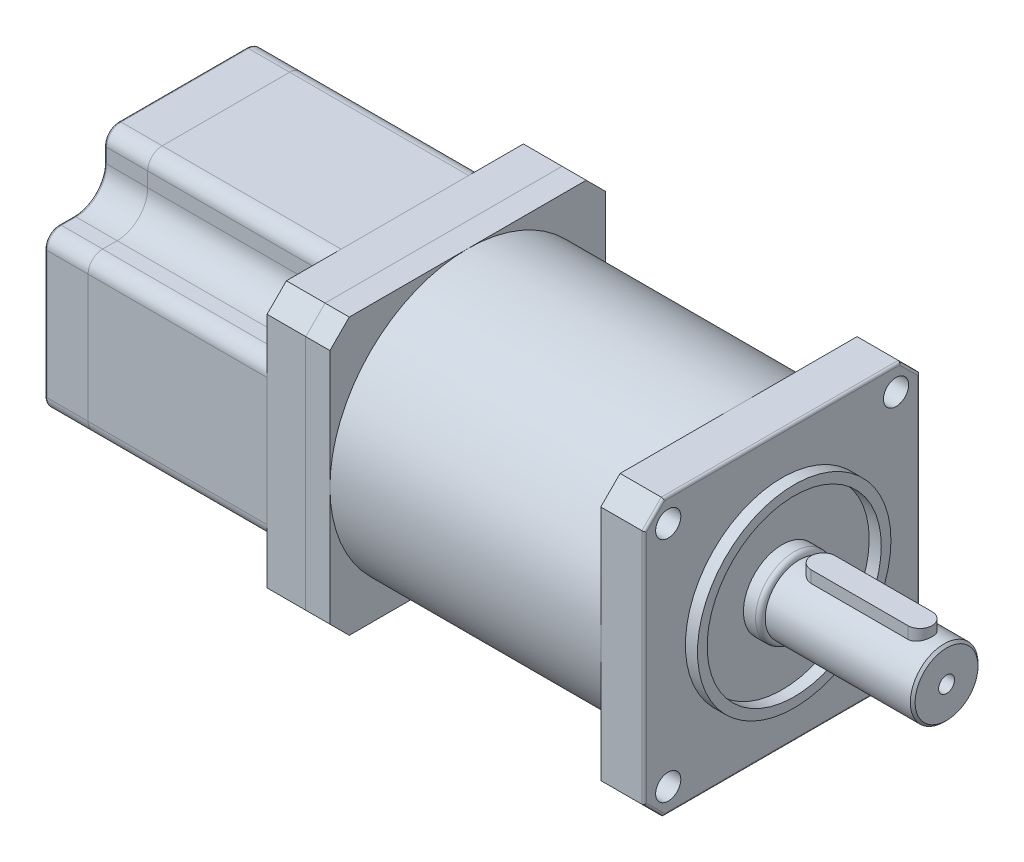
ISO-10303-21;
HEADER;
FILE_DESCRIPTION(('STEP AP214'),'2;1');
FILE_NAME('part.step','',(''),(''),'','','');
FILE_SCHEMA(('AUTOMOTIVE_DESIGN { 1 0 10303 214 1 1 1 1 }'));
ENDSEC;
DATA;
#1=APPLICATION_CONTEXT('core data for automotive mechanical design processes');
#2=APPLICATION_PROTOCOL_DEFINITION('international standard','automotive_design',2000,#1);
#3=PRODUCT_CONTEXT('',#1,'mechanical');
#4=PRODUCT('Part','Part','',(#3));
#5=PRODUCT_RELATED_PRODUCT_CATEGORY('part','',(#4));
#6=PRODUCT_DEFINITION_FORMATION('','',#4);
#7=PRODUCT_DEFINITION_CONTEXT('part definition',#1,'design');
#8=PRODUCT_DEFINITION('design','',#6,#7);
#9=PRODUCT_DEFINITION_SHAPE('','',#8);
#10=(LENGTH_UNIT() NAMED_UNIT(*) SI_UNIT(.MILLI.,.METRE.));
#11=(NAMED_UNIT(*) PLANE_ANGLE_UNIT() SI_UNIT($,.RADIAN.));
#12=(NAMED_UNIT(*) SI_UNIT($,.STERADIAN.) SOLID_ANGLE_UNIT());
#13=UNCERTAINTY_MEASURE_WITH_UNIT(LENGTH_MEASURE(1.E-05),#10,'distance_accuracy_value','');
#14=(GEOMETRIC_REPRESENTATION_CONTEXT(3) GLOBAL_UNCERTAINTY_ASSIGNED_CONTEXT((#13)) GLOBAL_UNIT_ASSIGNED_CONTEXT((#10,
#11,#12)) REPRESENTATION_CONTEXT('',''));
#15=CARTESIAN_POINT('',(0.,0.,0.));
#16=DIRECTION('',(0.,0.,1.));
#17=DIRECTION('',(1.,0.,0.));
#18=AXIS2_PLACEMENT_3D('',#15,#16,#17);
#19=CARTESIAN_POINT('',(28.5,9.,0.));
#20=DIRECTION('',(0.,-1.,0.));
#21=DIRECTION('',(0.,0.,-1.));
#22=AXIS2_PLACEMENT_3D('',#19,#20,#21);
#23=CYLINDRICAL_SURFACE('',#22,2.5);
#24=CARTESIAN_POINT('',(28.5,4.,0.));
#25=DIRECTION('',(0.,1.,0.));
#26=DIRECTION('',(0.,0.,1.));
#27=AXIS2_PLACEMENT_3D('',#24,#25,#26);
#28=CIRCLE('',#27,2.5);
#29=CARTESIAN_POINT('',(28.5,4.,2.5));
#30=VERTEX_POINT('',#29);
#31=CARTESIAN_POINT('',(28.5,4.,-2.5));
#32=VERTEX_POINT('',#31);
#33=EDGE_CURVE('E111',#30,#32,#28,.T.);
#34=ORIENTED_EDGE('',*,*,#33,.T.);
#35=DIRECTION('',(0.,-1.,0.));
#36=VECTOR('',#35,1.);
#37=CARTESIAN_POINT('',(28.5,9.,-2.5));
#38=LINE('',#37,#36);
#39=CARTESIAN_POINT('',(28.5,9.,-2.5));
#40=VERTEX_POINT('',#39);
#41=EDGE_CURVE('E12',#40,#32,#38,.T.);
#42=ORIENTED_EDGE('',*,*,#41,.F.);
#43=CARTESIAN_POINT('',(28.5,9.,0.));
#44=DIRECTION('',(0.,1.,0.));
#45=DIRECTION('',(0.,0.,1.));
#46=AXIS2_PLACEMENT_3D('',#43,#44,#45);
#47=CIRCLE('',#46,2.5);
#48=CARTESIAN_POINT('',(28.5,9.,2.5));
#49=VERTEX_POINT('',#48);
#50=EDGE_CURVE('E99',#49,#40,#47,.T.);
#51=ORIENTED_EDGE('',*,*,#50,.F.);
#52=DIRECTION('',(0.,-1.,0.));
#53=VECTOR('',#52,1.);
#54=CARTESIAN_POINT('',(28.5,9.,2.5));
#55=LINE('',#54,#53);
#56=EDGE_CURVE('E107',#49,#30,#55,.T.);
#57=ORIENTED_EDGE('',*,*,#56,.T.);
#58=EDGE_LOOP('',(#34,#42,#51,#57));
#59=FACE_BOUND('',#58,.T.);
#60=ADVANCED_FACE('F48',(#59),#23,.T.);
#61=CARTESIAN_POINT('',(28.5,9.,-2.5));
#62=DIRECTION('',(0.,0.,1.));
#63=DIRECTION('',(1.,0.,0.));
#64=AXIS2_PLACEMENT_3D('',#61,#62,#63);
#65=PLANE('',#64);
#66=DIRECTION('',(-1.,0.,0.));
#67=VECTOR('',#66,1.);
#68=CARTESIAN_POINT('',(28.5,4.,-2.5));
#69=LINE('',#68,#67);
#70=CARTESIAN_POINT('',(8.5,4.,-2.5));
#71=VERTEX_POINT('',#70);
#72=EDGE_CURVE('E103',#32,#71,#69,.T.);
#73=ORIENTED_EDGE('',*,*,#72,.T.);
#74=DIRECTION('',(0.,-1.,0.));
#75=VECTOR('',#74,1.);
#76=CARTESIAN_POINT('',(8.5,9.,-2.5));
#77=LINE('',#76,#75);
#78=CARTESIAN_POINT('',(8.5,9.,-2.5));
#79=VERTEX_POINT('',#78);
#80=EDGE_CURVE('E56',#79,#71,#77,.T.);
#81=ORIENTED_EDGE('',*,*,#80,.F.);
#82=DIRECTION('',(-1.,0.,0.));
#83=VECTOR('',#82,1.);
#84=CARTESIAN_POINT('',(28.5,9.,-2.5));
#85=LINE('',#84,#83);
#86=EDGE_CURVE('E94',#40,#79,#85,.T.);
#87=ORIENTED_EDGE('',*,*,#86,.F.);
#88=ORIENTED_EDGE('',*,*,#41,.T.);
#89=EDGE_LOOP('',(#73,#81,#87,#88));
#90=FACE_BOUND('',#89,.T.);
#91=ADVANCED_FACE('F102',(#90),#65,.F.);
#92=CARTESIAN_POINT('',(8.5,9.,0.));
#93=DIRECTION('',(0.,-1.,0.));
#94=DIRECTION('',(0.,0.,-1.));
#95=AXIS2_PLACEMENT_3D('',#92,#93,#94);
#96=CYLINDRICAL_SURFACE('',#95,2.5);
#97=CARTESIAN_POINT('',(8.5,4.,0.));
#98=DIRECTION('',(0.,1.,0.));
#99=DIRECTION('',(0.,0.,1.));
#100=AXIS2_PLACEMENT_3D('',#97,#98,#99);
#101=CIRCLE('',#100,2.5);
#102=CARTESIAN_POINT('',(8.5,4.,2.5));
#103=VERTEX_POINT('',#102);
#104=EDGE_CURVE('E81',#71,#103,#101,.T.);
#105=ORIENTED_EDGE('',*,*,#104,.T.);
#106=DIRECTION('',(0.,-1.,0.));
#107=VECTOR('',#106,1.);
#108=CARTESIAN_POINT('',(8.5,9.,2.5));
#109=LINE('',#108,#107);
#110=CARTESIAN_POINT('',(8.5,9.,2.5));
#111=VERTEX_POINT('',#110);
#112=EDGE_CURVE('E104',#111,#103,#109,.T.);
#113=ORIENTED_EDGE('',*,*,#112,.F.);
#114=CARTESIAN_POINT('',(8.5,9.,0.));
#115=DIRECTION('',(0.,1.,0.));
#116=DIRECTION('',(0.,0.,1.));
#117=AXIS2_PLACEMENT_3D('',#114,#115,#116);
#118=CIRCLE('',#117,2.5);
#119=EDGE_CURVE('E97',#79,#111,#118,.T.);
#120=ORIENTED_EDGE('',*,*,#119,.F.);
#121=ORIENTED_EDGE('',*,*,#80,.T.);
#122=EDGE_LOOP('',(#105,#113,#120,#121));
#123=FACE_BOUND('',#122,.T.);
#124=ADVANCED_FACE('F105',(#123),#96,.T.);
#125=CARTESIAN_POINT('',(8.5,9.,2.5));
#126=DIRECTION('',(0.,0.,-1.));
#127=DIRECTION('',(-1.,0.,0.));
#128=AXIS2_PLACEMENT_3D('',#125,#126,#127);
#129=PLANE('',#128);
#130=DIRECTION('',(1.,0.,0.));
#131=VECTOR('',#130,1.);
#132=CARTESIAN_POINT('',(8.5,4.,2.5));
#133=LINE('',#132,#131);
#134=EDGE_CURVE('E87',#103,#30,#133,.T.);
#135=ORIENTED_EDGE('',*,*,#134,.T.);
#136=ORIENTED_EDGE('',*,*,#56,.F.);
#137=DIRECTION('',(1.,0.,0.));
#138=VECTOR('',#137,1.);
#139=CARTESIAN_POINT('',(8.5,9.,2.5));
#140=LINE('',#139,#138);
#141=EDGE_CURVE('E64',#111,#49,#140,.T.);
#142=ORIENTED_EDGE('',*,*,#141,.F.);
#143=ORIENTED_EDGE('',*,*,#112,.T.);
#144=EDGE_LOOP('',(#135,#136,#142,#143));
#145=FACE_BOUND('',#144,.T.);
#146=ADVANCED_FACE('F118',(#145),#129,.F.);
#147=CARTESIAN_POINT('',(28.5,9.,0.));
#148=DIRECTION('',(0.,1.,0.));
#149=DIRECTION('',(0.,0.,1.));
#150=AXIS2_PLACEMENT_3D('',#147,#148,#149);
#151=PLANE('',#150);
#152=ORIENTED_EDGE('',*,*,#50,.T.);
#153=ORIENTED_EDGE('',*,*,#86,.T.);
#154=ORIENTED_EDGE('',*,*,#119,.T.);
#155=ORIENTED_EDGE('',*,*,#141,.T.);
#156=EDGE_LOOP('',(#152,#153,#154,#155));
#157=FACE_BOUND('',#156,.T.);
#158=ADVANCED_FACE('F95',(#157),#151,.T.);
#159=CARTESIAN_POINT('',(28.5,4.,0.));
#160=DIRECTION('',(0.,1.,0.));
#161=DIRECTION('',(0.,0.,1.));
#162=AXIS2_PLACEMENT_3D('',#159,#160,#161);
#163=PLANE('',#162);
#164=ORIENTED_EDGE('',*,*,#33,.F.);
#165=ORIENTED_EDGE('',*,*,#134,.F.);
#166=ORIENTED_EDGE('',*,*,#104,.F.);
#167=ORIENTED_EDGE('',*,*,#72,.F.);
#168=EDGE_LOOP('',(#164,#165,#166,#167));
#169=FACE_BOUND('',#168,.T.);
#170=ADVANCED_FACE('F121',(#169),#163,.F.);
#171=CLOSED_SHELL('',(#60,#91,#124,#146,#158,#170));
#172=MANIFOLD_SOLID_BREP('B2',#171);
#173=CARTESIAN_POINT('',(34.,0.,0.));
#174=DIRECTION('',(-1.,0.,0.));
#175=DIRECTION('',(0.,0.,1.));
#176=AXIS2_PLACEMENT_3D('',#173,#174,#175);
#177=CYLINDRICAL_SURFACE('',#176,7.);
#178=CARTESIAN_POINT('',(33.5,0.,0.));
#179=DIRECTION('',(1.,0.,0.));
#180=DIRECTION('',(0.,0.,-1.));
#181=AXIS2_PLACEMENT_3D('',#178,#179,#180);
#182=CIRCLE('',#181,7.);
#183=CARTESIAN_POINT('',(33.5,0.,-7.));
#184=VERTEX_POINT('',#183);
#185=EDGE_CURVE('E46',#184,#184,#182,.F.);
#186=ORIENTED_EDGE('',*,*,#185,.T.);
#187=EDGE_LOOP('',(#186));
#188=FACE_BOUND('',#187,.T.);
#189=DIRECTION('',(-1.,0.,0.));
#190=VECTOR('',#189,1.);
#191=CARTESIAN_POINT('',(34.,6.53834841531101,-2.5));
#192=LINE('',#191,#190);
#193=CARTESIAN_POINT('',(8.5,6.53834841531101,-2.5));
#194=VERTEX_POINT('',#193);
#195=CARTESIAN_POINT('',(28.5,6.53834841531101,-2.5));
#196=VERTEX_POINT('',#195);
#197=EDGE_CURVE('E205',#194,#196,#192,.F.);
#198=ORIENTED_EDGE('',*,*,#197,.T.);
#199=CARTESIAN_POINT('',(28.5,6.53834841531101,-2.5));
#200=CARTESIAN_POINT('',(28.5678892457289,6.53833653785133,-2.50000932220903));
#201=CARTESIAN_POINT('',(28.6357719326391,6.53940549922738,-2.49723485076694));
#202=CARTESIAN_POINT('',(28.7710039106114,6.54361657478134,-2.4861910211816));
#203=CARTESIAN_POINT('',(28.8383533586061,6.54675805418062,-2.47792334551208));
#204=CARTESIAN_POINT('',(28.9718214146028,6.55501217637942,-2.45600175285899));
#205=CARTESIAN_POINT('',(29.0379433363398,6.56011831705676,-2.44236559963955));
#206=CARTESIAN_POINT('',(29.1687018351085,6.57213177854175,-2.40985115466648));
#207=CARTESIAN_POINT('',(29.2333383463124,6.57903917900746,-2.39097263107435));
#208=CARTESIAN_POINT('',(29.4242643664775,6.6021493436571,-2.32673964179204));
#209=CARTESIAN_POINT('',(29.5477904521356,6.62075475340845,-2.27375112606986));
#210=CARTESIAN_POINT('',(29.784230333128,6.6622539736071,-2.14910757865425));
#211=CARTESIAN_POINT('',(29.8971363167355,6.68515090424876,-2.07743895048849));
#212=CARTESIAN_POINT('',(30.1142152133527,6.73379913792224,-1.91402571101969));
#213=CARTESIAN_POINT('',(30.2178464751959,6.75962864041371,-1.82158337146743));
#214=CARTESIAN_POINT('',(30.4085087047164,6.81057592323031,-1.6207338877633));
#215=CARTESIAN_POINT('',(30.4955365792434,6.83569357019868,-1.51232377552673));
#216=CARTESIAN_POINT('',(30.653089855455,6.88331133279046,-1.27853915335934));
#217=CARTESIAN_POINT('',(30.7230315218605,6.90570835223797,-1.15274833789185));
#218=CARTESIAN_POINT('',(30.8405366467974,6.94442357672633,-0.890250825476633));
#219=CARTESIAN_POINT('',(30.888107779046,6.96074386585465,-0.753547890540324));
#220=CARTESIAN_POINT('',(30.9576406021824,6.9849105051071,-0.478829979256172));
#221=CARTESIAN_POINT('',(30.9805391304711,6.99306594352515,-0.341079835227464));
#222=CARTESIAN_POINT('',(31.0030684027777,7.00108798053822,-0.0634643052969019));
#223=CARTESIAN_POINT('',(31.0027055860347,7.00095687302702,0.0764004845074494));
#224=CARTESIAN_POINT('',(30.9792887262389,6.99262258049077,0.347593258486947));
#225=CARTESIAN_POINT('',(30.9572552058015,6.98478243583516,0.479022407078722));
#226=CARTESIAN_POINT('',(30.8928265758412,6.96237832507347,0.736175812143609));
#227=CARTESIAN_POINT('',(30.8504303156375,6.94781397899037,0.861899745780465));
#228=CARTESIAN_POINT('',(30.7459530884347,6.91316506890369,1.10616102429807));
#229=CARTESIAN_POINT('',(30.6836042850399,6.89300592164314,1.22457279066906));
#230=CARTESIAN_POINT('',(30.5412206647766,6.8492335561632,1.44953531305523));
#231=CARTESIAN_POINT('',(30.4611804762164,6.82561928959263,1.5560824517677));
#232=CARTESIAN_POINT('',(30.2806767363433,6.7759054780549,1.7603244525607));
#233=CARTESIAN_POINT('',(30.1793502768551,6.74974055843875,1.85724185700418));
#234=CARTESIAN_POINT('',(29.9616726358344,6.69890342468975,2.03299914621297));
#235=CARTESIAN_POINT('',(29.8453160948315,6.67423174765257,2.11183255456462));
#236=CARTESIAN_POINT('',(29.598057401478,6.62877803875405,2.25049860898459));
#237=CARTESIAN_POINT('',(29.4669210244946,6.60807875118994,2.30994207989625));
#238=CARTESIAN_POINT('',(29.1956351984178,6.57388213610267,2.4055543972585));
#239=CARTESIAN_POINT('',(29.055500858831,6.56037307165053,2.44176119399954));
#240=CARTESIAN_POINT('',(28.8449694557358,6.54708542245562,2.47705497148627));
#241=CARTESIAN_POINT('',(28.7762636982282,6.54382010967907,2.48565347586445));
#242=CARTESIAN_POINT('',(28.6383848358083,6.53944910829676,2.49712352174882));
#243=CARTESIAN_POINT('',(28.5692123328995,6.53834103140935,2.50000139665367));
#244=CARTESIAN_POINT('',(28.5,6.53834841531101,2.5));
#245=B_SPLINE_CURVE_WITH_KNOTS('',3,(#199,#200,#201,#202,#203,#204,#205,#206,#207,#208,#209,
#210,#211,#212,#213,#214,#215,#216,#217,#218,#219,#220,#221,#222,#223,#224,#225,#226,#227,#228,
#229,#230,#231,#232,#233,#234,#235,#236,#237,#238,#239,#240,#241,#242,#243,#244),.UNSPECIFIED.,
.F.,.F.,(4,2,2,2,2,2,2,2,2,2,2,2,2,2,2,2,2,2,2,2,2,2,4),(0.,0.203591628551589,0.407120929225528,
0.609982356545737,0.812852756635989,1.21793118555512,1.6233052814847,2.0451597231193,
2.4670926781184,2.90188398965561,3.33652604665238,3.75400993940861,4.17137826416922,
4.56998920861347,4.96862268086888,5.37284909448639,5.77719841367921,6.20315837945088,
6.6292706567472,7.06347329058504,7.49696496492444,7.70468580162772,7.91217653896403),.UNSPECIFIED.);
#246=CARTESIAN_POINT('',(28.5,6.53834841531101,2.5));
#247=VERTEX_POINT('',#246);
#248=EDGE_CURVE('E263',#196,#247,#245,.T.);
#249=ORIENTED_EDGE('',*,*,#248,.T.);
#250=DIRECTION('',(-1.,0.,0.));
#251=VECTOR('',#250,1.);
#252=CARTESIAN_POINT('',(34.,6.53834841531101,2.5));
#253=LINE('',#252,#251);
#254=CARTESIAN_POINT('',(8.5,6.53834841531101,2.5));
#255=VERTEX_POINT('',#254);
#256=EDGE_CURVE('E310',#247,#255,#253,.T.);
#257=ORIENTED_EDGE('',*,*,#256,.T.);
#258=CARTESIAN_POINT('',(8.5,6.53834841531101,2.5));
#259=CARTESIAN_POINT('',(8.43211075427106,6.53833653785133,2.50000932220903));
#260=CARTESIAN_POINT('',(8.36422806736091,6.53940549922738,2.49723485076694));
#261=CARTESIAN_POINT('',(8.22899608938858,6.54361657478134,2.4861910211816));
#262=CARTESIAN_POINT('',(8.16164664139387,6.54675805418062,2.47792334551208));
#263=CARTESIAN_POINT('',(8.02817858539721,6.55501217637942,2.456001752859));
#264=CARTESIAN_POINT('',(7.96205666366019,6.56011831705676,2.44236559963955));
#265=CARTESIAN_POINT('',(7.83129816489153,6.57213177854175,2.40985115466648));
#266=CARTESIAN_POINT('',(7.76666165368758,6.57903917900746,2.39097263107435));
#267=CARTESIAN_POINT('',(7.57573563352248,6.6021493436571,2.32673964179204));
#268=CARTESIAN_POINT('',(7.45220954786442,6.62075475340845,2.27375112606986));
#269=CARTESIAN_POINT('',(7.21576966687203,6.6622539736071,2.14910757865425));
#270=CARTESIAN_POINT('',(7.10286368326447,6.68515090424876,2.07743895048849));
#271=CARTESIAN_POINT('',(6.88578478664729,6.73379913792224,1.9140257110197));
#272=CARTESIAN_POINT('',(6.78215352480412,6.75962864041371,1.82158337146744));
#273=CARTESIAN_POINT('',(6.59149129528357,6.81057592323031,1.6207338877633));
#274=CARTESIAN_POINT('',(6.50446342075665,6.83569357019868,1.51232377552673));
#275=CARTESIAN_POINT('',(6.34691014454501,6.88331133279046,1.27853915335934));
#276=CARTESIAN_POINT('',(6.27696847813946,6.90570835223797,1.15274833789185));
#277=CARTESIAN_POINT('',(6.15946335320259,6.94442357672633,0.890250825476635));
#278=CARTESIAN_POINT('',(6.11189222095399,6.96074386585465,0.753547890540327));
#279=CARTESIAN_POINT('',(6.04235939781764,6.9849105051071,0.478829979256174));
#280=CARTESIAN_POINT('',(6.01946086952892,6.99306594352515,0.341079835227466));
#281=CARTESIAN_POINT('',(5.99693159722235,7.00108798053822,0.0634643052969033));
#282=CARTESIAN_POINT('',(5.99729441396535,7.00095687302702,-0.0764004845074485));
#283=CARTESIAN_POINT('',(6.02071127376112,6.99262258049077,-0.347593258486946));
#284=CARTESIAN_POINT('',(6.04274479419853,6.98478243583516,-0.479022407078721));
#285=CARTESIAN_POINT('',(6.1071734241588,6.96237832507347,-0.736175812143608));
#286=CARTESIAN_POINT('',(6.14956968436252,6.94781397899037,-0.861899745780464));
#287=CARTESIAN_POINT('',(6.25404691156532,6.91316506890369,-1.10616102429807));
#288=CARTESIAN_POINT('',(6.31639571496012,6.89300592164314,-1.22457279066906));
#289=CARTESIAN_POINT('',(6.45877933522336,6.8492335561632,-1.44953531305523));
#290=CARTESIAN_POINT('',(6.53881952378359,6.82561928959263,-1.5560824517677));
#291=CARTESIAN_POINT('',(6.7193232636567,6.7759054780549,-1.7603244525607));
#292=CARTESIAN_POINT('',(6.8206497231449,6.74974055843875,-1.85724185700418));
#293=CARTESIAN_POINT('',(7.03832736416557,6.69890342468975,-2.03299914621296));
#294=CARTESIAN_POINT('',(7.15468390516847,6.67423174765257,-2.11183255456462));
#295=CARTESIAN_POINT('',(7.40194259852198,6.62877803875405,-2.25049860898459));
#296=CARTESIAN_POINT('',(7.53307897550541,6.60807875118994,-2.30994207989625));
#297=CARTESIAN_POINT('',(7.80436480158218,6.57388213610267,-2.4055543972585));
#298=CARTESIAN_POINT('',(7.94449914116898,6.56037307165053,-2.44176119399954));
#299=CARTESIAN_POINT('',(8.15503054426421,6.54708542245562,-2.47705497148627));
#300=CARTESIAN_POINT('',(8.22373630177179,6.54382010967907,-2.48565347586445));
#301=CARTESIAN_POINT('',(8.36161516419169,6.53944910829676,-2.49712352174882));
#302=CARTESIAN_POINT('',(8.43078766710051,6.53834103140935,-2.50000139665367));
#303=CARTESIAN_POINT('',(8.5,6.53834841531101,-2.5));
#304=B_SPLINE_CURVE_WITH_KNOTS('',3,(#258,#259,#260,#261,#262,#263,#264,#265,#266,#267,#268,
#269,#270,#271,#272,#273,#274,#275,#276,#277,#278,#279,#280,#281,#282,#283,#284,#285,#286,#287,
#288,#289,#290,#291,#292,#293,#294,#295,#296,#297,#298,#299,#300,#301,#302,#303),.UNSPECIFIED.,
.F.,.F.,(4,2,2,2,2,2,2,2,2,2,2,2,2,2,2,2,2,2,2,2,2,2,4),(0.,0.203591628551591,0.40712092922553,
0.609982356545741,0.812852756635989,1.21793118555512,1.6233052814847,2.0451597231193,
2.4670926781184,2.90188398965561,3.33652604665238,3.75400993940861,4.17137826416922,
4.56998920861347,4.96862268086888,5.37284909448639,5.77719841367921,6.20315837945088,
6.62927065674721,7.06347329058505,7.49696496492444,7.70468580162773,7.91217653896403),.UNSPECIFIED.);
#305=EDGE_CURVE('E197',#255,#194,#304,.T.);
#306=ORIENTED_EDGE('',*,*,#305,.T.);
#307=EDGE_LOOP('',(#198,#249,#257,#306));
#308=FACE_BOUND('',#307,.T.);
#309=CARTESIAN_POINT('',(3.5,0.,0.));
#310=DIRECTION('',(1.,0.,0.));
#311=DIRECTION('',(0.,0.,-1.));
#312=AXIS2_PLACEMENT_3D('',#309,#310,#311);
#313=CIRCLE('',#312,7.);
#314=CARTESIAN_POINT('',(3.5,0.,-7.));
#315=VERTEX_POINT('',#314);
#316=EDGE_CURVE('E254',#315,#315,#313,.T.);
#317=ORIENTED_EDGE('',*,*,#316,.T.);
#318=EDGE_LOOP('',(#317));
#319=FACE_BOUND('',#318,.T.);
#320=ADVANCED_FACE('F182',(#188,#308,#319),#177,.T.);
#321=CARTESIAN_POINT('',(34.,0.,0.));
#322=DIRECTION('',(1.,0.,0.));
#323=DIRECTION('',(0.,0.,-1.));
#324=AXIS2_PLACEMENT_3D('',#321,#322,#323);
#325=PLANE('',#324);
#326=CARTESIAN_POINT('',(34.,0.,0.));
#327=DIRECTION('',(1.,0.,0.));
#328=DIRECTION('',(0.,0.,-1.));
#329=AXIS2_PLACEMENT_3D('',#326,#327,#328);
#330=CIRCLE('',#329,1.64999999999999);
#331=CARTESIAN_POINT('',(34.,0.,-1.64999999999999));
#332=VERTEX_POINT('',#331);
#333=EDGE_CURVE('E235',#332,#332,#330,.T.);
#334=ORIENTED_EDGE('',*,*,#333,.F.);
#335=EDGE_LOOP('',(#334));
#336=FACE_BOUND('',#335,.T.);
#337=CARTESIAN_POINT('',(34.,0.,0.));
#338=DIRECTION('',(1.,0.,0.));
#339=DIRECTION('',(0.,0.,-1.));
#340=AXIS2_PLACEMENT_3D('',#337,#338,#339);
#341=CIRCLE('',#340,6.50000000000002);
#342=CARTESIAN_POINT('',(34.,0.,-6.50000000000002));
#343=VERTEX_POINT('',#342);
#344=EDGE_CURVE('E190',#343,#343,#341,.T.);
#345=ORIENTED_EDGE('',*,*,#344,.T.);
#346=EDGE_LOOP('',(#345));
#347=FACE_BOUND('',#346,.T.);
#348=ADVANCED_FACE('F294',(#336,#347),#325,.T.);
#349=CARTESIAN_POINT('',(3.5,0.,0.));
#350=DIRECTION('',(1.,0.,0.));
#351=DIRECTION('',(0.,0.,-1.));
#352=AXIS2_PLACEMENT_3D('',#349,#350,#351);
#353=PLANE('',#352);
#354=ORIENTED_EDGE('',*,*,#316,.F.);
#355=EDGE_LOOP('',(#354));
#356=FACE_BOUND('',#355,.T.);
#357=ADVANCED_FACE('F293',(#356),#353,.F.);
#358=CARTESIAN_POINT('',(8.5,4.,0.));
#359=DIRECTION('',(0.,1.,0.));
#360=DIRECTION('',(0.,0.,1.));
#361=AXIS2_PLACEMENT_3D('',#358,#359,#360);
#362=CYLINDRICAL_SURFACE('',#361,2.5);
#363=DIRECTION('',(0.,1.,0.));
#364=VECTOR('',#363,1.);
#365=CARTESIAN_POINT('',(8.5,4.,2.5));
#366=LINE('',#365,#364);
#367=CARTESIAN_POINT('',(8.5,4.,2.5));
#368=VERTEX_POINT('',#367);
#369=EDGE_CURVE('E251',#368,#255,#366,.T.);
#370=ORIENTED_EDGE('',*,*,#369,.F.);
#371=CARTESIAN_POINT('',(8.5,4.,0.));
#372=DIRECTION('',(0.,1.,0.));
#373=DIRECTION('',(0.,0.,1.));
#374=AXIS2_PLACEMENT_3D('',#371,#372,#373);
#375=CIRCLE('',#374,2.5);
#376=CARTESIAN_POINT('',(8.5,4.,-2.5));
#377=VERTEX_POINT('',#376);
#378=EDGE_CURVE('E234',#377,#368,#375,.T.);
#379=ORIENTED_EDGE('',*,*,#378,.F.);
#380=DIRECTION('',(0.,1.,0.));
#381=VECTOR('',#380,1.);
#382=CARTESIAN_POINT('',(8.5,4.,-2.5));
#383=LINE('',#382,#381);
#384=EDGE_CURVE('E252',#377,#194,#383,.T.);
#385=ORIENTED_EDGE('',*,*,#384,.T.);
#386=ORIENTED_EDGE('',*,*,#305,.F.);
#387=EDGE_LOOP('',(#370,#379,#385,#386));
#388=FACE_BOUND('',#387,.T.);
#389=ADVANCED_FACE('F289',(#388),#362,.F.);
#390=CARTESIAN_POINT('',(8.5,4.,-2.5));
#391=DIRECTION('',(0.,0.,-1.));
#392=DIRECTION('',(-1.,0.,0.));
#393=AXIS2_PLACEMENT_3D('',#390,#391,#392);
#394=PLANE('',#393);
#395=ORIENTED_EDGE('',*,*,#384,.F.);
#396=DIRECTION('',(-1.,0.,0.));
#397=VECTOR('',#396,1.);
#398=CARTESIAN_POINT('',(8.5,4.,-2.5));
#399=LINE('',#398,#397);
#400=CARTESIAN_POINT('',(28.5,4.,-2.5));
#401=VERTEX_POINT('',#400);
#402=EDGE_CURVE('E248',#401,#377,#399,.T.);
#403=ORIENTED_EDGE('',*,*,#402,.F.);
#404=DIRECTION('',(0.,1.,0.));
#405=VECTOR('',#404,1.);
#406=CARTESIAN_POINT('',(28.5,4.,-2.5));
#407=LINE('',#406,#405);
#408=EDGE_CURVE('E255',#401,#196,#407,.T.);
#409=ORIENTED_EDGE('',*,*,#408,.T.);
#410=ORIENTED_EDGE('',*,*,#197,.F.);
#411=EDGE_LOOP('',(#395,#403,#409,#410));
#412=FACE_BOUND('',#411,.T.);
#413=ADVANCED_FACE('F283',(#412),#394,.F.);
#414=CARTESIAN_POINT('',(28.5,4.,0.));
#415=DIRECTION('',(0.,1.,0.));
#416=DIRECTION('',(0.,0.,1.));
#417=AXIS2_PLACEMENT_3D('',#414,#415,#416);
#418=CYLINDRICAL_SURFACE('',#417,2.5);
#419=ORIENTED_EDGE('',*,*,#408,.F.);
#420=CARTESIAN_POINT('',(28.5,4.,0.));
#421=DIRECTION('',(0.,1.,0.));
#422=DIRECTION('',(0.,0.,1.));
#423=AXIS2_PLACEMENT_3D('',#420,#421,#422);
#424=CIRCLE('',#423,2.5);
#425=CARTESIAN_POINT('',(28.5,4.,2.5));
#426=VERTEX_POINT('',#425);
#427=EDGE_CURVE('E245',#426,#401,#424,.T.);
#428=ORIENTED_EDGE('',*,*,#427,.F.);
#429=DIRECTION('',(0.,1.,0.));
#430=VECTOR('',#429,1.);
#431=CARTESIAN_POINT('',(28.5,4.,2.5));
#432=LINE('',#431,#430);
#433=EDGE_CURVE('E257',#426,#247,#432,.T.);
#434=ORIENTED_EDGE('',*,*,#433,.T.);
#435=ORIENTED_EDGE('',*,*,#248,.F.);
#436=EDGE_LOOP('',(#419,#428,#434,#435));
#437=FACE_BOUND('',#436,.T.);
#438=ADVANCED_FACE('F277',(#437),#418,.F.);
#439=CARTESIAN_POINT('',(28.5,4.,2.5));
#440=DIRECTION('',(0.,0.,1.));
#441=DIRECTION('',(1.,0.,0.));
#442=AXIS2_PLACEMENT_3D('',#439,#440,#441);
#443=PLANE('',#442);
#444=ORIENTED_EDGE('',*,*,#433,.F.);
#445=DIRECTION('',(1.,0.,0.));
#446=VECTOR('',#445,1.);
#447=CARTESIAN_POINT('',(28.5,4.,2.5));
#448=LINE('',#447,#446);
#449=EDGE_CURVE('E238',#368,#426,#448,.T.);
#450=ORIENTED_EDGE('',*,*,#449,.F.);
#451=ORIENTED_EDGE('',*,*,#369,.T.);
#452=ORIENTED_EDGE('',*,*,#256,.F.);
#453=EDGE_LOOP('',(#444,#450,#451,#452));
#454=FACE_BOUND('',#453,.T.);
#455=ADVANCED_FACE('F282',(#454),#443,.F.);
#456=CARTESIAN_POINT('',(8.5,4.,0.));
#457=DIRECTION('',(0.,1.,0.));
#458=DIRECTION('',(0.,0.,1.));
#459=AXIS2_PLACEMENT_3D('',#456,#457,#458);
#460=PLANE('',#459);
#461=ORIENTED_EDGE('',*,*,#378,.T.);
#462=ORIENTED_EDGE('',*,*,#449,.T.);
#463=ORIENTED_EDGE('',*,*,#427,.T.);
#464=ORIENTED_EDGE('',*,*,#402,.T.);
#465=EDGE_LOOP('',(#461,#462,#463,#464));
#466=FACE_BOUND('',#465,.T.);
#467=ADVANCED_FACE('F287',(#466),#460,.T.);
#468=CARTESIAN_POINT('',(34.,0.,0.));
#469=DIRECTION('',(-1.,0.,0.));
#470=DIRECTION('',(0.,0.,1.));
#471=AXIS2_PLACEMENT_3D('',#468,#469,#470);
#472=CONICAL_SURFACE('',#471,6.50000000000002,0.785398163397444);
#473=ORIENTED_EDGE('',*,*,#185,.F.);
#474=EDGE_LOOP('',(#473));
#475=FACE_BOUND('',#474,.T.);
#476=ORIENTED_EDGE('',*,*,#344,.F.);
#477=EDGE_LOOP('',(#476));
#478=FACE_BOUND('',#477,.T.);
#479=ADVANCED_FACE('F184',(#475,#478),#472,.T.);
#480=CARTESIAN_POINT('',(24.5,0.,0.));
#481=DIRECTION('',(1.,0.,0.));
#482=DIRECTION('',(0.,0.,-1.));
#483=AXIS2_PLACEMENT_3D('',#480,#481,#482);
#484=CONICAL_SURFACE('',#483,1.65,1.02974425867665);
#485=CARTESIAN_POINT('',(23.5085799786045,0.,0.));
#486=VERTEX_POINT('',#485);
#487=VERTEX_LOOP('',#486);
#488=FACE_BOUND('',#487,.T.);
#489=CARTESIAN_POINT('',(24.5,0.,0.));
#490=DIRECTION('',(1.,0.,0.));
#491=DIRECTION('',(0.,0.,-1.));
#492=AXIS2_PLACEMENT_3D('',#489,#490,#491);
#493=CIRCLE('',#492,1.65);
#494=CARTESIAN_POINT('',(24.5,0.,-1.65));
#495=VERTEX_POINT('',#494);
#496=EDGE_CURVE('E232',#495,#495,#493,.T.);
#497=ORIENTED_EDGE('',*,*,#496,.T.);
#498=EDGE_LOOP('',(#497));
#499=FACE_BOUND('',#498,.T.);
#500=ADVANCED_FACE('F225',(#488,#499),#484,.F.);
#501=CARTESIAN_POINT('',(34.,0.,0.));
#502=DIRECTION('',(1.,0.,0.));
#503=DIRECTION('',(0.,0.,-1.));
#504=AXIS2_PLACEMENT_3D('',#501,#502,#503);
#505=CYLINDRICAL_SURFACE('',#504,1.64999999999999);
#506=ORIENTED_EDGE('',*,*,#496,.F.);
#507=EDGE_LOOP('',(#506));
#508=FACE_BOUND('',#507,.T.);
#509=ORIENTED_EDGE('',*,*,#333,.T.);
#510=EDGE_LOOP('',(#509));
#511=FACE_BOUND('',#510,.T.);
#512=ADVANCED_FACE('F228',(#508,#511),#505,.F.);
#513=CLOSED_SHELL('',(#320,#348,#357,#389,#413,#438,#455,#467,#479,#500,#512));
#514=MANIFOLD_SOLID_BREP('B6',#513);
#515=CARTESIAN_POINT('',(-124.,-24.5,-28.5));
#516=DIRECTION('',(0.,0.,1.));
#517=DIRECTION('',(1.,0.,0.));
#518=AXIS2_PLACEMENT_3D('',#515,#516,#517);
#519=PLANE('',#518);
#520=DIRECTION('',(-1.,0.,0.));
#521=VECTOR('',#520,1.);
#522=CARTESIAN_POINT('',(-78.,-13.1754446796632,-28.5));
#523=LINE('',#522,#521);
#524=CARTESIAN_POINT('',(-115.,-13.1754446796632,-28.5));
#525=VERTEX_POINT('',#524);
#526=CARTESIAN_POINT('',(-123.5,-13.1754446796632,-28.5));
#527=VERTEX_POINT('',#526);
#528=EDGE_CURVE('E908',#525,#527,#523,.T.);
#529=ORIENTED_EDGE('',*,*,#528,.T.);
#530=DIRECTION('',(0.,-1.,0.));
#531=VECTOR('',#530,1.);
#532=CARTESIAN_POINT('',(-123.5,13.1754446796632,-28.5));
#533=LINE('',#532,#531);
#534=CARTESIAN_POINT('',(-123.5,13.1754446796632,-28.5));
#535=VERTEX_POINT('',#534);
#536=EDGE_CURVE('E807',#527,#535,#533,.F.);
#537=ORIENTED_EDGE('',*,*,#536,.T.);
#538=DIRECTION('',(-1.,0.,0.));
#539=VECTOR('',#538,1.);
#540=CARTESIAN_POINT('',(-78.,13.1754446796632,-28.5));
#541=LINE('',#540,#539);
#542=CARTESIAN_POINT('',(-115.,13.1754446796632,-28.5));
#543=VERTEX_POINT('',#542);
#544=EDGE_CURVE('E980',#543,#535,#541,.T.);
#545=ORIENTED_EDGE('',*,*,#544,.F.);
#546=DIRECTION('',(0.,-1.,0.));
#547=VECTOR('',#546,1.);
#548=CARTESIAN_POINT('',(-115.,-24.5,-28.5));
#549=LINE('',#548,#547);
#550=EDGE_CURVE('E950',#543,#525,#549,.T.);
#551=ORIENTED_EDGE('',*,*,#550,.T.);
#552=EDGE_LOOP('',(#529,#537,#545,#551));
#553=FACE_BOUND('',#552,.T.);
#554=ADVANCED_FACE('F409',(#553),#519,.F.);
#555=CARTESIAN_POINT('',(-124.,-28.5,-24.5));
#556=DIRECTION('',(0.,1.,0.));
#557=DIRECTION('',(0.,0.,1.));
#558=AXIS2_PLACEMENT_3D('',#555,#556,#557);
#559=PLANE('',#558);
#560=DIRECTION('',(-1.,0.,0.));
#561=VECTOR('',#560,1.);
#562=CARTESIAN_POINT('',(-78.,-28.5,13.1754446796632));
#563=LINE('',#562,#561);
#564=CARTESIAN_POINT('',(-115.,-28.5,13.1754446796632));
#565=VERTEX_POINT('',#564);
#566=CARTESIAN_POINT('',(-123.5,-28.5,13.1754446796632));
#567=VERTEX_POINT('',#566);
#568=EDGE_CURVE('E902',#565,#567,#563,.T.);
#569=ORIENTED_EDGE('',*,*,#568,.T.);
#570=DIRECTION('',(0.,0.,1.));
#571=VECTOR('',#570,1.);
#572=CARTESIAN_POINT('',(-123.5,-28.5,-13.1754446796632));
#573=LINE('',#572,#571);
#574=CARTESIAN_POINT('',(-123.5,-28.5,-13.1754446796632));
#575=VERTEX_POINT('',#574);
#576=EDGE_CURVE('E795',#567,#575,#573,.F.);
#577=ORIENTED_EDGE('',*,*,#576,.T.);
#578=DIRECTION('',(-1.,0.,0.));
#579=VECTOR('',#578,1.);
#580=CARTESIAN_POINT('',(-78.,-28.5,-13.1754446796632));
#581=LINE('',#580,#579);
#582=CARTESIAN_POINT('',(-115.,-28.5,-13.1754446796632));
#583=VERTEX_POINT('',#582);
#584=EDGE_CURVE('E900',#583,#575,#581,.T.);
#585=ORIENTED_EDGE('',*,*,#584,.F.);
#586=DIRECTION('',(0.,0.,1.));
#587=VECTOR('',#586,1.);
#588=CARTESIAN_POINT('',(-115.,-28.5,-24.5));
#589=LINE('',#588,#587);
#590=EDGE_CURVE('E953',#583,#565,#589,.T.);
#591=ORIENTED_EDGE('',*,*,#590,.T.);
#592=EDGE_LOOP('',(#569,#577,#585,#591));
#593=FACE_BOUND('',#592,.T.);
#594=ADVANCED_FACE('F898',(#593),#559,.F.);
#595=CARTESIAN_POINT('',(-124.,-24.5,28.5));
#596=DIRECTION('',(0.,0.,-1.));
#597=DIRECTION('',(0.,1.,0.));
#598=AXIS2_PLACEMENT_3D('',#595,#596,#597);
#599=PLANE('',#598);
#600=DIRECTION('',(-1.,0.,0.));
#601=VECTOR('',#600,1.);
#602=CARTESIAN_POINT('',(-78.,13.1754446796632,28.5));
#603=LINE('',#602,#601);
#604=CARTESIAN_POINT('',(-115.,13.1754446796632,28.5));
#605=VERTEX_POINT('',#604);
#606=CARTESIAN_POINT('',(-123.5,13.1754446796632,28.5));
#607=VERTEX_POINT('',#606);
#608=EDGE_CURVE('E946',#605,#607,#603,.T.);
#609=ORIENTED_EDGE('',*,*,#608,.T.);
#610=DIRECTION('',(0.,1.,0.));
#611=VECTOR('',#610,1.);
#612=CARTESIAN_POINT('',(-123.5,-13.1754446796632,28.5));
#613=LINE('',#612,#611);
#614=CARTESIAN_POINT('',(-123.5,-13.1754446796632,28.5));
#615=VERTEX_POINT('',#614);
#616=EDGE_CURVE('E783',#607,#615,#613,.F.);
#617=ORIENTED_EDGE('',*,*,#616,.T.);
#618=DIRECTION('',(-1.,0.,0.));
#619=VECTOR('',#618,1.);
#620=CARTESIAN_POINT('',(-78.,-13.1754446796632,28.5));
#621=LINE('',#620,#619);
#622=CARTESIAN_POINT('',(-115.,-13.1754446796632,28.5));
#623=VERTEX_POINT('',#622);
#624=EDGE_CURVE('E928',#623,#615,#621,.T.);
#625=ORIENTED_EDGE('',*,*,#624,.F.);
#626=DIRECTION('',(0.,1.,0.));
#627=VECTOR('',#626,1.);
#628=CARTESIAN_POINT('',(-115.,-24.5,28.5));
#629=LINE('',#628,#627);
#630=EDGE_CURVE('E956',#623,#605,#629,.T.);
#631=ORIENTED_EDGE('',*,*,#630,.T.);
#632=EDGE_LOOP('',(#609,#617,#625,#631));
#633=FACE_BOUND('',#632,.T.);
#634=ADVANCED_FACE('F1094',(#633),#599,.F.);
#635=CARTESIAN_POINT('',(-124.,28.5,-24.5));
#636=DIRECTION('',(0.,-1.,0.));
#637=DIRECTION('',(0.,0.,-1.));
#638=AXIS2_PLACEMENT_3D('',#635,#636,#637);
#639=PLANE('',#638);
#640=DIRECTION('',(-1.,0.,0.));
#641=VECTOR('',#640,1.);
#642=CARTESIAN_POINT('',(-78.,28.5,-13.1754446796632));
#643=LINE('',#642,#641);
#644=CARTESIAN_POINT('',(-115.,28.5,-13.1754446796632));
#645=VERTEX_POINT('',#644);
#646=CARTESIAN_POINT('',(-123.5,28.5,-13.1754446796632));
#647=VERTEX_POINT('',#646);
#648=EDGE_CURVE('E965',#645,#647,#643,.T.);
#649=ORIENTED_EDGE('',*,*,#648,.T.);
#650=DIRECTION('',(0.,0.,-1.));
#651=VECTOR('',#650,1.);
#652=CARTESIAN_POINT('',(-123.5,28.5,13.1754446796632));
#653=LINE('',#652,#651);
#654=CARTESIAN_POINT('',(-123.5,28.5,13.1754446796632));
#655=VERTEX_POINT('',#654);
#656=EDGE_CURVE('E771',#647,#655,#653,.F.);
#657=ORIENTED_EDGE('',*,*,#656,.T.);
#658=DIRECTION('',(-1.,0.,0.));
#659=VECTOR('',#658,1.);
#660=CARTESIAN_POINT('',(-78.,28.5,13.1754446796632));
#661=LINE('',#660,#659);
#662=CARTESIAN_POINT('',(-115.,28.5,13.1754446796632));
#663=VERTEX_POINT('',#662);
#664=EDGE_CURVE('E943',#663,#655,#661,.T.);
#665=ORIENTED_EDGE('',*,*,#664,.F.);
#666=DIRECTION('',(0.,0.,-1.));
#667=VECTOR('',#666,1.);
#668=CARTESIAN_POINT('',(-115.,28.5,-24.5));
#669=LINE('',#668,#667);
#670=EDGE_CURVE('E657',#663,#645,#669,.T.);
#671=ORIENTED_EDGE('',*,*,#670,.T.);
#672=EDGE_LOOP('',(#649,#657,#665,#671));
#673=FACE_BOUND('',#672,.T.);
#674=ADVANCED_FACE('F964',(#673),#639,.F.);
#675=CARTESIAN_POINT('',(-124.,0.,0.));
#676=DIRECTION('',(-1.,0.,0.));
#677=DIRECTION('',(0.,0.,1.));
#678=AXIS2_PLACEMENT_3D('',#675,#676,#677);
#679=PLANE('',#678);
#680=CARTESIAN_POINT('',(-124.,25.5,13.1754446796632));
#681=DIRECTION('',(-1.,0.,0.));
#682=DIRECTION('',(0.,0.,1.));
#683=AXIS2_PLACEMENT_3D('',#680,#681,#682);
#684=CIRCLE('',#683,2.5);
#685=CARTESIAN_POINT('',(-124.,25.5,15.6754446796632));
#686=VERTEX_POINT('',#685);
#687=CARTESIAN_POINT('',(-124.,28.,13.1754446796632));
#688=VERTEX_POINT('',#687);
#689=EDGE_CURVE('E766',#686,#688,#684,.T.);
#690=ORIENTED_EDGE('',*,*,#689,.T.);
#691=DIRECTION('',(0.,0.,-1.));
#692=VECTOR('',#691,1.);
#693=CARTESIAN_POINT('',(-124.,28.,-13.1754446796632));
#694=LINE('',#693,#692);
#695=CARTESIAN_POINT('',(-124.,28.,-13.1754446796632));
#696=VERTEX_POINT('',#695);
#697=EDGE_CURVE('E768',#688,#696,#694,.T.);
#698=ORIENTED_EDGE('',*,*,#697,.T.);
#699=CARTESIAN_POINT('',(-124.,25.5,-13.1754446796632));
#700=DIRECTION('',(-1.,0.,0.));
#701=DIRECTION('',(0.,0.,1.));
#702=AXIS2_PLACEMENT_3D('',#699,#700,#701);
#703=CIRCLE('',#702,2.5);
#704=CARTESIAN_POINT('',(-124.,25.5,-15.6754446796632));
#705=VERTEX_POINT('',#704);
#706=EDGE_CURVE('E722',#696,#705,#703,.T.);
#707=ORIENTED_EDGE('',*,*,#706,.T.);
#708=DIRECTION('',(0.,1.,0.));
#709=VECTOR('',#708,1.);
#710=CARTESIAN_POINT('',(-124.,22.5,-15.6754446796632));
#711=LINE('',#710,#709);
#712=CARTESIAN_POINT('',(-124.,22.5,-15.6754446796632));
#713=VERTEX_POINT('',#712);
#714=EDGE_CURVE('E724',#705,#713,#711,.F.);
#715=ORIENTED_EDGE('',*,*,#714,.T.);
#716=CARTESIAN_POINT('',(-124.,22.5,-22.5));
#717=DIRECTION('',(-1.,0.,0.));
#718=DIRECTION('',(0.,0.,1.));
#719=AXIS2_PLACEMENT_3D('',#716,#717,#718);
#720=CIRCLE('',#719,6.82455532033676);
#721=CARTESIAN_POINT('',(-124.,15.6754446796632,-22.5));
#722=VERTEX_POINT('',#721);
#723=EDGE_CURVE('E726',#713,#722,#720,.F.);
#724=ORIENTED_EDGE('',*,*,#723,.T.);
#725=DIRECTION('',(0.,0.,1.));
#726=VECTOR('',#725,1.);
#727=CARTESIAN_POINT('',(-124.,15.6754446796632,-25.5));
#728=LINE('',#727,#726);
#729=CARTESIAN_POINT('',(-124.,15.6754446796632,-25.5));
#730=VERTEX_POINT('',#729);
#731=EDGE_CURVE('E728',#722,#730,#728,.F.);
#732=ORIENTED_EDGE('',*,*,#731,.T.);
#733=CARTESIAN_POINT('',(-124.,13.1754446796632,-25.5));
#734=DIRECTION('',(-1.,0.,0.));
#735=DIRECTION('',(0.,0.,1.));
#736=AXIS2_PLACEMENT_3D('',#733,#734,#735);
#737=CIRCLE('',#736,2.5);
#738=CARTESIAN_POINT('',(-124.,13.1754446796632,-28.));
#739=VERTEX_POINT('',#738);
#740=EDGE_CURVE('E730',#730,#739,#737,.T.);
#741=ORIENTED_EDGE('',*,*,#740,.T.);
#742=DIRECTION('',(0.,-1.,0.));
#743=VECTOR('',#742,1.);
#744=CARTESIAN_POINT('',(-124.,-13.1754446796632,-28.));
#745=LINE('',#744,#743);
#746=CARTESIAN_POINT('',(-124.,-13.1754446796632,-28.));
#747=VERTEX_POINT('',#746);
#748=EDGE_CURVE('E732',#739,#747,#745,.T.);
#749=ORIENTED_EDGE('',*,*,#748,.T.);
#750=CARTESIAN_POINT('',(-124.,-13.1754446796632,-25.5));
#751=DIRECTION('',(-1.,0.,0.));
#752=DIRECTION('',(0.,0.,1.));
#753=AXIS2_PLACEMENT_3D('',#750,#751,#752);
#754=CIRCLE('',#753,2.5);
#755=CARTESIAN_POINT('',(-124.,-15.6754446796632,-25.5));
#756=VERTEX_POINT('',#755);
#757=EDGE_CURVE('E734',#747,#756,#754,.T.);
#758=ORIENTED_EDGE('',*,*,#757,.T.);
#759=DIRECTION('',(0.,0.,-1.));
#760=VECTOR('',#759,1.);
#761=CARTESIAN_POINT('',(-124.,-15.6754446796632,-22.5));
#762=LINE('',#761,#760);
#763=CARTESIAN_POINT('',(-124.,-15.6754446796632,-22.5));
#764=VERTEX_POINT('',#763);
#765=EDGE_CURVE('E736',#756,#764,#762,.F.);
#766=ORIENTED_EDGE('',*,*,#765,.T.);
#767=CARTESIAN_POINT('',(-124.,-22.5,-22.5));
#768=DIRECTION('',(-1.,0.,0.));
#769=DIRECTION('',(0.,0.,1.));
#770=AXIS2_PLACEMENT_3D('',#767,#768,#769);
#771=CIRCLE('',#770,6.82455532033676);
#772=CARTESIAN_POINT('',(-124.,-22.5,-15.6754446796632));
#773=VERTEX_POINT('',#772);
#774=EDGE_CURVE('E738',#764,#773,#771,.F.);
#775=ORIENTED_EDGE('',*,*,#774,.T.);
#776=DIRECTION('',(0.,1.,0.));
#777=VECTOR('',#776,1.);
#778=CARTESIAN_POINT('',(-124.,-25.5,-15.6754446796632));
#779=LINE('',#778,#777);
#780=CARTESIAN_POINT('',(-124.,-25.5,-15.6754446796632));
#781=VERTEX_POINT('',#780);
#782=EDGE_CURVE('E740',#773,#781,#779,.F.);
#783=ORIENTED_EDGE('',*,*,#782,.T.);
#784=CARTESIAN_POINT('',(-124.,-25.5,-13.1754446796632));
#785=DIRECTION('',(-1.,0.,0.));
#786=DIRECTION('',(0.,0.,1.));
#787=AXIS2_PLACEMENT_3D('',#784,#785,#786);
#788=CIRCLE('',#787,2.5);
#789=CARTESIAN_POINT('',(-124.,-28.,-13.1754446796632));
#790=VERTEX_POINT('',#789);
#791=EDGE_CURVE('E742',#781,#790,#788,.T.);
#792=ORIENTED_EDGE('',*,*,#791,.T.);
#793=DIRECTION('',(0.,0.,1.));
#794=VECTOR('',#793,1.);
#795=CARTESIAN_POINT('',(-124.,-28.,13.1754446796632));
#796=LINE('',#795,#794);
#797=CARTESIAN_POINT('',(-124.,-28.,13.1754446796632));
#798=VERTEX_POINT('',#797);
#799=EDGE_CURVE('E744',#790,#798,#796,.T.);
#800=ORIENTED_EDGE('',*,*,#799,.T.);
#801=CARTESIAN_POINT('',(-124.,-25.5,13.1754446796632));
#802=DIRECTION('',(-1.,0.,0.));
#803=DIRECTION('',(0.,0.,1.));
#804=AXIS2_PLACEMENT_3D('',#801,#802,#803);
#805=CIRCLE('',#804,2.5);
#806=CARTESIAN_POINT('',(-124.,-25.5,15.6754446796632));
#807=VERTEX_POINT('',#806);
#808=EDGE_CURVE('E746',#798,#807,#805,.T.);
#809=ORIENTED_EDGE('',*,*,#808,.T.);
#810=DIRECTION('',(0.,-1.,0.));
#811=VECTOR('',#810,1.);
#812=CARTESIAN_POINT('',(-124.,-22.5,15.6754446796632));
#813=LINE('',#812,#811);
#814=CARTESIAN_POINT('',(-124.,-22.5,15.6754446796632));
#815=VERTEX_POINT('',#814);
#816=EDGE_CURVE('E748',#807,#815,#813,.F.);
#817=ORIENTED_EDGE('',*,*,#816,.T.);
#818=CARTESIAN_POINT('',(-124.,-22.5,22.5));
#819=DIRECTION('',(-1.,0.,0.));
#820=DIRECTION('',(0.,0.,1.));
#821=AXIS2_PLACEMENT_3D('',#818,#819,#820);
#822=CIRCLE('',#821,6.82455532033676);
#823=CARTESIAN_POINT('',(-124.,-15.6754446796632,22.5));
#824=VERTEX_POINT('',#823);
#825=EDGE_CURVE('E750',#815,#824,#822,.F.);
#826=ORIENTED_EDGE('',*,*,#825,.T.);
#827=DIRECTION('',(0.,0.,-1.));
#828=VECTOR('',#827,1.);
#829=CARTESIAN_POINT('',(-124.,-15.6754446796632,25.5));
#830=LINE('',#829,#828);
#831=CARTESIAN_POINT('',(-124.,-15.6754446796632,25.5));
#832=VERTEX_POINT('',#831);
#833=EDGE_CURVE('E752',#824,#832,#830,.F.);
#834=ORIENTED_EDGE('',*,*,#833,.T.);
#835=CARTESIAN_POINT('',(-124.,-13.1754446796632,25.5));
#836=DIRECTION('',(-1.,0.,0.));
#837=DIRECTION('',(0.,0.,1.));
#838=AXIS2_PLACEMENT_3D('',#835,#836,#837);
#839=CIRCLE('',#838,2.5);
#840=CARTESIAN_POINT('',(-124.,-13.1754446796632,28.));
#841=VERTEX_POINT('',#840);
#842=EDGE_CURVE('E754',#832,#841,#839,.T.);
#843=ORIENTED_EDGE('',*,*,#842,.T.);
#844=DIRECTION('',(0.,1.,0.));
#845=VECTOR('',#844,1.);
#846=CARTESIAN_POINT('',(-124.,13.1754446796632,28.));
#847=LINE('',#846,#845);
#848=CARTESIAN_POINT('',(-124.,13.1754446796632,28.));
#849=VERTEX_POINT('',#848);
#850=EDGE_CURVE('E756',#841,#849,#847,.T.);
#851=ORIENTED_EDGE('',*,*,#850,.T.);
#852=CARTESIAN_POINT('',(-124.,13.1754446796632,25.5));
#853=DIRECTION('',(-1.,0.,0.));
#854=DIRECTION('',(0.,0.,1.));
#855=AXIS2_PLACEMENT_3D('',#852,#853,#854);
#856=CIRCLE('',#855,2.5);
#857=CARTESIAN_POINT('',(-124.,15.6754446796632,25.5));
#858=VERTEX_POINT('',#857);
#859=EDGE_CURVE('E758',#849,#858,#856,.T.);
#860=ORIENTED_EDGE('',*,*,#859,.T.);
#861=DIRECTION('',(0.,0.,1.));
#862=VECTOR('',#861,1.);
#863=CARTESIAN_POINT('',(-124.,15.6754446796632,22.5));
#864=LINE('',#863,#862);
#865=CARTESIAN_POINT('',(-124.,15.6754446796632,22.5));
#866=VERTEX_POINT('',#865);
#867=EDGE_CURVE('E760',#858,#866,#864,.F.);
#868=ORIENTED_EDGE('',*,*,#867,.T.);
#869=CARTESIAN_POINT('',(-124.,22.5,22.5));
#870=DIRECTION('',(-1.,0.,0.));
#871=DIRECTION('',(0.,0.,1.));
#872=AXIS2_PLACEMENT_3D('',#869,#870,#871);
#873=CIRCLE('',#872,6.82455532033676);
#874=CARTESIAN_POINT('',(-124.,22.5,15.6754446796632));
#875=VERTEX_POINT('',#874);
#876=EDGE_CURVE('E762',#866,#875,#873,.F.);
#877=ORIENTED_EDGE('',*,*,#876,.T.);
#878=DIRECTION('',(0.,-1.,0.));
#879=VECTOR('',#878,1.);
#880=CARTESIAN_POINT('',(-124.,25.5,15.6754446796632));
#881=LINE('',#880,#879);
#882=EDGE_CURVE('E764',#875,#686,#881,.F.);
#883=ORIENTED_EDGE('',*,*,#882,.T.);
#884=EDGE_LOOP('',(#690,#698,#707,#715,#724,#732,#741,#749,#758,#766,#775,#783,#792,#800,#809,
#817,#826,#834,#843,#851,#860,#868,#877,#883));
#885=FACE_BOUND('',#884,.T.);
#886=ADVANCED_FACE('F1015',(#885),#679,.T.);
#887=CARTESIAN_POINT('',(-115.,0.,0.));
#888=DIRECTION('',(-1.,0.,0.));
#889=DIRECTION('',(0.,0.,1.));
#890=AXIS2_PLACEMENT_3D('',#887,#888,#889);
#891=PLANE('',#890);
#892=DIRECTION('',(0.,1.,0.));
#893=VECTOR('',#892,1.);
#894=CARTESIAN_POINT('',(-115.,0.,-16.1754446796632));
#895=LINE('',#894,#893);
#896=CARTESIAN_POINT('',(-115.,22.5,-16.1754446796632));
#897=VERTEX_POINT('',#896);
#898=CARTESIAN_POINT('',(-115.,25.5,-16.1754446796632));
#899=VERTEX_POINT('',#898);
#900=EDGE_CURVE('E717',#897,#899,#895,.T.);
#901=ORIENTED_EDGE('',*,*,#900,.T.);
#902=CARTESIAN_POINT('',(-115.,25.5,-13.1754446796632));
#903=DIRECTION('',(-1.,0.,0.));
#904=DIRECTION('',(0.,0.,1.));
#905=AXIS2_PLACEMENT_3D('',#902,#903,#904);
#906=CIRCLE('',#905,3.);
#907=EDGE_CURVE('E719',#899,#645,#906,.F.);
#908=ORIENTED_EDGE('',*,*,#907,.T.);
#909=ORIENTED_EDGE('',*,*,#670,.F.);
#910=CARTESIAN_POINT('',(-115.,25.5,13.1754446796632));
#911=DIRECTION('',(-1.,0.,0.));
#912=DIRECTION('',(0.,0.,1.));
#913=AXIS2_PLACEMENT_3D('',#910,#911,#912);
#914=CIRCLE('',#913,3.);
#915=CARTESIAN_POINT('',(-115.,25.5,16.1754446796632));
#916=VERTEX_POINT('',#915);
#917=EDGE_CURVE('E673',#663,#916,#914,.F.);
#918=ORIENTED_EDGE('',*,*,#917,.T.);
#919=DIRECTION('',(0.,-1.,0.));
#920=VECTOR('',#919,1.);
#921=CARTESIAN_POINT('',(-115.,0.,16.1754446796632));
#922=LINE('',#921,#920);
#923=CARTESIAN_POINT('',(-115.,22.5,16.1754446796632));
#924=VERTEX_POINT('',#923);
#925=EDGE_CURVE('E671',#916,#924,#922,.T.);
#926=ORIENTED_EDGE('',*,*,#925,.T.);
#927=CARTESIAN_POINT('',(-115.,22.5,22.5));
#928=DIRECTION('',(-1.,0.,0.));
#929=DIRECTION('',(0.,0.,1.));
#930=AXIS2_PLACEMENT_3D('',#927,#928,#929);
#931=CIRCLE('',#930,6.32455532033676);
#932=CARTESIAN_POINT('',(-115.,16.1754446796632,22.5));
#933=VERTEX_POINT('',#932);
#934=EDGE_CURVE('E662',#924,#933,#931,.T.);
#935=ORIENTED_EDGE('',*,*,#934,.T.);
#936=DIRECTION('',(0.,0.,1.));
#937=VECTOR('',#936,1.);
#938=CARTESIAN_POINT('',(-115.,16.1754446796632,0.));
#939=LINE('',#938,#937);
#940=CARTESIAN_POINT('',(-115.,16.1754446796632,25.5));
#941=VERTEX_POINT('',#940);
#942=EDGE_CURVE('E645',#933,#941,#939,.T.);
#943=ORIENTED_EDGE('',*,*,#942,.T.);
#944=CARTESIAN_POINT('',(-115.,13.1754446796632,25.5));
#945=DIRECTION('',(-1.,0.,0.));
#946=DIRECTION('',(0.,0.,1.));
#947=AXIS2_PLACEMENT_3D('',#944,#945,#946);
#948=CIRCLE('',#947,3.);
#949=EDGE_CURVE('E656',#941,#605,#948,.F.);
#950=ORIENTED_EDGE('',*,*,#949,.T.);
#951=ORIENTED_EDGE('',*,*,#630,.F.);
#952=CARTESIAN_POINT('',(-115.,-13.1754446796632,25.5));
#953=DIRECTION('',(-1.,0.,0.));
#954=DIRECTION('',(0.,0.,1.));
#955=AXIS2_PLACEMENT_3D('',#952,#953,#954);
#956=CIRCLE('',#955,3.);
#957=CARTESIAN_POINT('',(-115.,-16.1754446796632,25.5));
#958=VERTEX_POINT('',#957);
#959=EDGE_CURVE('E690',#623,#958,#956,.F.);
#960=ORIENTED_EDGE('',*,*,#959,.T.);
#961=DIRECTION('',(0.,0.,-1.));
#962=VECTOR('',#961,1.);
#963=CARTESIAN_POINT('',(-115.,-16.1754446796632,0.));
#964=LINE('',#963,#962);
#965=CARTESIAN_POINT('',(-115.,-16.1754446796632,22.5));
#966=VERTEX_POINT('',#965);
#967=EDGE_CURVE('E687',#958,#966,#964,.T.);
#968=ORIENTED_EDGE('',*,*,#967,.T.);
#969=CARTESIAN_POINT('',(-115.,-22.5,22.5));
#970=DIRECTION('',(-1.,0.,0.));
#971=DIRECTION('',(0.,0.,1.));
#972=AXIS2_PLACEMENT_3D('',#969,#970,#971);
#973=CIRCLE('',#972,6.32455532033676);
#974=CARTESIAN_POINT('',(-115.,-22.5,16.1754446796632));
#975=VERTEX_POINT('',#974);
#976=EDGE_CURVE('E684',#966,#975,#973,.T.);
#977=ORIENTED_EDGE('',*,*,#976,.T.);
#978=DIRECTION('',(0.,-1.,0.));
#979=VECTOR('',#978,1.);
#980=CARTESIAN_POINT('',(-115.,0.,16.1754446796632));
#981=LINE('',#980,#979);
#982=CARTESIAN_POINT('',(-115.,-25.5,16.1754446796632));
#983=VERTEX_POINT('',#982);
#984=EDGE_CURVE('E678',#975,#983,#981,.T.);
#985=ORIENTED_EDGE('',*,*,#984,.T.);
#986=CARTESIAN_POINT('',(-115.,-25.5,13.1754446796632));
#987=DIRECTION('',(-1.,0.,0.));
#988=DIRECTION('',(0.,0.,1.));
#989=AXIS2_PLACEMENT_3D('',#986,#987,#988);
#990=CIRCLE('',#989,3.);
#991=EDGE_CURVE('E681',#983,#565,#990,.F.);
#992=ORIENTED_EDGE('',*,*,#991,.T.);
#993=ORIENTED_EDGE('',*,*,#590,.F.);
#994=CARTESIAN_POINT('',(-115.,-25.5,-13.1754446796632));
#995=DIRECTION('',(-1.,0.,0.));
#996=DIRECTION('',(0.,0.,1.));
#997=AXIS2_PLACEMENT_3D('',#994,#995,#996);
#998=CIRCLE('',#997,3.);
#999=CARTESIAN_POINT('',(-115.,-25.5,-16.1754446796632));
#1000=VERTEX_POINT('',#999);
#1001=EDGE_CURVE('E705',#583,#1000,#998,.F.);
#1002=ORIENTED_EDGE('',*,*,#1001,.T.);
#1003=DIRECTION('',(0.,1.,0.));
#1004=VECTOR('',#1003,1.);
#1005=CARTESIAN_POINT('',(-115.,0.,-16.1754446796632));
#1006=LINE('',#1005,#1004);
#1007=CARTESIAN_POINT('',(-115.,-22.5,-16.1754446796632));
#1008=VERTEX_POINT('',#1007);
#1009=EDGE_CURVE('E702',#1000,#1008,#1006,.T.);
#1010=ORIENTED_EDGE('',*,*,#1009,.T.);
#1011=CARTESIAN_POINT('',(-115.,-22.5,-22.5));
#1012=DIRECTION('',(-1.,0.,0.));
#1013=DIRECTION('',(0.,0.,1.));
#1014=AXIS2_PLACEMENT_3D('',#1011,#1012,#1013);
#1015=CIRCLE('',#1014,6.32455532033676);
#1016=CARTESIAN_POINT('',(-115.,-16.1754446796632,-22.5));
#1017=VERTEX_POINT('',#1016);
#1018=EDGE_CURVE('E699',#1008,#1017,#1015,.T.);
#1019=ORIENTED_EDGE('',*,*,#1018,.T.);
#1020=DIRECTION('',(0.,0.,-1.));
#1021=VECTOR('',#1020,1.);
#1022=CARTESIAN_POINT('',(-115.,-16.1754446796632,0.));
#1023=LINE('',#1022,#1021);
#1024=CARTESIAN_POINT('',(-115.,-16.1754446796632,-25.5));
#1025=VERTEX_POINT('',#1024);
#1026=EDGE_CURVE('E693',#1017,#1025,#1023,.T.);
#1027=ORIENTED_EDGE('',*,*,#1026,.T.);
#1028=CARTESIAN_POINT('',(-115.,-13.1754446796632,-25.5));
#1029=DIRECTION('',(-1.,0.,0.));
#1030=DIRECTION('',(0.,0.,1.));
#1031=AXIS2_PLACEMENT_3D('',#1028,#1029,#1030);
#1032=CIRCLE('',#1031,3.);
#1033=EDGE_CURVE('E696',#1025,#525,#1032,.F.);
#1034=ORIENTED_EDGE('',*,*,#1033,.T.);
#1035=ORIENTED_EDGE('',*,*,#550,.F.);
#1036=CARTESIAN_POINT('',(-115.,13.1754446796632,-25.5));
#1037=DIRECTION('',(-1.,0.,0.));
#1038=DIRECTION('',(0.,0.,1.));
#1039=AXIS2_PLACEMENT_3D('',#1036,#1037,#1038);
#1040=CIRCLE('',#1039,3.);
#1041=CARTESIAN_POINT('',(-115.,16.1754446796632,-25.5));
#1042=VERTEX_POINT('',#1041);
#1043=EDGE_CURVE('E708',#543,#1042,#1040,.F.);
#1044=ORIENTED_EDGE('',*,*,#1043,.T.);
#1045=DIRECTION('',(0.,0.,1.));
#1046=VECTOR('',#1045,1.);
#1047=CARTESIAN_POINT('',(-115.,16.1754446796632,0.));
#1048=LINE('',#1047,#1046);
#1049=CARTESIAN_POINT('',(-115.,16.1754446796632,-22.5));
#1050=VERTEX_POINT('',#1049);
#1051=EDGE_CURVE('E711',#1042,#1050,#1048,.T.);
#1052=ORIENTED_EDGE('',*,*,#1051,.T.);
#1053=CARTESIAN_POINT('',(-115.,22.5,-22.5));
#1054=DIRECTION('',(-1.,0.,0.));
#1055=DIRECTION('',(0.,0.,1.));
#1056=AXIS2_PLACEMENT_3D('',#1053,#1054,#1055);
#1057=CIRCLE('',#1056,6.32455532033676);
#1058=EDGE_CURVE('E714',#1050,#897,#1057,.T.);
#1059=ORIENTED_EDGE('',*,*,#1058,.T.);
#1060=EDGE_LOOP('',(#901,#908,#909,#918,#926,#935,#943,#950,#951,#960,#968,#977,#985,#992,#993,
#1002,#1010,#1019,#1027,#1034,#1035,#1044,#1052,#1059));
#1061=FACE_BOUND('',#1060,.T.);
#1062=ADVANCED_FACE('F669',(#1061),#891,.F.);
#1063=CARTESIAN_POINT('',(-78.,22.5,22.5));
#1064=DIRECTION('',(-1.,0.,0.));
#1065=DIRECTION('',(0.,0.,1.));
#1066=AXIS2_PLACEMENT_3D('',#1063,#1064,#1065);
#1067=CYLINDRICAL_SURFACE('',#1066,6.32455532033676);
#1068=DIRECTION('',(-1.,0.,0.));
#1069=VECTOR('',#1068,1.);
#1070=CARTESIAN_POINT('',(-78.,22.5,16.1754446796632));
#1071=LINE('',#1070,#1069);
#1072=CARTESIAN_POINT('',(-123.5,22.5,16.1754446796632));
#1073=VERTEX_POINT('',#1072);
#1074=EDGE_CURVE('E938',#924,#1073,#1071,.T.);
#1075=ORIENTED_EDGE('',*,*,#1074,.T.);
#1076=CARTESIAN_POINT('',(-123.5,22.5,22.5));
#1077=DIRECTION('',(-1.,0.,0.));
#1078=DIRECTION('',(0.,0.,1.));
#1079=AXIS2_PLACEMENT_3D('',#1076,#1077,#1078);
#1080=CIRCLE('',#1079,6.32455532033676);
#1081=CARTESIAN_POINT('',(-123.5,16.1754446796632,22.5));
#1082=VERTEX_POINT('',#1081);
#1083=EDGE_CURVE('E665',#1073,#1082,#1080,.T.);
#1084=ORIENTED_EDGE('',*,*,#1083,.T.);
#1085=DIRECTION('',(-1.,0.,0.));
#1086=VECTOR('',#1085,1.);
#1087=CARTESIAN_POINT('',(-78.,16.1754446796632,22.5));
#1088=LINE('',#1087,#1086);
#1089=EDGE_CURVE('E648',#933,#1082,#1088,.T.);
#1090=ORIENTED_EDGE('',*,*,#1089,.F.);
#1091=ORIENTED_EDGE('',*,*,#934,.F.);
#1092=EDGE_LOOP('',(#1075,#1084,#1090,#1091));
#1093=FACE_BOUND('',#1092,.T.);
#1094=ADVANCED_FACE('F661',(#1093),#1067,.F.);
#1095=CARTESIAN_POINT('',(-78.,22.5,16.1754446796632));
#1096=DIRECTION('',(0.,0.,-1.));
#1097=DIRECTION('',(-1.,0.,0.));
#1098=AXIS2_PLACEMENT_3D('',#1095,#1096,#1097);
#1099=PLANE('',#1098);
#1100=DIRECTION('',(-1.,0.,0.));
#1101=VECTOR('',#1100,1.);
#1102=CARTESIAN_POINT('',(-78.,25.5,16.1754446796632));
#1103=LINE('',#1102,#1101);
#1104=CARTESIAN_POINT('',(-123.5,25.5,16.1754446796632));
#1105=VERTEX_POINT('',#1104);
#1106=EDGE_CURVE('E940',#916,#1105,#1103,.T.);
#1107=ORIENTED_EDGE('',*,*,#1106,.T.);
#1108=DIRECTION('',(0.,-1.,0.));
#1109=VECTOR('',#1108,1.);
#1110=CARTESIAN_POINT('',(-123.5,22.5,16.1754446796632));
#1111=LINE('',#1110,#1109);
#1112=EDGE_CURVE('E776',#1105,#1073,#1111,.T.);
#1113=ORIENTED_EDGE('',*,*,#1112,.T.);
#1114=ORIENTED_EDGE('',*,*,#1074,.F.);
#1115=ORIENTED_EDGE('',*,*,#925,.F.);
#1116=EDGE_LOOP('',(#1107,#1113,#1114,#1115));
#1117=FACE_BOUND('',#1116,.T.);
#1118=ADVANCED_FACE('F1063',(#1117),#1099,.F.);
#1119=CARTESIAN_POINT('',(-78.,25.5,13.1754446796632));
#1120=DIRECTION('',(-1.,0.,0.));
#1121=DIRECTION('',(0.,0.,1.));
#1122=AXIS2_PLACEMENT_3D('',#1119,#1120,#1121);
#1123=CYLINDRICAL_SURFACE('',#1122,3.);
#1124=ORIENTED_EDGE('',*,*,#664,.T.);
#1125=CARTESIAN_POINT('',(-123.5,25.5,13.1754446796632));
#1126=DIRECTION('',(-1.,0.,0.));
#1127=DIRECTION('',(0.,0.,1.));
#1128=AXIS2_PLACEMENT_3D('',#1125,#1126,#1127);
#1129=CIRCLE('',#1128,3.);
#1130=EDGE_CURVE('E774',#655,#1105,#1129,.F.);
#1131=ORIENTED_EDGE('',*,*,#1130,.T.);
#1132=ORIENTED_EDGE('',*,*,#1106,.F.);
#1133=ORIENTED_EDGE('',*,*,#917,.F.);
#1134=EDGE_LOOP('',(#1124,#1131,#1132,#1133));
#1135=FACE_BOUND('',#1134,.T.);
#1136=ADVANCED_FACE('F1059',(#1135),#1123,.T.);
#1137=CARTESIAN_POINT('',(-78.,13.1754446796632,25.5));
#1138=DIRECTION('',(-1.,0.,0.));
#1139=DIRECTION('',(0.,0.,1.));
#1140=AXIS2_PLACEMENT_3D('',#1137,#1138,#1139);
#1141=CYLINDRICAL_SURFACE('',#1140,3.);
#1142=DIRECTION('',(-1.,0.,0.));
#1143=VECTOR('',#1142,1.);
#1144=CARTESIAN_POINT('',(-78.,16.1754446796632,25.5));
#1145=LINE('',#1144,#1143);
#1146=CARTESIAN_POINT('',(-123.5,16.1754446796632,25.5));
#1147=VERTEX_POINT('',#1146);
#1148=EDGE_CURVE('E651',#941,#1147,#1145,.T.);
#1149=ORIENTED_EDGE('',*,*,#1148,.T.);
#1150=CARTESIAN_POINT('',(-123.5,13.1754446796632,25.5));
#1151=DIRECTION('',(-1.,0.,0.));
#1152=DIRECTION('',(0.,0.,1.));
#1153=AXIS2_PLACEMENT_3D('',#1150,#1151,#1152);
#1154=CIRCLE('',#1153,3.);
#1155=EDGE_CURVE('E781',#1147,#607,#1154,.F.);
#1156=ORIENTED_EDGE('',*,*,#1155,.T.);
#1157=ORIENTED_EDGE('',*,*,#608,.F.);
#1158=ORIENTED_EDGE('',*,*,#949,.F.);
#1159=EDGE_LOOP('',(#1149,#1156,#1157,#1158));
#1160=FACE_BOUND('',#1159,.T.);
#1161=ADVANCED_FACE('F1082',(#1160),#1141,.T.);
#1162=CARTESIAN_POINT('',(-78.,16.1754446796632,25.5));
#1163=DIRECTION('',(0.,-1.,0.));
#1164=DIRECTION('',(0.,0.,-1.));
#1165=AXIS2_PLACEMENT_3D('',#1162,#1163,#1164);
#1166=PLANE('',#1165);
#1167=ORIENTED_EDGE('',*,*,#1089,.T.);
#1168=DIRECTION('',(0.,0.,1.));
#1169=VECTOR('',#1168,1.);
#1170=CARTESIAN_POINT('',(-123.5,16.1754446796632,25.5));
#1171=LINE('',#1170,#1169);
#1172=EDGE_CURVE('E779',#1082,#1147,#1171,.T.);
#1173=ORIENTED_EDGE('',*,*,#1172,.T.);
#1174=ORIENTED_EDGE('',*,*,#1148,.F.);
#1175=ORIENTED_EDGE('',*,*,#942,.F.);
#1176=EDGE_LOOP('',(#1167,#1173,#1174,#1175));
#1177=FACE_BOUND('',#1176,.T.);
#1178=ADVANCED_FACE('F647',(#1177),#1166,.F.);
#1179=CARTESIAN_POINT('',(-78.,-22.5,22.5));
#1180=DIRECTION('',(-1.,0.,0.));
#1181=DIRECTION('',(0.,0.,1.));
#1182=AXIS2_PLACEMENT_3D('',#1179,#1180,#1181);
#1183=CYLINDRICAL_SURFACE('',#1182,6.32455532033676);
#1184=DIRECTION('',(-1.,0.,0.));
#1185=VECTOR('',#1184,1.);
#1186=CARTESIAN_POINT('',(-78.,-16.1754446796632,22.5));
#1187=LINE('',#1186,#1185);
#1188=CARTESIAN_POINT('',(-123.5,-16.1754446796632,22.5));
#1189=VERTEX_POINT('',#1188);
#1190=EDGE_CURVE('E922',#966,#1189,#1187,.T.);
#1191=ORIENTED_EDGE('',*,*,#1190,.T.);
#1192=CARTESIAN_POINT('',(-123.5,-22.5,22.5));
#1193=DIRECTION('',(-1.,0.,0.));
#1194=DIRECTION('',(0.,0.,1.));
#1195=AXIS2_PLACEMENT_3D('',#1192,#1193,#1194);
#1196=CIRCLE('',#1195,6.32455532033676);
#1197=CARTESIAN_POINT('',(-123.5,-22.5,16.1754446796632));
#1198=VERTEX_POINT('',#1197);
#1199=EDGE_CURVE('E789',#1189,#1198,#1196,.T.);
#1200=ORIENTED_EDGE('',*,*,#1199,.T.);
#1201=DIRECTION('',(-1.,0.,0.));
#1202=VECTOR('',#1201,1.);
#1203=CARTESIAN_POINT('',(-78.,-22.5,16.1754446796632));
#1204=LINE('',#1203,#1202);
#1205=EDGE_CURVE('E935',#975,#1198,#1204,.T.);
#1206=ORIENTED_EDGE('',*,*,#1205,.F.);
#1207=ORIENTED_EDGE('',*,*,#976,.F.);
#1208=EDGE_LOOP('',(#1191,#1200,#1206,#1207));
#1209=FACE_BOUND('',#1208,.T.);
#1210=ADVANCED_FACE('F1114',(#1209),#1183,.F.);
#1211=CARTESIAN_POINT('',(-78.,-16.1754446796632,22.5));
#1212=DIRECTION('',(0.,1.,0.));
#1213=DIRECTION('',(0.,0.,1.));
#1214=AXIS2_PLACEMENT_3D('',#1211,#1212,#1213);
#1215=PLANE('',#1214);
#1216=DIRECTION('',(-1.,0.,0.));
#1217=VECTOR('',#1216,1.);
#1218=CARTESIAN_POINT('',(-78.,-16.1754446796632,25.5));
#1219=LINE('',#1218,#1217);
#1220=CARTESIAN_POINT('',(-123.5,-16.1754446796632,25.5));
#1221=VERTEX_POINT('',#1220);
#1222=EDGE_CURVE('E925',#958,#1221,#1219,.T.);
#1223=ORIENTED_EDGE('',*,*,#1222,.T.);
#1224=DIRECTION('',(0.,0.,-1.));
#1225=VECTOR('',#1224,1.);
#1226=CARTESIAN_POINT('',(-123.5,-16.1754446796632,22.5));
#1227=LINE('',#1226,#1225);
#1228=EDGE_CURVE('E787',#1221,#1189,#1227,.T.);
#1229=ORIENTED_EDGE('',*,*,#1228,.T.);
#1230=ORIENTED_EDGE('',*,*,#1190,.F.);
#1231=ORIENTED_EDGE('',*,*,#967,.F.);
#1232=EDGE_LOOP('',(#1223,#1229,#1230,#1231));
#1233=FACE_BOUND('',#1232,.T.);
#1234=ADVANCED_FACE('F1111',(#1233),#1215,.F.);
#1235=CARTESIAN_POINT('',(-78.,-13.1754446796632,25.5));
#1236=DIRECTION('',(-1.,0.,0.));
#1237=DIRECTION('',(0.,0.,1.));
#1238=AXIS2_PLACEMENT_3D('',#1235,#1236,#1237);
#1239=CYLINDRICAL_SURFACE('',#1238,3.);
#1240=ORIENTED_EDGE('',*,*,#624,.T.);
#1241=CARTESIAN_POINT('',(-123.5,-13.1754446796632,25.5));
#1242=DIRECTION('',(-1.,0.,0.));
#1243=DIRECTION('',(0.,0.,1.));
#1244=AXIS2_PLACEMENT_3D('',#1241,#1242,#1243);
#1245=CIRCLE('',#1244,3.);
#1246=EDGE_CURVE('E785',#615,#1221,#1245,.F.);
#1247=ORIENTED_EDGE('',*,*,#1246,.T.);
#1248=ORIENTED_EDGE('',*,*,#1222,.F.);
#1249=ORIENTED_EDGE('',*,*,#959,.F.);
#1250=EDGE_LOOP('',(#1240,#1247,#1248,#1249));
#1251=FACE_BOUND('',#1250,.T.);
#1252=ADVANCED_FACE('F1098',(#1251),#1239,.T.);
#1253=CARTESIAN_POINT('',(-78.,-25.5,13.1754446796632));
#1254=DIRECTION('',(-1.,0.,0.));
#1255=DIRECTION('',(0.,0.,1.));
#1256=AXIS2_PLACEMENT_3D('',#1253,#1254,#1255);
#1257=CYLINDRICAL_SURFACE('',#1256,3.);
#1258=DIRECTION('',(-1.,0.,0.));
#1259=VECTOR('',#1258,1.);
#1260=CARTESIAN_POINT('',(-78.,-25.5,16.1754446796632));
#1261=LINE('',#1260,#1259);
#1262=CARTESIAN_POINT('',(-123.5,-25.5,16.1754446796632));
#1263=VERTEX_POINT('',#1262);
#1264=EDGE_CURVE('E932',#983,#1263,#1261,.T.);
#1265=ORIENTED_EDGE('',*,*,#1264,.T.);
#1266=CARTESIAN_POINT('',(-123.5,-25.5,13.1754446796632));
#1267=DIRECTION('',(-1.,0.,0.));
#1268=DIRECTION('',(0.,0.,1.));
#1269=AXIS2_PLACEMENT_3D('',#1266,#1267,#1268);
#1270=CIRCLE('',#1269,3.);
#1271=EDGE_CURVE('E793',#1263,#567,#1270,.F.);
#1272=ORIENTED_EDGE('',*,*,#1271,.T.);
#1273=ORIENTED_EDGE('',*,*,#568,.F.);
#1274=ORIENTED_EDGE('',*,*,#991,.F.);
#1275=EDGE_LOOP('',(#1265,#1272,#1273,#1274));
#1276=FACE_BOUND('',#1275,.T.);
#1277=ADVANCED_FACE('F1128',(#1276),#1257,.T.);
#1278=CARTESIAN_POINT('',(-78.,-25.5,16.1754446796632));
#1279=DIRECTION('',(0.,0.,-1.));
#1280=DIRECTION('',(-1.,0.,0.));
#1281=AXIS2_PLACEMENT_3D('',#1278,#1279,#1280);
#1282=PLANE('',#1281);
#1283=ORIENTED_EDGE('',*,*,#1205,.T.);
#1284=DIRECTION('',(0.,-1.,0.));
#1285=VECTOR('',#1284,1.);
#1286=CARTESIAN_POINT('',(-123.5,-25.5,16.1754446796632));
#1287=LINE('',#1286,#1285);
#1288=EDGE_CURVE('E791',#1198,#1263,#1287,.T.);
#1289=ORIENTED_EDGE('',*,*,#1288,.T.);
#1290=ORIENTED_EDGE('',*,*,#1264,.F.);
#1291=ORIENTED_EDGE('',*,*,#984,.F.);
#1292=EDGE_LOOP('',(#1283,#1289,#1290,#1291));
#1293=FACE_BOUND('',#1292,.T.);
#1294=ADVANCED_FACE('F1125',(#1293),#1282,.F.);
#1295=CARTESIAN_POINT('',(-78.,-22.5,-22.5));
#1296=DIRECTION('',(-1.,0.,0.));
#1297=DIRECTION('',(0.,0.,1.));
#1298=AXIS2_PLACEMENT_3D('',#1295,#1296,#1297);
#1299=CYLINDRICAL_SURFACE('',#1298,6.32455532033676);
#1300=DIRECTION('',(-1.,0.,0.));
#1301=VECTOR('',#1300,1.);
#1302=CARTESIAN_POINT('',(-78.,-22.5,-16.1754446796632));
#1303=LINE('',#1302,#1301);
#1304=CARTESIAN_POINT('',(-123.5,-22.5,-16.1754446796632));
#1305=VERTEX_POINT('',#1304);
#1306=EDGE_CURVE('E910',#1008,#1305,#1303,.T.);
#1307=ORIENTED_EDGE('',*,*,#1306,.T.);
#1308=CARTESIAN_POINT('',(-123.5,-22.5,-22.5));
#1309=DIRECTION('',(-1.,0.,0.));
#1310=DIRECTION('',(0.,0.,1.));
#1311=AXIS2_PLACEMENT_3D('',#1308,#1309,#1310);
#1312=CIRCLE('',#1311,6.32455532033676);
#1313=CARTESIAN_POINT('',(-123.5,-16.1754446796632,-22.5));
#1314=VERTEX_POINT('',#1313);
#1315=EDGE_CURVE('E801',#1305,#1314,#1312,.T.);
#1316=ORIENTED_EDGE('',*,*,#1315,.T.);
#1317=DIRECTION('',(-1.,0.,0.));
#1318=VECTOR('',#1317,1.);
#1319=CARTESIAN_POINT('',(-78.,-16.1754446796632,-22.5));
#1320=LINE('',#1319,#1318);
#1321=EDGE_CURVE('E919',#1017,#1314,#1320,.T.);
#1322=ORIENTED_EDGE('',*,*,#1321,.F.);
#1323=ORIENTED_EDGE('',*,*,#1018,.F.);
#1324=EDGE_LOOP('',(#1307,#1316,#1322,#1323));
#1325=FACE_BOUND('',#1324,.T.);
#1326=ADVANCED_FACE('F987',(#1325),#1299,.F.);
#1327=CARTESIAN_POINT('',(-78.,-22.5,-16.1754446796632));
#1328=DIRECTION('',(0.,0.,1.));
#1329=DIRECTION('',(1.,0.,0.));
#1330=AXIS2_PLACEMENT_3D('',#1327,#1328,#1329);
#1331=PLANE('',#1330);
#1332=DIRECTION('',(-1.,0.,0.));
#1333=VECTOR('',#1332,1.);
#1334=CARTESIAN_POINT('',(-78.,-25.5,-16.1754446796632));
#1335=LINE('',#1334,#1333);
#1336=CARTESIAN_POINT('',(-123.5,-25.5,-16.1754446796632));
#1337=VERTEX_POINT('',#1336);
#1338=EDGE_CURVE('E907',#1000,#1337,#1335,.T.);
#1339=ORIENTED_EDGE('',*,*,#1338,.T.);
#1340=DIRECTION('',(0.,1.,0.));
#1341=VECTOR('',#1340,1.);
#1342=CARTESIAN_POINT('',(-123.5,-22.5,-16.1754446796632));
#1343=LINE('',#1342,#1341);
#1344=EDGE_CURVE('E799',#1337,#1305,#1343,.T.);
#1345=ORIENTED_EDGE('',*,*,#1344,.T.);
#1346=ORIENTED_EDGE('',*,*,#1306,.F.);
#1347=ORIENTED_EDGE('',*,*,#1009,.F.);
#1348=EDGE_LOOP('',(#1339,#1345,#1346,#1347));
#1349=FACE_BOUND('',#1348,.T.);
#1350=ADVANCED_FACE('F1011',(#1349),#1331,.F.);
#1351=CARTESIAN_POINT('',(-78.,-25.5,-13.1754446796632));
#1352=DIRECTION('',(-1.,0.,0.));
#1353=DIRECTION('',(0.,0.,1.));
#1354=AXIS2_PLACEMENT_3D('',#1351,#1352,#1353);
#1355=CYLINDRICAL_SURFACE('',#1354,3.);
#1356=ORIENTED_EDGE('',*,*,#584,.T.);
#1357=CARTESIAN_POINT('',(-123.5,-25.5,-13.1754446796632));
#1358=DIRECTION('',(-1.,0.,0.));
#1359=DIRECTION('',(0.,0.,1.));
#1360=AXIS2_PLACEMENT_3D('',#1357,#1358,#1359);
#1361=CIRCLE('',#1360,3.);
#1362=EDGE_CURVE('E797',#575,#1337,#1361,.F.);
#1363=ORIENTED_EDGE('',*,*,#1362,.T.);
#1364=ORIENTED_EDGE('',*,*,#1338,.F.);
#1365=ORIENTED_EDGE('',*,*,#1001,.F.);
#1366=EDGE_LOOP('',(#1356,#1363,#1364,#1365));
#1367=FACE_BOUND('',#1366,.T.);
#1368=ADVANCED_FACE('F904',(#1367),#1355,.T.);
#1369=CARTESIAN_POINT('',(-78.,-13.1754446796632,-25.5));
#1370=DIRECTION('',(-1.,0.,0.));
#1371=DIRECTION('',(0.,0.,1.));
#1372=AXIS2_PLACEMENT_3D('',#1369,#1370,#1371);
#1373=CYLINDRICAL_SURFACE('',#1372,3.);
#1374=DIRECTION('',(-1.,0.,0.));
#1375=VECTOR('',#1374,1.);
#1376=CARTESIAN_POINT('',(-78.,-16.1754446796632,-25.5));
#1377=LINE('',#1376,#1375);
#1378=CARTESIAN_POINT('',(-123.5,-16.1754446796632,-25.5));
#1379=VERTEX_POINT('',#1378);
#1380=EDGE_CURVE('E913',#1025,#1379,#1377,.T.);
#1381=ORIENTED_EDGE('',*,*,#1380,.T.);
#1382=CARTESIAN_POINT('',(-123.5,-13.1754446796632,-25.5));
#1383=DIRECTION('',(-1.,0.,0.));
#1384=DIRECTION('',(0.,0.,1.));
#1385=AXIS2_PLACEMENT_3D('',#1382,#1383,#1384);
#1386=CIRCLE('',#1385,3.);
#1387=EDGE_CURVE('E805',#1379,#527,#1386,.F.);
#1388=ORIENTED_EDGE('',*,*,#1387,.T.);
#1389=ORIENTED_EDGE('',*,*,#528,.F.);
#1390=ORIENTED_EDGE('',*,*,#1033,.F.);
#1391=EDGE_LOOP('',(#1381,#1388,#1389,#1390));
#1392=FACE_BOUND('',#1391,.T.);
#1393=ADVANCED_FACE('F1009',(#1392),#1373,.T.);
#1394=CARTESIAN_POINT('',(-78.,-16.1754446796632,-25.5));
#1395=DIRECTION('',(0.,1.,0.));
#1396=DIRECTION('',(0.,0.,1.));
#1397=AXIS2_PLACEMENT_3D('',#1394,#1395,#1396);
#1398=PLANE('',#1397);
#1399=ORIENTED_EDGE('',*,*,#1321,.T.);
#1400=DIRECTION('',(0.,0.,-1.));
#1401=VECTOR('',#1400,1.);
#1402=CARTESIAN_POINT('',(-123.5,-16.1754446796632,-25.5));
#1403=LINE('',#1402,#1401);
#1404=EDGE_CURVE('E803',#1314,#1379,#1403,.T.);
#1405=ORIENTED_EDGE('',*,*,#1404,.T.);
#1406=ORIENTED_EDGE('',*,*,#1380,.F.);
#1407=ORIENTED_EDGE('',*,*,#1026,.F.);
#1408=EDGE_LOOP('',(#1399,#1405,#1406,#1407));
#1409=FACE_BOUND('',#1408,.T.);
#1410=ADVANCED_FACE('F1006',(#1409),#1398,.F.);
#1411=CARTESIAN_POINT('',(-78.,25.5,-13.1754446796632));
#1412=DIRECTION('',(-1.,0.,0.));
#1413=DIRECTION('',(0.,0.,1.));
#1414=AXIS2_PLACEMENT_3D('',#1411,#1412,#1413);
#1415=CYLINDRICAL_SURFACE('',#1414,3.);
#1416=DIRECTION('',(-1.,0.,0.));
#1417=VECTOR('',#1416,1.);
#1418=CARTESIAN_POINT('',(-78.,25.5,-16.1754446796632));
#1419=LINE('',#1418,#1417);
#1420=CARTESIAN_POINT('',(-123.5,25.5,-16.1754446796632));
#1421=VERTEX_POINT('',#1420);
#1422=EDGE_CURVE('E954',#899,#1421,#1419,.T.);
#1423=ORIENTED_EDGE('',*,*,#1422,.T.);
#1424=CARTESIAN_POINT('',(-123.5,25.5,-13.1754446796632));
#1425=DIRECTION('',(-1.,0.,0.));
#1426=DIRECTION('',(0.,0.,1.));
#1427=AXIS2_PLACEMENT_3D('',#1424,#1425,#1426);
#1428=CIRCLE('',#1427,3.);
#1429=EDGE_CURVE('E180',#1421,#647,#1428,.F.);
#1430=ORIENTED_EDGE('',*,*,#1429,.T.);
#1431=ORIENTED_EDGE('',*,*,#648,.F.);
#1432=ORIENTED_EDGE('',*,*,#907,.F.);
#1433=EDGE_LOOP('',(#1423,#1430,#1431,#1432));
#1434=FACE_BOUND('',#1433,.T.);
#1435=ADVANCED_FACE('F968',(#1434),#1415,.T.);
#1436=CARTESIAN_POINT('',(-78.,25.5,-16.1754446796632));
#1437=DIRECTION('',(0.,0.,1.));
#1438=DIRECTION('',(1.,0.,0.));
#1439=AXIS2_PLACEMENT_3D('',#1436,#1437,#1438);
#1440=PLANE('',#1439);
#1441=DIRECTION('',(-1.,0.,0.));
#1442=VECTOR('',#1441,1.);
#1443=CARTESIAN_POINT('',(-78.,22.5,-16.1754446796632));
#1444=LINE('',#1443,#1442);
#1445=CARTESIAN_POINT('',(-123.5,22.5,-16.1754446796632));
#1446=VERTEX_POINT('',#1445);
#1447=EDGE_CURVE('E971',#897,#1446,#1444,.T.);
#1448=ORIENTED_EDGE('',*,*,#1447,.T.);
#1449=DIRECTION('',(0.,1.,0.));
#1450=VECTOR('',#1449,1.);
#1451=CARTESIAN_POINT('',(-123.5,25.5,-16.1754446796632));
#1452=LINE('',#1451,#1450);
#1453=EDGE_CURVE('E418',#1446,#1421,#1452,.T.);
#1454=ORIENTED_EDGE('',*,*,#1453,.T.);
#1455=ORIENTED_EDGE('',*,*,#1422,.F.);
#1456=ORIENTED_EDGE('',*,*,#900,.F.);
#1457=EDGE_LOOP('',(#1448,#1454,#1455,#1456));
#1458=FACE_BOUND('',#1457,.T.);
#1459=ADVANCED_FACE('F970',(#1458),#1440,.F.);
#1460=CARTESIAN_POINT('',(-78.,22.5,-22.5));
#1461=DIRECTION('',(-1.,0.,0.));
#1462=DIRECTION('',(0.,0.,1.));
#1463=AXIS2_PLACEMENT_3D('',#1460,#1461,#1462);
#1464=CYLINDRICAL_SURFACE('',#1463,6.32455532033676);
#1465=DIRECTION('',(-1.,0.,0.));
#1466=VECTOR('',#1465,1.);
#1467=CARTESIAN_POINT('',(-78.,16.1754446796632,-22.5));
#1468=LINE('',#1467,#1466);
#1469=CARTESIAN_POINT('',(-123.5,16.1754446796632,-22.5));
#1470=VERTEX_POINT('',#1469);
#1471=EDGE_CURVE('E973',#1050,#1470,#1468,.T.);
#1472=ORIENTED_EDGE('',*,*,#1471,.T.);
#1473=CARTESIAN_POINT('',(-123.5,22.5,-22.5));
#1474=DIRECTION('',(-1.,0.,0.));
#1475=DIRECTION('',(0.,0.,1.));
#1476=AXIS2_PLACEMENT_3D('',#1473,#1474,#1475);
#1477=CIRCLE('',#1476,6.32455532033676);
#1478=EDGE_CURVE('E433',#1470,#1446,#1477,.T.);
#1479=ORIENTED_EDGE('',*,*,#1478,.T.);
#1480=ORIENTED_EDGE('',*,*,#1447,.F.);
#1481=ORIENTED_EDGE('',*,*,#1058,.F.);
#1482=EDGE_LOOP('',(#1472,#1479,#1480,#1481));
#1483=FACE_BOUND('',#1482,.T.);
#1484=ADVANCED_FACE('F1037',(#1483),#1464,.F.);
#1485=CARTESIAN_POINT('',(-78.,16.1754446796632,-22.5));
#1486=DIRECTION('',(0.,-1.,0.));
#1487=DIRECTION('',(0.,0.,-1.));
#1488=AXIS2_PLACEMENT_3D('',#1485,#1486,#1487);
#1489=PLANE('',#1488);
#1490=DIRECTION('',(-1.,0.,0.));
#1491=VECTOR('',#1490,1.);
#1492=CARTESIAN_POINT('',(-78.,16.1754446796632,-25.5));
#1493=LINE('',#1492,#1491);
#1494=CARTESIAN_POINT('',(-123.5,16.1754446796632,-25.5));
#1495=VERTEX_POINT('',#1494);
#1496=EDGE_CURVE('E977',#1042,#1495,#1493,.T.);
#1497=ORIENTED_EDGE('',*,*,#1496,.T.);
#1498=DIRECTION('',(0.,0.,1.));
#1499=VECTOR('',#1498,1.);
#1500=CARTESIAN_POINT('',(-123.5,16.1754446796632,-22.5));
#1501=LINE('',#1500,#1499);
#1502=EDGE_CURVE('E811',#1495,#1470,#1501,.T.);
#1503=ORIENTED_EDGE('',*,*,#1502,.T.);
#1504=ORIENTED_EDGE('',*,*,#1471,.F.);
#1505=ORIENTED_EDGE('',*,*,#1051,.F.);
#1506=EDGE_LOOP('',(#1497,#1503,#1504,#1505));
#1507=FACE_BOUND('',#1506,.T.);
#1508=ADVANCED_FACE('F1033',(#1507),#1489,.F.);
#1509=CARTESIAN_POINT('',(-78.,13.1754446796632,-25.5));
#1510=DIRECTION('',(-1.,0.,0.));
#1511=DIRECTION('',(0.,0.,1.));
#1512=AXIS2_PLACEMENT_3D('',#1509,#1510,#1511);
#1513=CYLINDRICAL_SURFACE('',#1512,3.);
#1514=ORIENTED_EDGE('',*,*,#544,.T.);
#1515=CARTESIAN_POINT('',(-123.5,13.1754446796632,-25.5));
#1516=DIRECTION('',(-1.,0.,0.));
#1517=DIRECTION('',(0.,0.,1.));
#1518=AXIS2_PLACEMENT_3D('',#1515,#1516,#1517);
#1519=CIRCLE('',#1518,3.);
#1520=EDGE_CURVE('E809',#535,#1495,#1519,.F.);
#1521=ORIENTED_EDGE('',*,*,#1520,.T.);
#1522=ORIENTED_EDGE('',*,*,#1496,.F.);
#1523=ORIENTED_EDGE('',*,*,#1043,.F.);
#1524=EDGE_LOOP('',(#1514,#1521,#1522,#1523));
#1525=FACE_BOUND('',#1524,.T.);
#1526=ADVANCED_FACE('F1029',(#1525),#1513,.T.);
#1527=CARTESIAN_POINT('',(-123.5,-28.,0.));
#1528=DIRECTION('',(0.,0.,-1.));
#1529=DIRECTION('',(-1.,0.,0.));
#1530=AXIS2_PLACEMENT_3D('',#1527,#1528,#1529);
#1531=CYLINDRICAL_SURFACE('',#1530,0.5);
#1532=CARTESIAN_POINT('',(-123.5,-28.,-13.1754446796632));
#1533=DIRECTION('',(0.,0.,-1.));
#1534=DIRECTION('',(-1.,0.,0.));
#1535=AXIS2_PLACEMENT_3D('',#1532,#1533,#1534);
#1536=CIRCLE('',#1535,0.5);
#1537=EDGE_CURVE('E878',#575,#790,#1536,.T.);
#1538=ORIENTED_EDGE('',*,*,#1537,.F.);
#1539=ORIENTED_EDGE('',*,*,#576,.F.);
#1540=CARTESIAN_POINT('',(-123.5,-28.,13.1754446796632));
#1541=DIRECTION('',(0.,0.,1.));
#1542=DIRECTION('',(0.,-1.,0.));
#1543=AXIS2_PLACEMENT_3D('',#1540,#1541,#1542);
#1544=CIRCLE('',#1543,0.5);
#1545=EDGE_CURVE('E413',#798,#567,#1544,.T.);
#1546=ORIENTED_EDGE('',*,*,#1545,.F.);
#1547=ORIENTED_EDGE('',*,*,#799,.F.);
#1548=EDGE_LOOP('',(#1538,#1539,#1546,#1547));
#1549=FACE_BOUND('',#1548,.T.);
#1550=ADVANCED_FACE('F411',(#1549),#1531,.T.);
#1551=CARTESIAN_POINT('',(-123.5,-25.5,13.1754446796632));
#1552=DIRECTION('',(-1.,0.,0.));
#1553=DIRECTION('',(0.,0.,1.));
#1554=AXIS2_PLACEMENT_3D('',#1551,#1552,#1553);
#1555=TOROIDAL_SURFACE('',#1554,2.5,0.5);
#1556=ORIENTED_EDGE('',*,*,#1545,.T.);
#1557=ORIENTED_EDGE('',*,*,#1271,.F.);
#1558=CARTESIAN_POINT('',(-123.5,-25.5,15.6754446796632));
#1559=DIRECTION('',(0.,1.,0.));
#1560=DIRECTION('',(0.,0.,1.));
#1561=AXIS2_PLACEMENT_3D('',#1558,#1559,#1560);
#1562=CIRCLE('',#1561,0.5);
#1563=EDGE_CURVE('E876',#807,#1263,#1562,.T.);
#1564=ORIENTED_EDGE('',*,*,#1563,.F.);
#1565=ORIENTED_EDGE('',*,*,#808,.F.);
#1566=EDGE_LOOP('',(#1556,#1557,#1564,#1565));
#1567=FACE_BOUND('',#1566,.T.);
#1568=ADVANCED_FACE('F889',(#1567),#1555,.T.);
#1569=CARTESIAN_POINT('',(-123.5,-25.5,-13.1754446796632));
#1570=DIRECTION('',(-1.,0.,0.));
#1571=DIRECTION('',(0.,0.,1.));
#1572=AXIS2_PLACEMENT_3D('',#1569,#1570,#1571);
#1573=TOROIDAL_SURFACE('',#1572,2.5,0.5);
#1574=ORIENTED_EDGE('',*,*,#1537,.T.);
#1575=ORIENTED_EDGE('',*,*,#791,.F.);
#1576=CARTESIAN_POINT('',(-123.5,-25.5,-15.6754446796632));
#1577=DIRECTION('',(0.,1.,0.));
#1578=DIRECTION('',(0.,0.,1.));
#1579=AXIS2_PLACEMENT_3D('',#1576,#1577,#1578);
#1580=CIRCLE('',#1579,0.5);
#1581=EDGE_CURVE('E873',#1337,#781,#1580,.T.);
#1582=ORIENTED_EDGE('',*,*,#1581,.F.);
#1583=ORIENTED_EDGE('',*,*,#1362,.F.);
#1584=EDGE_LOOP('',(#1574,#1575,#1582,#1583));
#1585=FACE_BOUND('',#1584,.T.);
#1586=ADVANCED_FACE('F1013',(#1585),#1573,.T.);
#1587=CARTESIAN_POINT('',(-123.5,-25.5,15.6754446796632));
#1588=DIRECTION('',(0.,1.,0.));
#1589=DIRECTION('',(0.,0.,1.));
#1590=AXIS2_PLACEMENT_3D('',#1587,#1588,#1589);
#1591=CYLINDRICAL_SURFACE('',#1590,0.5);
#1592=ORIENTED_EDGE('',*,*,#1563,.T.);
#1593=ORIENTED_EDGE('',*,*,#1288,.F.);
#1594=CARTESIAN_POINT('',(-123.5,-22.5,15.6754446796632));
#1595=DIRECTION('',(0.,1.,0.));
#1596=DIRECTION('',(0.,0.,1.));
#1597=AXIS2_PLACEMENT_3D('',#1594,#1595,#1596);
#1598=CIRCLE('',#1597,0.5);
#1599=EDGE_CURVE('E870',#815,#1198,#1598,.T.);
#1600=ORIENTED_EDGE('',*,*,#1599,.F.);
#1601=ORIENTED_EDGE('',*,*,#816,.F.);
#1602=EDGE_LOOP('',(#1592,#1593,#1600,#1601));
#1603=FACE_BOUND('',#1602,.T.);
#1604=ADVANCED_FACE('F1123',(#1603),#1591,.T.);
#1605=CARTESIAN_POINT('',(-123.5,-22.5,-15.6754446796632));
#1606=DIRECTION('',(0.,-1.,0.));
#1607=DIRECTION('',(0.,0.,-1.));
#1608=AXIS2_PLACEMENT_3D('',#1605,#1606,#1607);
#1609=CYLINDRICAL_SURFACE('',#1608,0.5);
#1610=ORIENTED_EDGE('',*,*,#1581,.T.);
#1611=ORIENTED_EDGE('',*,*,#782,.F.);
#1612=CARTESIAN_POINT('',(-123.5,-22.5,-15.6754446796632));
#1613=DIRECTION('',(0.,1.,0.));
#1614=DIRECTION('',(0.,0.,1.));
#1615=AXIS2_PLACEMENT_3D('',#1612,#1613,#1614);
#1616=CIRCLE('',#1615,0.5);
#1617=EDGE_CURVE('E867',#1305,#773,#1616,.T.);
#1618=ORIENTED_EDGE('',*,*,#1617,.F.);
#1619=ORIENTED_EDGE('',*,*,#1344,.F.);
#1620=EDGE_LOOP('',(#1610,#1611,#1618,#1619));
#1621=FACE_BOUND('',#1620,.T.);
#1622=ADVANCED_FACE('F994',(#1621),#1609,.T.);
#1623=CARTESIAN_POINT('',(-123.5,-22.5,22.5));
#1624=DIRECTION('',(-1.,0.,0.));
#1625=DIRECTION('',(0.,0.,1.));
#1626=AXIS2_PLACEMENT_3D('',#1623,#1624,#1625);
#1627=TOROIDAL_SURFACE('',#1626,6.82455532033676,0.5);
#1628=ORIENTED_EDGE('',*,*,#1599,.T.);
#1629=ORIENTED_EDGE('',*,*,#1199,.F.);
#1630=CARTESIAN_POINT('',(-123.5,-15.6754446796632,22.5));
#1631=DIRECTION('',(0.,0.,1.));
#1632=DIRECTION('',(1.,0.,0.));
#1633=AXIS2_PLACEMENT_3D('',#1630,#1631,#1632);
#1634=CIRCLE('',#1633,0.5);
#1635=EDGE_CURVE('E864',#824,#1189,#1634,.T.);
#1636=ORIENTED_EDGE('',*,*,#1635,.F.);
#1637=ORIENTED_EDGE('',*,*,#825,.F.);
#1638=EDGE_LOOP('',(#1628,#1629,#1636,#1637));
#1639=FACE_BOUND('',#1638,.T.);
#1640=ADVANCED_FACE('F1117',(#1639),#1627,.T.);
#1641=CARTESIAN_POINT('',(-123.5,-22.5,-22.5));
#1642=DIRECTION('',(-1.,0.,0.));
#1643=DIRECTION('',(0.,0.,1.));
#1644=AXIS2_PLACEMENT_3D('',#1641,#1642,#1643);
#1645=TOROIDAL_SURFACE('',#1644,6.82455532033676,0.5);
#1646=ORIENTED_EDGE('',*,*,#1617,.T.);
#1647=ORIENTED_EDGE('',*,*,#774,.F.);
#1648=CARTESIAN_POINT('',(-123.5,-15.6754446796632,-22.5));
#1649=DIRECTION('',(0.,0.,-1.));
#1650=DIRECTION('',(-1.,0.,0.));
#1651=AXIS2_PLACEMENT_3D('',#1648,#1649,#1650);
#1652=CIRCLE('',#1651,0.5);
#1653=EDGE_CURVE('E861',#1314,#764,#1652,.T.);
#1654=ORIENTED_EDGE('',*,*,#1653,.F.);
#1655=ORIENTED_EDGE('',*,*,#1315,.F.);
#1656=EDGE_LOOP('',(#1646,#1647,#1654,#1655));
#1657=FACE_BOUND('',#1656,.T.);
#1658=ADVANCED_FACE('F998',(#1657),#1645,.T.);
#1659=CARTESIAN_POINT('',(-123.5,-15.6754446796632,22.5));
#1660=DIRECTION('',(0.,0.,1.));
#1661=DIRECTION('',(1.,0.,0.));
#1662=AXIS2_PLACEMENT_3D('',#1659,#1660,#1661);
#1663=CYLINDRICAL_SURFACE('',#1662,0.5);
#1664=ORIENTED_EDGE('',*,*,#1635,.T.);
#1665=ORIENTED_EDGE('',*,*,#1228,.F.);
#1666=CARTESIAN_POINT('',(-123.5,-15.6754446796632,25.5));
#1667=DIRECTION('',(0.,0.,1.));
#1668=DIRECTION('',(0.,-1.,0.));
#1669=AXIS2_PLACEMENT_3D('',#1666,#1667,#1668);
#1670=CIRCLE('',#1669,0.5);
#1671=EDGE_CURVE('E858',#832,#1221,#1670,.T.);
#1672=ORIENTED_EDGE('',*,*,#1671,.F.);
#1673=ORIENTED_EDGE('',*,*,#833,.F.);
#1674=EDGE_LOOP('',(#1664,#1665,#1672,#1673));
#1675=FACE_BOUND('',#1674,.T.);
#1676=ADVANCED_FACE('F1107',(#1675),#1663,.T.);
#1677=CARTESIAN_POINT('',(-123.5,-15.6754446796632,-25.5));
#1678=DIRECTION('',(0.,0.,1.));
#1679=DIRECTION('',(1.,0.,0.));
#1680=AXIS2_PLACEMENT_3D('',#1677,#1678,#1679);
#1681=CYLINDRICAL_SURFACE('',#1680,0.5);
#1682=ORIENTED_EDGE('',*,*,#1653,.T.);
#1683=ORIENTED_EDGE('',*,*,#765,.F.);
#1684=CARTESIAN_POINT('',(-123.5,-15.6754446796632,-25.5));
#1685=DIRECTION('',(0.,0.,-1.));
#1686=DIRECTION('',(-1.,0.,0.));
#1687=AXIS2_PLACEMENT_3D('',#1684,#1685,#1686);
#1688=CIRCLE('',#1687,0.5);
#1689=EDGE_CURVE('E855',#1379,#756,#1688,.T.);
#1690=ORIENTED_EDGE('',*,*,#1689,.F.);
#1691=ORIENTED_EDGE('',*,*,#1404,.F.);
#1692=EDGE_LOOP('',(#1682,#1683,#1690,#1691));
#1693=FACE_BOUND('',#1692,.T.);
#1694=ADVANCED_FACE('F1003',(#1693),#1681,.T.);
#1695=CARTESIAN_POINT('',(-123.5,-13.1754446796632,25.5));
#1696=DIRECTION('',(-1.,0.,0.));
#1697=DIRECTION('',(0.,0.,1.));
#1698=AXIS2_PLACEMENT_3D('',#1695,#1696,#1697);
#1699=TOROIDAL_SURFACE('',#1698,2.5,0.5);
#1700=ORIENTED_EDGE('',*,*,#1671,.T.);
#1701=ORIENTED_EDGE('',*,*,#1246,.F.);
#1702=CARTESIAN_POINT('',(-123.5,-13.1754446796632,28.));
#1703=DIRECTION('',(0.,1.,0.));
#1704=DIRECTION('',(0.,0.,1.));
#1705=AXIS2_PLACEMENT_3D('',#1702,#1703,#1704);
#1706=CIRCLE('',#1705,0.5);
#1707=EDGE_CURVE('E852',#841,#615,#1706,.T.);
#1708=ORIENTED_EDGE('',*,*,#1707,.F.);
#1709=ORIENTED_EDGE('',*,*,#842,.F.);
#1710=EDGE_LOOP('',(#1700,#1701,#1708,#1709));
#1711=FACE_BOUND('',#1710,.T.);
#1712=ADVANCED_FACE('F1101',(#1711),#1699,.T.);
#1713=CARTESIAN_POINT('',(-123.5,-13.1754446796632,-25.5));
#1714=DIRECTION('',(-1.,0.,0.));
#1715=DIRECTION('',(0.,0.,1.));
#1716=AXIS2_PLACEMENT_3D('',#1713,#1714,#1715);
#1717=TOROIDAL_SURFACE('',#1716,2.5,0.5);
#1718=ORIENTED_EDGE('',*,*,#1689,.T.);
#1719=ORIENTED_EDGE('',*,*,#757,.F.);
#1720=CARTESIAN_POINT('',(-123.5,-13.1754446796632,-28.));
#1721=DIRECTION('',(0.,1.,0.));
#1722=DIRECTION('',(0.,0.,1.));
#1723=AXIS2_PLACEMENT_3D('',#1720,#1721,#1722);
#1724=CIRCLE('',#1723,0.5);
#1725=EDGE_CURVE('E849',#527,#747,#1724,.T.);
#1726=ORIENTED_EDGE('',*,*,#1725,.F.);
#1727=ORIENTED_EDGE('',*,*,#1387,.F.);
#1728=EDGE_LOOP('',(#1718,#1719,#1726,#1727));
#1729=FACE_BOUND('',#1728,.T.);
#1730=ADVANCED_FACE('F1018',(#1729),#1717,.T.);
#1731=CARTESIAN_POINT('',(-123.5,0.,28.));
#1732=DIRECTION('',(0.,-1.,0.));
#1733=DIRECTION('',(0.,0.,-1.));
#1734=AXIS2_PLACEMENT_3D('',#1731,#1732,#1733);
#1735=CYLINDRICAL_SURFACE('',#1734,0.5);
#1736=ORIENTED_EDGE('',*,*,#1707,.T.);
#1737=ORIENTED_EDGE('',*,*,#616,.F.);
#1738=CARTESIAN_POINT('',(-123.5,13.1754446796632,28.));
#1739=DIRECTION('',(0.,1.,0.));
#1740=DIRECTION('',(0.,0.,1.));
#1741=AXIS2_PLACEMENT_3D('',#1738,#1739,#1740);
#1742=CIRCLE('',#1741,0.5);
#1743=EDGE_CURVE('E846',#849,#607,#1742,.T.);
#1744=ORIENTED_EDGE('',*,*,#1743,.F.);
#1745=ORIENTED_EDGE('',*,*,#850,.F.);
#1746=EDGE_LOOP('',(#1736,#1737,#1744,#1745));
#1747=FACE_BOUND('',#1746,.T.);
#1748=ADVANCED_FACE('F1090',(#1747),#1735,.T.);
#1749=CARTESIAN_POINT('',(-123.5,0.,-28.));
#1750=DIRECTION('',(0.,1.,0.));
#1751=DIRECTION('',(0.,0.,1.));
#1752=AXIS2_PLACEMENT_3D('',#1749,#1750,#1751);
#1753=CYLINDRICAL_SURFACE('',#1752,0.5);
#1754=ORIENTED_EDGE('',*,*,#1725,.T.);
#1755=ORIENTED_EDGE('',*,*,#748,.F.);
#1756=CARTESIAN_POINT('',(-123.5,13.1754446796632,-28.));
#1757=DIRECTION('',(0.,1.,0.));
#1758=DIRECTION('',(0.,0.,1.));
#1759=AXIS2_PLACEMENT_3D('',#1756,#1757,#1758);
#1760=CIRCLE('',#1759,0.5);
#1761=EDGE_CURVE('E843',#535,#739,#1760,.T.);
#1762=ORIENTED_EDGE('',*,*,#1761,.F.);
#1763=ORIENTED_EDGE('',*,*,#536,.F.);
#1764=EDGE_LOOP('',(#1754,#1755,#1762,#1763));
#1765=FACE_BOUND('',#1764,.T.);
#1766=ADVANCED_FACE('F1024',(#1765),#1753,.T.);
#1767=CARTESIAN_POINT('',(-123.5,13.1754446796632,25.5));
#1768=DIRECTION('',(-1.,0.,0.));
#1769=DIRECTION('',(0.,0.,1.));
#1770=AXIS2_PLACEMENT_3D('',#1767,#1768,#1769);
#1771=TOROIDAL_SURFACE('',#1770,2.5,0.5);
#1772=ORIENTED_EDGE('',*,*,#1743,.T.);
#1773=ORIENTED_EDGE('',*,*,#1155,.F.);
#1774=CARTESIAN_POINT('',(-123.5,15.6754446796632,25.5));
#1775=DIRECTION('',(0.,0.,-1.));
#1776=DIRECTION('',(-1.,0.,0.));
#1777=AXIS2_PLACEMENT_3D('',#1774,#1775,#1776);
#1778=CIRCLE('',#1777,0.5);
#1779=EDGE_CURVE('E840',#858,#1147,#1778,.T.);
#1780=ORIENTED_EDGE('',*,*,#1779,.F.);
#1781=ORIENTED_EDGE('',*,*,#859,.F.);
#1782=EDGE_LOOP('',(#1772,#1773,#1780,#1781));
#1783=FACE_BOUND('',#1782,.T.);
#1784=ADVANCED_FACE('F1084',(#1783),#1771,.T.);
#1785=CARTESIAN_POINT('',(-123.5,13.1754446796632,-25.5));
#1786=DIRECTION('',(-1.,0.,0.));
#1787=DIRECTION('',(0.,0.,1.));
#1788=AXIS2_PLACEMENT_3D('',#1785,#1786,#1787);
#1789=TOROIDAL_SURFACE('',#1788,2.5,0.5);
#1790=ORIENTED_EDGE('',*,*,#1761,.T.);
#1791=ORIENTED_EDGE('',*,*,#740,.F.);
#1792=CARTESIAN_POINT('',(-123.5,15.6754446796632,-25.5));
#1793=DIRECTION('',(0.,0.,1.));
#1794=DIRECTION('',(0.,-1.,0.));
#1795=AXIS2_PLACEMENT_3D('',#1792,#1793,#1794);
#1796=CIRCLE('',#1795,0.5);
#1797=EDGE_CURVE('E837',#1495,#730,#1796,.T.);
#1798=ORIENTED_EDGE('',*,*,#1797,.F.);
#1799=ORIENTED_EDGE('',*,*,#1520,.F.);
#1800=EDGE_LOOP('',(#1790,#1791,#1798,#1799));
#1801=FACE_BOUND('',#1800,.T.);
#1802=ADVANCED_FACE('F1163',(#1801),#1789,.T.);
#1803=CARTESIAN_POINT('',(-123.5,15.6754446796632,25.5));
#1804=DIRECTION('',(0.,0.,-1.));
#1805=DIRECTION('',(-1.,0.,0.));
#1806=AXIS2_PLACEMENT_3D('',#1803,#1804,#1805);
#1807=CYLINDRICAL_SURFACE('',#1806,0.5);
#1808=ORIENTED_EDGE('',*,*,#1779,.T.);
#1809=ORIENTED_EDGE('',*,*,#1172,.F.);
#1810=CARTESIAN_POINT('',(-123.5,15.6754446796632,22.5));
#1811=DIRECTION('',(0.,0.,-1.));
#1812=DIRECTION('',(-1.,0.,0.));
#1813=AXIS2_PLACEMENT_3D('',#1810,#1811,#1812);
#1814=CIRCLE('',#1813,0.5);
#1815=EDGE_CURVE('E834',#866,#1082,#1814,.T.);
#1816=ORIENTED_EDGE('',*,*,#1815,.F.);
#1817=ORIENTED_EDGE('',*,*,#867,.F.);
#1818=EDGE_LOOP('',(#1808,#1809,#1816,#1817));
#1819=FACE_BOUND('',#1818,.T.);
#1820=ADVANCED_FACE('F1078',(#1819),#1807,.T.);
#1821=CARTESIAN_POINT('',(-123.5,15.6754446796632,-22.5));
#1822=DIRECTION('',(0.,0.,-1.));
#1823=DIRECTION('',(-1.,0.,0.));
#1824=AXIS2_PLACEMENT_3D('',#1821,#1822,#1823);
#1825=CYLINDRICAL_SURFACE('',#1824,0.5);
#1826=ORIENTED_EDGE('',*,*,#1797,.T.);
#1827=ORIENTED_EDGE('',*,*,#731,.F.);
#1828=CARTESIAN_POINT('',(-123.5,15.6754446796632,-22.5));
#1829=DIRECTION('',(0.,0.,1.));
#1830=DIRECTION('',(1.,0.,0.));
#1831=AXIS2_PLACEMENT_3D('',#1828,#1829,#1830);
#1832=CIRCLE('',#1831,0.5);
#1833=EDGE_CURVE('E831',#1470,#722,#1832,.T.);
#1834=ORIENTED_EDGE('',*,*,#1833,.F.);
#1835=ORIENTED_EDGE('',*,*,#1502,.F.);
#1836=EDGE_LOOP('',(#1826,#1827,#1834,#1835));
#1837=FACE_BOUND('',#1836,.T.);
#1838=ADVANCED_FACE('F1040',(#1837),#1825,.T.);
#1839=CARTESIAN_POINT('',(-123.5,22.5,22.5));
#1840=DIRECTION('',(-1.,0.,0.));
#1841=DIRECTION('',(0.,0.,1.));
#1842=AXIS2_PLACEMENT_3D('',#1839,#1840,#1841);
#1843=TOROIDAL_SURFACE('',#1842,6.82455532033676,0.5);
#1844=ORIENTED_EDGE('',*,*,#1815,.T.);
#1845=ORIENTED_EDGE('',*,*,#1083,.F.);
#1846=CARTESIAN_POINT('',(-123.5,22.5,15.6754446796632));
#1847=DIRECTION('',(0.,1.,0.));
#1848=DIRECTION('',(0.,0.,1.));
#1849=AXIS2_PLACEMENT_3D('',#1846,#1847,#1848);
#1850=CIRCLE('',#1849,0.5);
#1851=EDGE_CURVE('E828',#875,#1073,#1850,.T.);
#1852=ORIENTED_EDGE('',*,*,#1851,.F.);
#1853=ORIENTED_EDGE('',*,*,#876,.F.);
#1854=EDGE_LOOP('',(#1844,#1845,#1852,#1853));
#1855=FACE_BOUND('',#1854,.T.);
#1856=ADVANCED_FACE('F1076',(#1855),#1843,.T.);
#1857=CARTESIAN_POINT('',(-123.5,22.5,-22.5));
#1858=DIRECTION('',(-1.,0.,0.));
#1859=DIRECTION('',(0.,0.,1.));
#1860=AXIS2_PLACEMENT_3D('',#1857,#1858,#1859);
#1861=TOROIDAL_SURFACE('',#1860,6.82455532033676,0.5);
#1862=ORIENTED_EDGE('',*,*,#1833,.T.);
#1863=ORIENTED_EDGE('',*,*,#723,.F.);
#1864=CARTESIAN_POINT('',(-123.5,22.5,-15.6754446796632));
#1865=DIRECTION('',(0.,1.,0.));
#1866=DIRECTION('',(0.,0.,1.));
#1867=AXIS2_PLACEMENT_3D('',#1864,#1865,#1866);
#1868=CIRCLE('',#1867,0.5);
#1869=EDGE_CURVE('E825',#1446,#713,#1868,.T.);
#1870=ORIENTED_EDGE('',*,*,#1869,.F.);
#1871=ORIENTED_EDGE('',*,*,#1478,.F.);
#1872=EDGE_LOOP('',(#1862,#1863,#1870,#1871));
#1873=FACE_BOUND('',#1872,.T.);
#1874=ADVANCED_FACE('F1044',(#1873),#1861,.T.);
#1875=CARTESIAN_POINT('',(-123.5,22.5,15.6754446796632));
#1876=DIRECTION('',(0.,1.,0.));
#1877=DIRECTION('',(0.,0.,1.));
#1878=AXIS2_PLACEMENT_3D('',#1875,#1876,#1877);
#1879=CYLINDRICAL_SURFACE('',#1878,0.5);
#1880=ORIENTED_EDGE('',*,*,#1851,.T.);
#1881=ORIENTED_EDGE('',*,*,#1112,.F.);
#1882=CARTESIAN_POINT('',(-123.5,25.5,15.6754446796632));
#1883=DIRECTION('',(0.,1.,0.));
#1884=DIRECTION('',(0.,0.,1.));
#1885=AXIS2_PLACEMENT_3D('',#1882,#1883,#1884);
#1886=CIRCLE('',#1885,0.5);
#1887=EDGE_CURVE('E822',#686,#1105,#1886,.T.);
#1888=ORIENTED_EDGE('',*,*,#1887,.F.);
#1889=ORIENTED_EDGE('',*,*,#882,.F.);
#1890=EDGE_LOOP('',(#1880,#1881,#1888,#1889));
#1891=FACE_BOUND('',#1890,.T.);
#1892=ADVANCED_FACE('F1066',(#1891),#1879,.T.);
#1893=CARTESIAN_POINT('',(-123.5,25.5,-15.6754446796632));
#1894=DIRECTION('',(0.,-1.,0.));
#1895=DIRECTION('',(0.,0.,-1.));
#1896=AXIS2_PLACEMENT_3D('',#1893,#1894,#1895);
#1897=CYLINDRICAL_SURFACE('',#1896,0.5);
#1898=ORIENTED_EDGE('',*,*,#1869,.T.);
#1899=ORIENTED_EDGE('',*,*,#714,.F.);
#1900=CARTESIAN_POINT('',(-123.5,25.5,-15.6754446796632));
#1901=DIRECTION('',(0.,1.,0.));
#1902=DIRECTION('',(0.,0.,1.));
#1903=AXIS2_PLACEMENT_3D('',#1900,#1901,#1902);
#1904=CIRCLE('',#1903,0.5);
#1905=EDGE_CURVE('E819',#1421,#705,#1904,.T.);
#1906=ORIENTED_EDGE('',*,*,#1905,.F.);
#1907=ORIENTED_EDGE('',*,*,#1453,.F.);
#1908=EDGE_LOOP('',(#1898,#1899,#1906,#1907));
#1909=FACE_BOUND('',#1908,.T.);
#1910=ADVANCED_FACE('F1047',(#1909),#1897,.T.);
#1911=CARTESIAN_POINT('',(-123.5,25.5,13.1754446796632));
#1912=DIRECTION('',(-1.,0.,0.));
#1913=DIRECTION('',(0.,0.,1.));
#1914=AXIS2_PLACEMENT_3D('',#1911,#1912,#1913);
#1915=TOROIDAL_SURFACE('',#1914,2.5,0.5);
#1916=ORIENTED_EDGE('',*,*,#1887,.T.);
#1917=ORIENTED_EDGE('',*,*,#1130,.F.);
#1918=CARTESIAN_POINT('',(-123.5,28.,13.1754446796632));
#1919=DIRECTION('',(0.,0.,-1.));
#1920=DIRECTION('',(-1.,0.,0.));
#1921=AXIS2_PLACEMENT_3D('',#1918,#1919,#1920);
#1922=CIRCLE('',#1921,0.5);
#1923=EDGE_CURVE('E817',#688,#655,#1922,.T.);
#1924=ORIENTED_EDGE('',*,*,#1923,.F.);
#1925=ORIENTED_EDGE('',*,*,#689,.F.);
#1926=EDGE_LOOP('',(#1916,#1917,#1924,#1925));
#1927=FACE_BOUND('',#1926,.T.);
#1928=ADVANCED_FACE('F1071',(#1927),#1915,.T.);
#1929=CARTESIAN_POINT('',(-123.5,25.5,-13.1754446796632));
#1930=DIRECTION('',(-1.,0.,0.));
#1931=DIRECTION('',(0.,0.,1.));
#1932=AXIS2_PLACEMENT_3D('',#1929,#1930,#1931);
#1933=TOROIDAL_SURFACE('',#1932,2.5,0.5);
#1934=ORIENTED_EDGE('',*,*,#1905,.T.);
#1935=ORIENTED_EDGE('',*,*,#706,.F.);
#1936=CARTESIAN_POINT('',(-123.5,28.,-13.1754446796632));
#1937=DIRECTION('',(0.,0.,1.));
#1938=DIRECTION('',(1.,0.,0.));
#1939=AXIS2_PLACEMENT_3D('',#1936,#1937,#1938);
#1940=CIRCLE('',#1939,0.5);
#1941=EDGE_CURVE('E815',#647,#696,#1940,.T.);
#1942=ORIENTED_EDGE('',*,*,#1941,.F.);
#1943=ORIENTED_EDGE('',*,*,#1429,.F.);
#1944=EDGE_LOOP('',(#1934,#1935,#1942,#1943));
#1945=FACE_BOUND('',#1944,.T.);
#1946=ADVANCED_FACE('F1052',(#1945),#1933,.T.);
#1947=CARTESIAN_POINT('',(-123.5,28.,0.));
#1948=DIRECTION('',(0.,0.,1.));
#1949=DIRECTION('',(0.,-1.,0.));
#1950=AXIS2_PLACEMENT_3D('',#1947,#1948,#1949);
#1951=CYLINDRICAL_SURFACE('',#1950,0.5);
#1952=ORIENTED_EDGE('',*,*,#1923,.T.);
#1953=ORIENTED_EDGE('',*,*,#656,.F.);
#1954=ORIENTED_EDGE('',*,*,#1941,.T.);
#1955=ORIENTED_EDGE('',*,*,#697,.F.);
#1956=EDGE_LOOP('',(#1952,#1953,#1954,#1955));
#1957=FACE_BOUND('',#1956,.T.);
#1958=ADVANCED_FACE('F1055',(#1957),#1951,.T.);
#1959=CLOSED_SHELL('',(#554,#594,#634,#674,#886,#1062,#1094,#1118,#1136,#1161,#1178,#1210,#1234,
#1252,#1277,#1294,#1326,#1350,#1368,#1393,#1410,#1435,#1459,#1484,#1508,#1526,#1550,#1568,#1586,
#1604,#1622,#1640,#1658,#1676,#1694,#1712,#1730,#1748,#1766,#1784,#1802,#1820,#1838,#1856,#1874,
#1892,#1910,#1928,#1946,#1958));
#1960=MANIFOLD_SOLID_BREP('B40',#1959);
#1961=CARTESIAN_POINT('',(-115.,-24.5,-28.5));
#1962=DIRECTION('',(0.,0.,1.));
#1963=DIRECTION('',(1.,0.,0.));
#1964=AXIS2_PLACEMENT_3D('',#1961,#1962,#1963);
#1965=PLANE('',#1964);
#1966=DIRECTION('',(0.,-1.,0.));
#1967=VECTOR('',#1966,1.);
#1968=CARTESIAN_POINT('',(-115.,-24.5,-28.5));
#1969=LINE('',#1968,#1967);
#1970=CARTESIAN_POINT('',(-115.,13.1754446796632,-28.5));
#1971=VERTEX_POINT('',#1970);
#1972=CARTESIAN_POINT('',(-115.,-13.1754446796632,-28.5));
#1973=VERTEX_POINT('',#1972);
#1974=EDGE_CURVE('E1733',#1971,#1973,#1969,.T.);
#1975=ORIENTED_EDGE('',*,*,#1974,.F.);
#1976=DIRECTION('',(-1.,0.,0.));
#1977=VECTOR('',#1976,1.);
#1978=CARTESIAN_POINT('',(-78.,13.1754446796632,-28.5));
#1979=LINE('',#1978,#1977);
#1980=CARTESIAN_POINT('',(-78.,13.1754446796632,-28.5));
#1981=VERTEX_POINT('',#1980);
#1982=EDGE_CURVE('E1718',#1981,#1971,#1979,.T.);
#1983=ORIENTED_EDGE('',*,*,#1982,.F.);
#1984=DIRECTION('',(0.,-1.,0.));
#1985=VECTOR('',#1984,1.);
#1986=CARTESIAN_POINT('',(-78.,-24.5,-28.5));
#1987=LINE('',#1986,#1985);
#1988=CARTESIAN_POINT('',(-78.,-13.1754446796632,-28.5));
#1989=VERTEX_POINT('',#1988);
#1990=EDGE_CURVE('E1745',#1981,#1989,#1987,.T.);
#1991=ORIENTED_EDGE('',*,*,#1990,.T.);
#1992=DIRECTION('',(-1.,0.,0.));
#1993=VECTOR('',#1992,1.);
#1994=CARTESIAN_POINT('',(-78.,-13.1754446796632,-28.5));
#1995=LINE('',#1994,#1993);
#1996=EDGE_CURVE('E1862',#1989,#1973,#1995,.T.);
#1997=ORIENTED_EDGE('',*,*,#1996,.T.);
#1998=EDGE_LOOP('',(#1975,#1983,#1991,#1997));
#1999=FACE_BOUND('',#1998,.T.);
#2000=ADVANCED_FACE('F1543',(#1999),#1965,.F.);
#2001=CARTESIAN_POINT('',(-115.,-28.5,-24.5));
#2002=DIRECTION('',(0.,1.,0.));
#2003=DIRECTION('',(0.,0.,1.));
#2004=AXIS2_PLACEMENT_3D('',#2001,#2002,#2003);
#2005=PLANE('',#2004);
#2006=DIRECTION('',(0.,0.,1.));
#2007=VECTOR('',#2006,1.);
#2008=CARTESIAN_POINT('',(-115.,-28.5,-24.5));
#2009=LINE('',#2008,#2007);
#2010=CARTESIAN_POINT('',(-115.,-28.5,-13.1754446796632));
#2011=VERTEX_POINT('',#2010);
#2012=CARTESIAN_POINT('',(-115.,-28.5,13.1754446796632));
#2013=VERTEX_POINT('',#2012);
#2014=EDGE_CURVE('E1736',#2011,#2013,#2009,.T.);
#2015=ORIENTED_EDGE('',*,*,#2014,.F.);
#2016=DIRECTION('',(-1.,0.,0.));
#2017=VECTOR('',#2016,1.);
#2018=CARTESIAN_POINT('',(-78.,-28.5,-13.1754446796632));
#2019=LINE('',#2018,#2017);
#2020=CARTESIAN_POINT('',(-78.,-28.5,-13.1754446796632));
#2021=VERTEX_POINT('',#2020);
#2022=EDGE_CURVE('E1865',#2021,#2011,#2019,.T.);
#2023=ORIENTED_EDGE('',*,*,#2022,.F.);
#2024=DIRECTION('',(0.,0.,1.));
#2025=VECTOR('',#2024,1.);
#2026=CARTESIAN_POINT('',(-78.,-28.5,-24.5));
#2027=LINE('',#2026,#2025);
#2028=CARTESIAN_POINT('',(-78.,-28.5,13.1754446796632));
#2029=VERTEX_POINT('',#2028);
#2030=EDGE_CURVE('E1739',#2021,#2029,#2027,.T.);
#2031=ORIENTED_EDGE('',*,*,#2030,.T.);
#2032=DIRECTION('',(-1.,0.,0.));
#2033=VECTOR('',#2032,1.);
#2034=CARTESIAN_POINT('',(-78.,-28.5,13.1754446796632));
#2035=LINE('',#2034,#2033);
#2036=EDGE_CURVE('E1831',#2029,#2013,#2035,.T.);
#2037=ORIENTED_EDGE('',*,*,#2036,.T.);
#2038=EDGE_LOOP('',(#2015,#2023,#2031,#2037));
#2039=FACE_BOUND('',#2038,.T.);
#2040=ADVANCED_FACE('F1928',(#2039),#2005,.F.);
#2041=CARTESIAN_POINT('',(-115.,-24.5,28.5));
#2042=DIRECTION('',(0.,0.,-1.));
#2043=DIRECTION('',(0.,1.,0.));
#2044=AXIS2_PLACEMENT_3D('',#2041,#2042,#2043);
#2045=PLANE('',#2044);
#2046=DIRECTION('',(0.,1.,0.));
#2047=VECTOR('',#2046,1.);
#2048=CARTESIAN_POINT('',(-115.,-24.5,28.5));
#2049=LINE('',#2048,#2047);
#2050=CARTESIAN_POINT('',(-115.,-13.1754446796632,28.5));
#2051=VERTEX_POINT('',#2050);
#2052=CARTESIAN_POINT('',(-115.,13.1754446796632,28.5));
#2053=VERTEX_POINT('',#2052);
#2054=EDGE_CURVE('E1551',#2051,#2053,#2049,.T.);
#2055=ORIENTED_EDGE('',*,*,#2054,.F.);
#2056=DIRECTION('',(-1.,0.,0.));
#2057=VECTOR('',#2056,1.);
#2058=CARTESIAN_POINT('',(-78.,-13.1754446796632,28.5));
#2059=LINE('',#2058,#2057);
#2060=CARTESIAN_POINT('',(-78.,-13.1754446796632,28.5));
#2061=VERTEX_POINT('',#2060);
#2062=EDGE_CURVE('E1834',#2061,#2051,#2059,.T.);
#2063=ORIENTED_EDGE('',*,*,#2062,.F.);
#2064=DIRECTION('',(0.,1.,0.));
#2065=VECTOR('',#2064,1.);
#2066=CARTESIAN_POINT('',(-78.,-24.5,28.5));
#2067=LINE('',#2066,#2065);
#2068=CARTESIAN_POINT('',(-78.,13.1754446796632,28.5));
#2069=VERTEX_POINT('',#2068);
#2070=EDGE_CURVE('E1734',#2061,#2069,#2067,.T.);
#2071=ORIENTED_EDGE('',*,*,#2070,.T.);
#2072=DIRECTION('',(-1.,0.,0.));
#2073=VECTOR('',#2072,1.);
#2074=CARTESIAN_POINT('',(-78.,13.1754446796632,28.5));
#2075=LINE('',#2074,#2073);
#2076=EDGE_CURVE('E1801',#2069,#2053,#2075,.T.);
#2077=ORIENTED_EDGE('',*,*,#2076,.T.);
#2078=EDGE_LOOP('',(#2055,#2063,#2071,#2077));
#2079=FACE_BOUND('',#2078,.T.);
#2080=ADVANCED_FACE('F1932',(#2079),#2045,.F.);
#2081=CARTESIAN_POINT('',(-115.,28.5,-24.5));
#2082=DIRECTION('',(0.,-1.,0.));
#2083=DIRECTION('',(0.,0.,-1.));
#2084=AXIS2_PLACEMENT_3D('',#2081,#2082,#2083);
#2085=PLANE('',#2084);
#2086=DIRECTION('',(-1.,0.,0.));
#2087=VECTOR('',#2086,1.);
#2088=CARTESIAN_POINT('',(-78.,28.5,-13.1754446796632));
#2089=LINE('',#2088,#2087);
#2090=CARTESIAN_POINT('',(-78.,28.5,-13.1754446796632));
#2091=VERTEX_POINT('',#2090);
#2092=CARTESIAN_POINT('',(-115.,28.5,-13.1754446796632));
#2093=VERTEX_POINT('',#2092);
#2094=EDGE_CURVE('E1707',#2091,#2093,#2089,.T.);
#2095=ORIENTED_EDGE('',*,*,#2094,.T.);
#2096=DIRECTION('',(0.,0.,-1.));
#2097=VECTOR('',#2096,1.);
#2098=CARTESIAN_POINT('',(-115.,28.5,-24.5));
#2099=LINE('',#2098,#2097);
#2100=CARTESIAN_POINT('',(-115.,28.5,13.1754446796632));
#2101=VERTEX_POINT('',#2100);
#2102=EDGE_CURVE('E407',#2101,#2093,#2099,.T.);
#2103=ORIENTED_EDGE('',*,*,#2102,.F.);
#2104=DIRECTION('',(-1.,0.,0.));
#2105=VECTOR('',#2104,1.);
#2106=CARTESIAN_POINT('',(-78.,28.5,13.1754446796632));
#2107=LINE('',#2106,#2105);
#2108=CARTESIAN_POINT('',(-78.,28.5,13.1754446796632));
#2109=VERTEX_POINT('',#2108);
#2110=EDGE_CURVE('E1732',#2109,#2101,#2107,.T.);
#2111=ORIENTED_EDGE('',*,*,#2110,.F.);
#2112=DIRECTION('',(0.,0.,-1.));
#2113=VECTOR('',#2112,1.);
#2114=CARTESIAN_POINT('',(-78.,28.5,-24.5));
#2115=LINE('',#2114,#2113);
#2116=EDGE_CURVE('E1546',#2109,#2091,#2115,.T.);
#2117=ORIENTED_EDGE('',*,*,#2116,.T.);
#2118=EDGE_LOOP('',(#2095,#2103,#2111,#2117));
#2119=FACE_BOUND('',#2118,.T.);
#2120=ADVANCED_FACE('F1731',(#2119),#2085,.F.);
#2121=CARTESIAN_POINT('',(-115.,0.,0.));
#2122=DIRECTION('',(-1.,0.,0.));
#2123=DIRECTION('',(0.,0.,1.));
#2124=AXIS2_PLACEMENT_3D('',#2121,#2122,#2123);
#2125=PLANE('',#2124);
#2126=CARTESIAN_POINT('',(-115.,25.5,-13.1754446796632));
#2127=DIRECTION('',(-1.,0.,0.));
#2128=DIRECTION('',(0.,0.,1.));
#2129=AXIS2_PLACEMENT_3D('',#2126,#2127,#2128);
#2130=CIRCLE('',#2129,3.);
#2131=CARTESIAN_POINT('',(-115.,25.5,-16.1754446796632));
#2132=VERTEX_POINT('',#2131);
#2133=EDGE_CURVE('E1714',#2132,#2093,#2130,.F.);
#2134=ORIENTED_EDGE('',*,*,#2133,.F.);
#2135=DIRECTION('',(0.,1.,0.));
#2136=VECTOR('',#2135,1.);
#2137=CARTESIAN_POINT('',(-115.,0.,-16.1754446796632));
#2138=LINE('',#2137,#2136);
#2139=CARTESIAN_POINT('',(-115.,22.5,-16.1754446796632));
#2140=VERTEX_POINT('',#2139);
#2141=EDGE_CURVE('E1755',#2140,#2132,#2138,.T.);
#2142=ORIENTED_EDGE('',*,*,#2141,.F.);
#2143=CARTESIAN_POINT('',(-115.,22.5,-22.5));
#2144=DIRECTION('',(-1.,0.,0.));
#2145=DIRECTION('',(0.,0.,1.));
#2146=AXIS2_PLACEMENT_3D('',#2143,#2144,#2145);
#2147=CIRCLE('',#2146,6.32455532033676);
#2148=CARTESIAN_POINT('',(-115.,16.1754446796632,-22.5));
#2149=VERTEX_POINT('',#2148);
#2150=EDGE_CURVE('E1757',#2149,#2140,#2147,.T.);
#2151=ORIENTED_EDGE('',*,*,#2150,.F.);
#2152=DIRECTION('',(0.,0.,1.));
#2153=VECTOR('',#2152,1.);
#2154=CARTESIAN_POINT('',(-115.,16.1754446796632,0.));
#2155=LINE('',#2154,#2153);
#2156=CARTESIAN_POINT('',(-115.,16.1754446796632,-25.5));
#2157=VERTEX_POINT('',#2156);
#2158=EDGE_CURVE('E1759',#2157,#2149,#2155,.T.);
#2159=ORIENTED_EDGE('',*,*,#2158,.F.);
#2160=CARTESIAN_POINT('',(-115.,13.1754446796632,-25.5));
#2161=DIRECTION('',(-1.,0.,0.));
#2162=DIRECTION('',(0.,0.,1.));
#2163=AXIS2_PLACEMENT_3D('',#2160,#2161,#2162);
#2164=CIRCLE('',#2163,3.);
#2165=EDGE_CURVE('E1761',#1971,#2157,#2164,.F.);
#2166=ORIENTED_EDGE('',*,*,#2165,.F.);
#2167=ORIENTED_EDGE('',*,*,#1974,.T.);
#2168=CARTESIAN_POINT('',(-115.,-13.1754446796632,-25.5));
#2169=DIRECTION('',(-1.,0.,0.));
#2170=DIRECTION('',(0.,0.,1.));
#2171=AXIS2_PLACEMENT_3D('',#2168,#2169,#2170);
#2172=CIRCLE('',#2171,3.);
#2173=CARTESIAN_POINT('',(-115.,-16.1754446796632,-25.5));
#2174=VERTEX_POINT('',#2173);
#2175=EDGE_CURVE('E1769',#2174,#1973,#2172,.F.);
#2176=ORIENTED_EDGE('',*,*,#2175,.F.);
#2177=DIRECTION('',(0.,0.,-1.));
#2178=VECTOR('',#2177,1.);
#2179=CARTESIAN_POINT('',(-115.,-16.1754446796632,0.));
#2180=LINE('',#2179,#2178);
#2181=CARTESIAN_POINT('',(-115.,-16.1754446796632,-22.5));
#2182=VERTEX_POINT('',#2181);
#2183=EDGE_CURVE('E1771',#2182,#2174,#2180,.T.);
#2184=ORIENTED_EDGE('',*,*,#2183,.F.);
#2185=CARTESIAN_POINT('',(-115.,-22.5,-22.5));
#2186=DIRECTION('',(-1.,0.,0.));
#2187=DIRECTION('',(0.,0.,1.));
#2188=AXIS2_PLACEMENT_3D('',#2185,#2186,#2187);
#2189=CIRCLE('',#2188,6.32455532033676);
#2190=CARTESIAN_POINT('',(-115.,-22.5,-16.1754446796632));
#2191=VERTEX_POINT('',#2190);
#2192=EDGE_CURVE('E1763',#2191,#2182,#2189,.T.);
#2193=ORIENTED_EDGE('',*,*,#2192,.F.);
#2194=DIRECTION('',(0.,1.,0.));
#2195=VECTOR('',#2194,1.);
#2196=CARTESIAN_POINT('',(-115.,0.,-16.1754446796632));
#2197=LINE('',#2196,#2195);
#2198=CARTESIAN_POINT('',(-115.,-25.5,-16.1754446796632));
#2199=VERTEX_POINT('',#2198);
#2200=EDGE_CURVE('E1765',#2199,#2191,#2197,.T.);
#2201=ORIENTED_EDGE('',*,*,#2200,.F.);
#2202=CARTESIAN_POINT('',(-115.,-25.5,-13.1754446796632));
#2203=DIRECTION('',(-1.,0.,0.));
#2204=DIRECTION('',(0.,0.,1.));
#2205=AXIS2_PLACEMENT_3D('',#2202,#2203,#2204);
#2206=CIRCLE('',#2205,3.);
#2207=EDGE_CURVE('E1767',#2011,#2199,#2206,.F.);
#2208=ORIENTED_EDGE('',*,*,#2207,.F.);
#2209=ORIENTED_EDGE('',*,*,#2014,.T.);
#2210=CARTESIAN_POINT('',(-115.,-25.5,13.1754446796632));
#2211=DIRECTION('',(-1.,0.,0.));
#2212=DIRECTION('',(0.,0.,1.));
#2213=AXIS2_PLACEMENT_3D('',#2210,#2211,#2212);
#2214=CIRCLE('',#2213,3.);
#2215=CARTESIAN_POINT('',(-115.,-25.5,16.1754446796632));
#2216=VERTEX_POINT('',#2215);
#2217=EDGE_CURVE('E1779',#2216,#2013,#2214,.F.);
#2218=ORIENTED_EDGE('',*,*,#2217,.F.);
#2219=DIRECTION('',(0.,-1.,0.));
#2220=VECTOR('',#2219,1.);
#2221=CARTESIAN_POINT('',(-115.,0.,16.1754446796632));
#2222=LINE('',#2221,#2220);
#2223=CARTESIAN_POINT('',(-115.,-22.5,16.1754446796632));
#2224=VERTEX_POINT('',#2223);
#2225=EDGE_CURVE('E1781',#2224,#2216,#2222,.T.);
#2226=ORIENTED_EDGE('',*,*,#2225,.F.);
#2227=CARTESIAN_POINT('',(-115.,-22.5,22.5));
#2228=DIRECTION('',(-1.,0.,0.));
#2229=DIRECTION('',(0.,0.,1.));
#2230=AXIS2_PLACEMENT_3D('',#2227,#2228,#2229);
#2231=CIRCLE('',#2230,6.32455532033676);
#2232=CARTESIAN_POINT('',(-115.,-16.1754446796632,22.5));
#2233=VERTEX_POINT('',#2232);
#2234=EDGE_CURVE('E1773',#2233,#2224,#2231,.T.);
#2235=ORIENTED_EDGE('',*,*,#2234,.F.);
#2236=DIRECTION('',(0.,0.,-1.));
#2237=VECTOR('',#2236,1.);
#2238=CARTESIAN_POINT('',(-115.,-16.1754446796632,0.));
#2239=LINE('',#2238,#2237);
#2240=CARTESIAN_POINT('',(-115.,-16.1754446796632,25.5));
#2241=VERTEX_POINT('',#2240);
#2242=EDGE_CURVE('E1775',#2241,#2233,#2239,.T.);
#2243=ORIENTED_EDGE('',*,*,#2242,.F.);
#2244=CARTESIAN_POINT('',(-115.,-13.1754446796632,25.5));
#2245=DIRECTION('',(-1.,0.,0.));
#2246=DIRECTION('',(0.,0.,1.));
#2247=AXIS2_PLACEMENT_3D('',#2244,#2245,#2246);
#2248=CIRCLE('',#2247,3.);
#2249=EDGE_CURVE('E1777',#2051,#2241,#2248,.F.);
#2250=ORIENTED_EDGE('',*,*,#2249,.F.);
#2251=ORIENTED_EDGE('',*,*,#2054,.T.);
#2252=CARTESIAN_POINT('',(-115.,13.1754446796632,25.5));
#2253=DIRECTION('',(-1.,0.,0.));
#2254=DIRECTION('',(0.,0.,1.));
#2255=AXIS2_PLACEMENT_3D('',#2252,#2253,#2254);
#2256=CIRCLE('',#2255,3.);
#2257=CARTESIAN_POINT('',(-115.,16.1754446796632,25.5));
#2258=VERTEX_POINT('',#2257);
#2259=EDGE_CURVE('E1789',#2258,#2053,#2256,.F.);
#2260=ORIENTED_EDGE('',*,*,#2259,.F.);
#2261=DIRECTION('',(0.,0.,1.));
#2262=VECTOR('',#2261,1.);
#2263=CARTESIAN_POINT('',(-115.,16.1754446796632,0.));
#2264=LINE('',#2263,#2262);
#2265=CARTESIAN_POINT('',(-115.,16.1754446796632,22.5));
#2266=VERTEX_POINT('',#2265);
#2267=EDGE_CURVE('E1791',#2266,#2258,#2264,.T.);
#2268=ORIENTED_EDGE('',*,*,#2267,.F.);
#2269=CARTESIAN_POINT('',(-115.,22.5,22.5));
#2270=DIRECTION('',(-1.,0.,0.));
#2271=DIRECTION('',(0.,0.,1.));
#2272=AXIS2_PLACEMENT_3D('',#2269,#2270,#2271);
#2273=CIRCLE('',#2272,6.32455532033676);
#2274=CARTESIAN_POINT('',(-115.,22.5,16.1754446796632));
#2275=VERTEX_POINT('',#2274);
#2276=EDGE_CURVE('E1783',#2275,#2266,#2273,.T.);
#2277=ORIENTED_EDGE('',*,*,#2276,.F.);
#2278=DIRECTION('',(0.,-1.,0.));
#2279=VECTOR('',#2278,1.);
#2280=CARTESIAN_POINT('',(-115.,0.,16.1754446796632));
#2281=LINE('',#2280,#2279);
#2282=CARTESIAN_POINT('',(-115.,25.5,16.1754446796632));
#2283=VERTEX_POINT('',#2282);
#2284=EDGE_CURVE('E1785',#2283,#2275,#2281,.T.);
#2285=ORIENTED_EDGE('',*,*,#2284,.F.);
#2286=CARTESIAN_POINT('',(-115.,25.5,13.1754446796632));
#2287=DIRECTION('',(-1.,0.,0.));
#2288=DIRECTION('',(0.,0.,1.));
#2289=AXIS2_PLACEMENT_3D('',#2286,#2287,#2288);
#2290=CIRCLE('',#2289,3.);
#2291=EDGE_CURVE('E1787',#2101,#2283,#2290,.F.);
#2292=ORIENTED_EDGE('',*,*,#2291,.F.);
#2293=ORIENTED_EDGE('',*,*,#2102,.T.);
#2294=EDGE_LOOP('',(#2134,#2142,#2151,#2159,#2166,#2167,#2176,#2184,#2193,#2201,#2208,#2209,
#2218,#2226,#2235,#2243,#2250,#2251,#2260,#2268,#2277,#2285,#2292,#2293));
#2295=FACE_BOUND('',#2294,.T.);
#2296=ADVANCED_FACE('F1907',(#2295),#2125,.T.);
#2297=CARTESIAN_POINT('',(-78.,0.,0.));
#2298=DIRECTION('',(-1.,0.,0.));
#2299=DIRECTION('',(0.,0.,1.));
#2300=AXIS2_PLACEMENT_3D('',#2297,#2298,#2299);
#2301=PLANE('',#2300);
#2302=DIRECTION('',(0.,1.,0.));
#2303=VECTOR('',#2302,1.);
#2304=CARTESIAN_POINT('',(-78.,25.5,-16.1754446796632));
#2305=LINE('',#2304,#2303);
#2306=CARTESIAN_POINT('',(-78.,22.5,-16.1754446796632));
#2307=VERTEX_POINT('',#2306);
#2308=CARTESIAN_POINT('',(-78.,25.5,-16.1754446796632));
#2309=VERTEX_POINT('',#2308);
#2310=EDGE_CURVE('E1719',#2307,#2309,#2305,.T.);
#2311=ORIENTED_EDGE('',*,*,#2310,.T.);
#2312=CARTESIAN_POINT('',(-78.,25.5,-13.1754446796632));
#2313=DIRECTION('',(1.,0.,0.));
#2314=DIRECTION('',(0.,0.,1.));
#2315=AXIS2_PLACEMENT_3D('',#2312,#2313,#2314);
#2316=CIRCLE('',#2315,3.);
#2317=EDGE_CURVE('E1711',#2309,#2091,#2316,.T.);
#2318=ORIENTED_EDGE('',*,*,#2317,.T.);
#2319=ORIENTED_EDGE('',*,*,#2116,.F.);
#2320=CARTESIAN_POINT('',(-78.,25.5,13.1754446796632));
#2321=DIRECTION('',(1.,0.,0.));
#2322=DIRECTION('',(0.,0.,1.));
#2323=AXIS2_PLACEMENT_3D('',#2320,#2321,#2322);
#2324=CIRCLE('',#2323,3.);
#2325=CARTESIAN_POINT('',(-78.,25.5,16.1754446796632));
#2326=VERTEX_POINT('',#2325);
#2327=EDGE_CURVE('E1813',#2109,#2326,#2324,.T.);
#2328=ORIENTED_EDGE('',*,*,#2327,.T.);
#2329=DIRECTION('',(0.,-1.,0.));
#2330=VECTOR('',#2329,1.);
#2331=CARTESIAN_POINT('',(-78.,22.5,16.1754446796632));
#2332=LINE('',#2331,#2330);
#2333=CARTESIAN_POINT('',(-78.,22.5,16.1754446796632));
#2334=VERTEX_POINT('',#2333);
#2335=EDGE_CURVE('E1798',#2326,#2334,#2332,.T.);
#2336=ORIENTED_EDGE('',*,*,#2335,.T.);
#2337=CARTESIAN_POINT('',(-78.,22.5,22.5));
#2338=DIRECTION('',(-1.,0.,0.));
#2339=DIRECTION('',(0.,0.,1.));
#2340=AXIS2_PLACEMENT_3D('',#2337,#2338,#2339);
#2341=CIRCLE('',#2340,6.32455532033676);
#2342=CARTESIAN_POINT('',(-78.,16.1754446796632,22.5));
#2343=VERTEX_POINT('',#2342);
#2344=EDGE_CURVE('E1821',#2334,#2343,#2341,.T.);
#2345=ORIENTED_EDGE('',*,*,#2344,.T.);
#2346=DIRECTION('',(0.,0.,1.));
#2347=VECTOR('',#2346,1.);
#2348=CARTESIAN_POINT('',(-78.,16.1754446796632,25.5));
#2349=LINE('',#2348,#2347);
#2350=CARTESIAN_POINT('',(-78.,16.1754446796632,25.5));
#2351=VERTEX_POINT('',#2350);
#2352=EDGE_CURVE('E1818',#2343,#2351,#2349,.T.);
#2353=ORIENTED_EDGE('',*,*,#2352,.T.);
#2354=CARTESIAN_POINT('',(-78.,13.1754446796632,25.5));
#2355=DIRECTION('',(1.,0.,0.));
#2356=DIRECTION('',(0.,0.,1.));
#2357=AXIS2_PLACEMENT_3D('',#2354,#2355,#2356);
#2358=CIRCLE('',#2357,3.);
#2359=EDGE_CURVE('E1815',#2351,#2069,#2358,.T.);
#2360=ORIENTED_EDGE('',*,*,#2359,.T.);
#2361=ORIENTED_EDGE('',*,*,#2070,.F.);
#2362=CARTESIAN_POINT('',(-78.,-13.1754446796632,25.5));
#2363=DIRECTION('',(1.,0.,0.));
#2364=DIRECTION('',(0.,0.,1.));
#2365=AXIS2_PLACEMENT_3D('',#2362,#2363,#2364);
#2366=CIRCLE('',#2365,3.);
#2367=CARTESIAN_POINT('',(-78.,-16.1754446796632,25.5));
#2368=VERTEX_POINT('',#2367);
#2369=EDGE_CURVE('E1845',#2061,#2368,#2366,.T.);
#2370=ORIENTED_EDGE('',*,*,#2369,.T.);
#2371=DIRECTION('',(0.,0.,-1.));
#2372=VECTOR('',#2371,1.);
#2373=CARTESIAN_POINT('',(-78.,-16.1754446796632,22.5));
#2374=LINE('',#2373,#2372);
#2375=CARTESIAN_POINT('',(-78.,-16.1754446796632,22.5));
#2376=VERTEX_POINT('',#2375);
#2377=EDGE_CURVE('E1828',#2368,#2376,#2374,.T.);
#2378=ORIENTED_EDGE('',*,*,#2377,.T.);
#2379=CARTESIAN_POINT('',(-78.,-22.5,22.5));
#2380=DIRECTION('',(-1.,0.,0.));
#2381=DIRECTION('',(0.,0.,1.));
#2382=AXIS2_PLACEMENT_3D('',#2379,#2380,#2381);
#2383=CIRCLE('',#2382,6.32455532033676);
#2384=CARTESIAN_POINT('',(-78.,-22.5,16.1754446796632));
#2385=VERTEX_POINT('',#2384);
#2386=EDGE_CURVE('E1810',#2376,#2385,#2383,.T.);
#2387=ORIENTED_EDGE('',*,*,#2386,.T.);
#2388=DIRECTION('',(0.,-1.,0.));
#2389=VECTOR('',#2388,1.);
#2390=CARTESIAN_POINT('',(-78.,-25.5,16.1754446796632));
#2391=LINE('',#2390,#2389);
#2392=CARTESIAN_POINT('',(-78.,-25.5,16.1754446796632));
#2393=VERTEX_POINT('',#2392);
#2394=EDGE_CURVE('E1851',#2385,#2393,#2391,.T.);
#2395=ORIENTED_EDGE('',*,*,#2394,.T.);
#2396=CARTESIAN_POINT('',(-78.,-25.5,13.1754446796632));
#2397=DIRECTION('',(1.,0.,0.));
#2398=DIRECTION('',(0.,0.,1.));
#2399=AXIS2_PLACEMENT_3D('',#2396,#2397,#2398);
#2400=CIRCLE('',#2399,3.);
#2401=EDGE_CURVE('E1848',#2393,#2029,#2400,.T.);
#2402=ORIENTED_EDGE('',*,*,#2401,.T.);
#2403=ORIENTED_EDGE('',*,*,#2030,.F.);
#2404=CARTESIAN_POINT('',(-78.,-25.5,-13.1754446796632));
#2405=DIRECTION('',(1.,0.,0.));
#2406=DIRECTION('',(0.,0.,1.));
#2407=AXIS2_PLACEMENT_3D('',#2404,#2405,#2406);
#2408=CIRCLE('',#2407,3.);
#2409=CARTESIAN_POINT('',(-78.,-25.5,-16.1754446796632));
#2410=VERTEX_POINT('',#2409);
#2411=EDGE_CURVE('E1874',#2021,#2410,#2408,.T.);
#2412=ORIENTED_EDGE('',*,*,#2411,.T.);
#2413=DIRECTION('',(0.,1.,0.));
#2414=VECTOR('',#2413,1.);
#2415=CARTESIAN_POINT('',(-78.,-22.5,-16.1754446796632));
#2416=LINE('',#2415,#2414);
#2417=CARTESIAN_POINT('',(-78.,-22.5,-16.1754446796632));
#2418=VERTEX_POINT('',#2417);
#2419=EDGE_CURVE('E1860',#2410,#2418,#2416,.T.);
#2420=ORIENTED_EDGE('',*,*,#2419,.T.);
#2421=CARTESIAN_POINT('',(-78.,-22.5,-22.5));
#2422=DIRECTION('',(-1.,0.,0.));
#2423=DIRECTION('',(0.,0.,1.));
#2424=AXIS2_PLACEMENT_3D('',#2421,#2422,#2423);
#2425=CIRCLE('',#2424,6.32455532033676);
#2426=CARTESIAN_POINT('',(-78.,-16.1754446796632,-22.5));
#2427=VERTEX_POINT('',#2426);
#2428=EDGE_CURVE('E1842',#2418,#2427,#2425,.T.);
#2429=ORIENTED_EDGE('',*,*,#2428,.T.);
#2430=DIRECTION('',(0.,0.,-1.));
#2431=VECTOR('',#2430,1.);
#2432=CARTESIAN_POINT('',(-78.,-16.1754446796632,-25.5));
#2433=LINE('',#2432,#2431);
#2434=CARTESIAN_POINT('',(-78.,-16.1754446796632,-25.5));
#2435=VERTEX_POINT('',#2434);
#2436=EDGE_CURVE('E1878',#2427,#2435,#2433,.T.);
#2437=ORIENTED_EDGE('',*,*,#2436,.T.);
#2438=CARTESIAN_POINT('',(-78.,-13.1754446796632,-25.5));
#2439=DIRECTION('',(1.,0.,0.));
#2440=DIRECTION('',(0.,0.,1.));
#2441=AXIS2_PLACEMENT_3D('',#2438,#2439,#2440);
#2442=CIRCLE('',#2441,3.);
#2443=EDGE_CURVE('E1567',#2435,#1989,#2442,.T.);
#2444=ORIENTED_EDGE('',*,*,#2443,.T.);
#2445=ORIENTED_EDGE('',*,*,#1990,.F.);
#2446=CARTESIAN_POINT('',(-78.,13.1754446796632,-25.5));
#2447=DIRECTION('',(1.,0.,0.));
#2448=DIRECTION('',(0.,0.,1.));
#2449=AXIS2_PLACEMENT_3D('',#2446,#2447,#2448);
#2450=CIRCLE('',#2449,3.);
#2451=CARTESIAN_POINT('',(-78.,16.1754446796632,-25.5));
#2452=VERTEX_POINT('',#2451);
#2453=EDGE_CURVE('E1727',#1981,#2452,#2450,.T.);
#2454=ORIENTED_EDGE('',*,*,#2453,.T.);
#2455=DIRECTION('',(0.,0.,1.));
#2456=VECTOR('',#2455,1.);
#2457=CARTESIAN_POINT('',(-78.,16.1754446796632,-22.5));
#2458=LINE('',#2457,#2456);
#2459=CARTESIAN_POINT('',(-78.,16.1754446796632,-22.5));
#2460=VERTEX_POINT('',#2459);
#2461=EDGE_CURVE('E1559',#2452,#2460,#2458,.T.);
#2462=ORIENTED_EDGE('',*,*,#2461,.T.);
#2463=CARTESIAN_POINT('',(-78.,22.5,-22.5));
#2464=DIRECTION('',(-1.,0.,0.));
#2465=DIRECTION('',(0.,0.,1.));
#2466=AXIS2_PLACEMENT_3D('',#2463,#2464,#2465);
#2467=CIRCLE('',#2466,6.32455532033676);
#2468=EDGE_CURVE('E1894',#2460,#2307,#2467,.T.);
#2469=ORIENTED_EDGE('',*,*,#2468,.T.);
#2470=EDGE_LOOP('',(#2311,#2318,#2319,#2328,#2336,#2345,#2353,#2360,#2361,#2370,#2378,#2387,
#2395,#2402,#2403,#2412,#2420,#2429,#2437,#2444,#2445,#2454,#2462,#2469));
#2471=FACE_BOUND('',#2470,.T.);
#2472=ADVANCED_FACE('F1723',(#2471),#2301,.F.);
#2473=CARTESIAN_POINT('',(-78.,22.5,22.5));
#2474=DIRECTION('',(-1.,0.,0.));
#2475=DIRECTION('',(0.,0.,1.));
#2476=AXIS2_PLACEMENT_3D('',#2473,#2474,#2475);
#2477=CYLINDRICAL_SURFACE('',#2476,6.32455532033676);
#2478=ORIENTED_EDGE('',*,*,#2276,.T.);
#2479=DIRECTION('',(-1.,0.,0.));
#2480=VECTOR('',#2479,1.);
#2481=CARTESIAN_POINT('',(-78.,16.1754446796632,22.5));
#2482=LINE('',#2481,#2480);
#2483=EDGE_CURVE('E1794',#2343,#2266,#2482,.T.);
#2484=ORIENTED_EDGE('',*,*,#2483,.F.);
#2485=ORIENTED_EDGE('',*,*,#2344,.F.);
#2486=DIRECTION('',(-1.,0.,0.));
#2487=VECTOR('',#2486,1.);
#2488=CARTESIAN_POINT('',(-78.,22.5,16.1754446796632));
#2489=LINE('',#2488,#2487);
#2490=EDGE_CURVE('E1807',#2334,#2275,#2489,.T.);
#2491=ORIENTED_EDGE('',*,*,#2490,.T.);
#2492=EDGE_LOOP('',(#2478,#2484,#2485,#2491));
#2493=FACE_BOUND('',#2492,.T.);
#2494=ADVANCED_FACE('F1944',(#2493),#2477,.F.);
#2495=CARTESIAN_POINT('',(-78.,22.5,16.1754446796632));
#2496=DIRECTION('',(0.,0.,-1.));
#2497=DIRECTION('',(-1.,0.,0.));
#2498=AXIS2_PLACEMENT_3D('',#2495,#2496,#2497);
#2499=PLANE('',#2498);
#2500=ORIENTED_EDGE('',*,*,#2284,.T.);
#2501=ORIENTED_EDGE('',*,*,#2490,.F.);
#2502=ORIENTED_EDGE('',*,*,#2335,.F.);
#2503=DIRECTION('',(-1.,0.,0.));
#2504=VECTOR('',#2503,1.);
#2505=CARTESIAN_POINT('',(-78.,25.5,16.1754446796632));
#2506=LINE('',#2505,#2504);
#2507=EDGE_CURVE('E1804',#2326,#2283,#2506,.T.);
#2508=ORIENTED_EDGE('',*,*,#2507,.T.);
#2509=EDGE_LOOP('',(#2500,#2501,#2502,#2508));
#2510=FACE_BOUND('',#2509,.T.);
#2511=ADVANCED_FACE('F1949',(#2510),#2499,.F.);
#2512=CARTESIAN_POINT('',(-78.,25.5,13.1754446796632));
#2513=DIRECTION('',(-1.,0.,0.));
#2514=DIRECTION('',(0.,0.,1.));
#2515=AXIS2_PLACEMENT_3D('',#2512,#2513,#2514);
#2516=CYLINDRICAL_SURFACE('',#2515,3.);
#2517=ORIENTED_EDGE('',*,*,#2291,.T.);
#2518=ORIENTED_EDGE('',*,*,#2507,.F.);
#2519=ORIENTED_EDGE('',*,*,#2327,.F.);
#2520=ORIENTED_EDGE('',*,*,#2110,.T.);
#2521=EDGE_LOOP('',(#2517,#2518,#2519,#2520));
#2522=FACE_BOUND('',#2521,.T.);
#2523=ADVANCED_FACE('F1959',(#2522),#2516,.T.);
#2524=CARTESIAN_POINT('',(-78.,13.1754446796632,25.5));
#2525=DIRECTION('',(-1.,0.,0.));
#2526=DIRECTION('',(0.,0.,1.));
#2527=AXIS2_PLACEMENT_3D('',#2524,#2525,#2526);
#2528=CYLINDRICAL_SURFACE('',#2527,3.);
#2529=ORIENTED_EDGE('',*,*,#2259,.T.);
#2530=ORIENTED_EDGE('',*,*,#2076,.F.);
#2531=ORIENTED_EDGE('',*,*,#2359,.F.);
#2532=DIRECTION('',(-1.,0.,0.));
#2533=VECTOR('',#2532,1.);
#2534=CARTESIAN_POINT('',(-78.,16.1754446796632,25.5));
#2535=LINE('',#2534,#2533);
#2536=EDGE_CURVE('E1797',#2351,#2258,#2535,.T.);
#2537=ORIENTED_EDGE('',*,*,#2536,.T.);
#2538=EDGE_LOOP('',(#2529,#2530,#2531,#2537));
#2539=FACE_BOUND('',#2538,.T.);
#2540=ADVANCED_FACE('F1955',(#2539),#2528,.T.);
#2541=CARTESIAN_POINT('',(-78.,16.1754446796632,25.5));
#2542=DIRECTION('',(0.,-1.,0.));
#2543=DIRECTION('',(0.,0.,-1.));
#2544=AXIS2_PLACEMENT_3D('',#2541,#2542,#2543);
#2545=PLANE('',#2544);
#2546=ORIENTED_EDGE('',*,*,#2267,.T.);
#2547=ORIENTED_EDGE('',*,*,#2536,.F.);
#2548=ORIENTED_EDGE('',*,*,#2352,.F.);
#2549=ORIENTED_EDGE('',*,*,#2483,.T.);
#2550=EDGE_LOOP('',(#2546,#2547,#2548,#2549));
#2551=FACE_BOUND('',#2550,.T.);
#2552=ADVANCED_FACE('F1951',(#2551),#2545,.F.);
#2553=CARTESIAN_POINT('',(-78.,-22.5,22.5));
#2554=DIRECTION('',(-1.,0.,0.));
#2555=DIRECTION('',(0.,0.,1.));
#2556=AXIS2_PLACEMENT_3D('',#2553,#2554,#2555);
#2557=CYLINDRICAL_SURFACE('',#2556,6.32455532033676);
#2558=ORIENTED_EDGE('',*,*,#2234,.T.);
#2559=DIRECTION('',(-1.,0.,0.));
#2560=VECTOR('',#2559,1.);
#2561=CARTESIAN_POINT('',(-78.,-22.5,16.1754446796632));
#2562=LINE('',#2561,#2560);
#2563=EDGE_CURVE('E1824',#2385,#2224,#2562,.T.);
#2564=ORIENTED_EDGE('',*,*,#2563,.F.);
#2565=ORIENTED_EDGE('',*,*,#2386,.F.);
#2566=DIRECTION('',(-1.,0.,0.));
#2567=VECTOR('',#2566,1.);
#2568=CARTESIAN_POINT('',(-78.,-16.1754446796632,22.5));
#2569=LINE('',#2568,#2567);
#2570=EDGE_CURVE('E1839',#2376,#2233,#2569,.T.);
#2571=ORIENTED_EDGE('',*,*,#2570,.T.);
#2572=EDGE_LOOP('',(#2558,#2564,#2565,#2571));
#2573=FACE_BOUND('',#2572,.T.);
#2574=ADVANCED_FACE('F1954',(#2573),#2557,.F.);
#2575=CARTESIAN_POINT('',(-78.,-16.1754446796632,22.5));
#2576=DIRECTION('',(0.,1.,0.));
#2577=DIRECTION('',(0.,0.,1.));
#2578=AXIS2_PLACEMENT_3D('',#2575,#2576,#2577);
#2579=PLANE('',#2578);
#2580=ORIENTED_EDGE('',*,*,#2242,.T.);
#2581=ORIENTED_EDGE('',*,*,#2570,.F.);
#2582=ORIENTED_EDGE('',*,*,#2377,.F.);
#2583=DIRECTION('',(-1.,0.,0.));
#2584=VECTOR('',#2583,1.);
#2585=CARTESIAN_POINT('',(-78.,-16.1754446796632,25.5));
#2586=LINE('',#2585,#2584);
#2587=EDGE_CURVE('E1836',#2368,#2241,#2586,.T.);
#2588=ORIENTED_EDGE('',*,*,#2587,.T.);
#2589=EDGE_LOOP('',(#2580,#2581,#2582,#2588));
#2590=FACE_BOUND('',#2589,.T.);
#2591=ADVANCED_FACE('F1969',(#2590),#2579,.F.);
#2592=CARTESIAN_POINT('',(-78.,-13.1754446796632,25.5));
#2593=DIRECTION('',(-1.,0.,0.));
#2594=DIRECTION('',(0.,0.,1.));
#2595=AXIS2_PLACEMENT_3D('',#2592,#2593,#2594);
#2596=CYLINDRICAL_SURFACE('',#2595,3.);
#2597=ORIENTED_EDGE('',*,*,#2249,.T.);
#2598=ORIENTED_EDGE('',*,*,#2587,.F.);
#2599=ORIENTED_EDGE('',*,*,#2369,.F.);
#2600=ORIENTED_EDGE('',*,*,#2062,.T.);
#2601=EDGE_LOOP('',(#2597,#2598,#2599,#2600));
#2602=FACE_BOUND('',#2601,.T.);
#2603=ADVANCED_FACE('F1979',(#2602),#2596,.T.);
#2604=CARTESIAN_POINT('',(-78.,-25.5,13.1754446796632));
#2605=DIRECTION('',(-1.,0.,0.));
#2606=DIRECTION('',(0.,0.,1.));
#2607=AXIS2_PLACEMENT_3D('',#2604,#2605,#2606);
#2608=CYLINDRICAL_SURFACE('',#2607,3.);
#2609=ORIENTED_EDGE('',*,*,#2217,.T.);
#2610=ORIENTED_EDGE('',*,*,#2036,.F.);
#2611=ORIENTED_EDGE('',*,*,#2401,.F.);
#2612=DIRECTION('',(-1.,0.,0.));
#2613=VECTOR('',#2612,1.);
#2614=CARTESIAN_POINT('',(-78.,-25.5,16.1754446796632));
#2615=LINE('',#2614,#2613);
#2616=EDGE_CURVE('E1827',#2393,#2216,#2615,.T.);
#2617=ORIENTED_EDGE('',*,*,#2616,.T.);
#2618=EDGE_LOOP('',(#2609,#2610,#2611,#2617));
#2619=FACE_BOUND('',#2618,.T.);
#2620=ADVANCED_FACE('F1975',(#2619),#2608,.T.);
#2621=CARTESIAN_POINT('',(-78.,-25.5,16.1754446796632));
#2622=DIRECTION('',(0.,0.,-1.));
#2623=DIRECTION('',(-1.,0.,0.));
#2624=AXIS2_PLACEMENT_3D('',#2621,#2622,#2623);
#2625=PLANE('',#2624);
#2626=ORIENTED_EDGE('',*,*,#2225,.T.);
#2627=ORIENTED_EDGE('',*,*,#2616,.F.);
#2628=ORIENTED_EDGE('',*,*,#2394,.F.);
#2629=ORIENTED_EDGE('',*,*,#2563,.T.);
#2630=EDGE_LOOP('',(#2626,#2627,#2628,#2629));
#2631=FACE_BOUND('',#2630,.T.);
#2632=ADVANCED_FACE('F1971',(#2631),#2625,.F.);
#2633=CARTESIAN_POINT('',(-78.,-22.5,-22.5));
#2634=DIRECTION('',(-1.,0.,0.));
#2635=DIRECTION('',(0.,0.,1.));
#2636=AXIS2_PLACEMENT_3D('',#2633,#2634,#2635);
#2637=CYLINDRICAL_SURFACE('',#2636,6.32455532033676);
#2638=ORIENTED_EDGE('',*,*,#2192,.T.);
#2639=DIRECTION('',(-1.,0.,0.));
#2640=VECTOR('',#2639,1.);
#2641=CARTESIAN_POINT('',(-78.,-16.1754446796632,-22.5));
#2642=LINE('',#2641,#2640);
#2643=EDGE_CURVE('E1856',#2427,#2182,#2642,.T.);
#2644=ORIENTED_EDGE('',*,*,#2643,.F.);
#2645=ORIENTED_EDGE('',*,*,#2428,.F.);
#2646=DIRECTION('',(-1.,0.,0.));
#2647=VECTOR('',#2646,1.);
#2648=CARTESIAN_POINT('',(-78.,-22.5,-16.1754446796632));
#2649=LINE('',#2648,#2647);
#2650=EDGE_CURVE('E1728',#2418,#2191,#2649,.T.);
#2651=ORIENTED_EDGE('',*,*,#2650,.T.);
#2652=EDGE_LOOP('',(#2638,#2644,#2645,#2651));
#2653=FACE_BOUND('',#2652,.T.);
#2654=ADVANCED_FACE('F1974',(#2653),#2637,.F.);
#2655=CARTESIAN_POINT('',(-78.,-22.5,-16.1754446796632));
#2656=DIRECTION('',(0.,0.,1.));
#2657=DIRECTION('',(1.,0.,0.));
#2658=AXIS2_PLACEMENT_3D('',#2655,#2656,#2657);
#2659=PLANE('',#2658);
#2660=ORIENTED_EDGE('',*,*,#2200,.T.);
#2661=ORIENTED_EDGE('',*,*,#2650,.F.);
#2662=ORIENTED_EDGE('',*,*,#2419,.F.);
#2663=DIRECTION('',(-1.,0.,0.));
#2664=VECTOR('',#2663,1.);
#2665=CARTESIAN_POINT('',(-78.,-25.5,-16.1754446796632));
#2666=LINE('',#2665,#2664);
#2667=EDGE_CURVE('E1867',#2410,#2199,#2666,.T.);
#2668=ORIENTED_EDGE('',*,*,#2667,.T.);
#2669=EDGE_LOOP('',(#2660,#2661,#2662,#2668));
#2670=FACE_BOUND('',#2669,.T.);
#2671=ADVANCED_FACE('F1989',(#2670),#2659,.F.);
#2672=CARTESIAN_POINT('',(-78.,-25.5,-13.1754446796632));
#2673=DIRECTION('',(-1.,0.,0.));
#2674=DIRECTION('',(0.,0.,1.));
#2675=AXIS2_PLACEMENT_3D('',#2672,#2673,#2674);
#2676=CYLINDRICAL_SURFACE('',#2675,3.);
#2677=ORIENTED_EDGE('',*,*,#2207,.T.);
#2678=ORIENTED_EDGE('',*,*,#2667,.F.);
#2679=ORIENTED_EDGE('',*,*,#2411,.F.);
#2680=ORIENTED_EDGE('',*,*,#2022,.T.);
#2681=EDGE_LOOP('',(#2677,#2678,#2679,#2680));
#2682=FACE_BOUND('',#2681,.T.);
#2683=ADVANCED_FACE('F1997',(#2682),#2676,.T.);
#2684=CARTESIAN_POINT('',(-78.,-13.1754446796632,-25.5));
#2685=DIRECTION('',(-1.,0.,0.));
#2686=DIRECTION('',(0.,0.,1.));
#2687=AXIS2_PLACEMENT_3D('',#2684,#2685,#2686);
#2688=CYLINDRICAL_SURFACE('',#2687,3.);
#2689=ORIENTED_EDGE('',*,*,#2175,.T.);
#2690=ORIENTED_EDGE('',*,*,#1996,.F.);
#2691=ORIENTED_EDGE('',*,*,#2443,.F.);
#2692=DIRECTION('',(-1.,0.,0.));
#2693=VECTOR('',#2692,1.);
#2694=CARTESIAN_POINT('',(-78.,-16.1754446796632,-25.5));
#2695=LINE('',#2694,#2693);
#2696=EDGE_CURVE('E1859',#2435,#2174,#2695,.T.);
#2697=ORIENTED_EDGE('',*,*,#2696,.T.);
#2698=EDGE_LOOP('',(#2689,#2690,#2691,#2697));
#2699=FACE_BOUND('',#2698,.T.);
#2700=ADVANCED_FACE('F1993',(#2699),#2688,.T.);
#2701=CARTESIAN_POINT('',(-78.,-16.1754446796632,-25.5));
#2702=DIRECTION('',(0.,1.,0.));
#2703=DIRECTION('',(0.,0.,1.));
#2704=AXIS2_PLACEMENT_3D('',#2701,#2702,#2703);
#2705=PLANE('',#2704);
#2706=ORIENTED_EDGE('',*,*,#2183,.T.);
#2707=ORIENTED_EDGE('',*,*,#2696,.F.);
#2708=ORIENTED_EDGE('',*,*,#2436,.F.);
#2709=ORIENTED_EDGE('',*,*,#2643,.T.);
#2710=EDGE_LOOP('',(#2706,#2707,#2708,#2709));
#2711=FACE_BOUND('',#2710,.T.);
#2712=ADVANCED_FACE('F1925',(#2711),#2705,.F.);
#2713=CARTESIAN_POINT('',(-78.,25.5,-13.1754446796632));
#2714=DIRECTION('',(-1.,0.,0.));
#2715=DIRECTION('',(0.,0.,1.));
#2716=AXIS2_PLACEMENT_3D('',#2713,#2714,#2715);
#2717=CYLINDRICAL_SURFACE('',#2716,3.);
#2718=ORIENTED_EDGE('',*,*,#2133,.T.);
#2719=ORIENTED_EDGE('',*,*,#2094,.F.);
#2720=ORIENTED_EDGE('',*,*,#2317,.F.);
#2721=DIRECTION('',(-1.,0.,0.));
#2722=VECTOR('',#2721,1.);
#2723=CARTESIAN_POINT('',(-78.,25.5,-16.1754446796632));
#2724=LINE('',#2723,#2722);
#2725=EDGE_CURVE('E1793',#2309,#2132,#2724,.T.);
#2726=ORIENTED_EDGE('',*,*,#2725,.T.);
#2727=EDGE_LOOP('',(#2718,#2719,#2720,#2726));
#2728=FACE_BOUND('',#2727,.T.);
#2729=ADVANCED_FACE('F1709',(#2728),#2717,.T.);
#2730=CARTESIAN_POINT('',(-78.,25.5,-16.1754446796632));
#2731=DIRECTION('',(0.,0.,1.));
#2732=DIRECTION('',(1.,0.,0.));
#2733=AXIS2_PLACEMENT_3D('',#2730,#2731,#2732);
#2734=PLANE('',#2733);
#2735=ORIENTED_EDGE('',*,*,#2141,.T.);
#2736=ORIENTED_EDGE('',*,*,#2725,.F.);
#2737=ORIENTED_EDGE('',*,*,#2310,.F.);
#2738=DIRECTION('',(-1.,0.,0.));
#2739=VECTOR('',#2738,1.);
#2740=CARTESIAN_POINT('',(-78.,22.5,-16.1754446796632));
#2741=LINE('',#2740,#2739);
#2742=EDGE_CURVE('E1889',#2307,#2140,#2741,.T.);
#2743=ORIENTED_EDGE('',*,*,#2742,.T.);
#2744=EDGE_LOOP('',(#2735,#2736,#2737,#2743));
#2745=FACE_BOUND('',#2744,.T.);
#2746=ADVANCED_FACE('F1917',(#2745),#2734,.F.);
#2747=CARTESIAN_POINT('',(-78.,22.5,-22.5));
#2748=DIRECTION('',(-1.,0.,0.));
#2749=DIRECTION('',(0.,0.,1.));
#2750=AXIS2_PLACEMENT_3D('',#2747,#2748,#2749);
#2751=CYLINDRICAL_SURFACE('',#2750,6.32455532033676);
#2752=ORIENTED_EDGE('',*,*,#2150,.T.);
#2753=ORIENTED_EDGE('',*,*,#2742,.F.);
#2754=ORIENTED_EDGE('',*,*,#2468,.F.);
#2755=DIRECTION('',(-1.,0.,0.));
#2756=VECTOR('',#2755,1.);
#2757=CARTESIAN_POINT('',(-78.,16.1754446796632,-22.5));
#2758=LINE('',#2757,#2756);
#2759=EDGE_CURVE('E1886',#2460,#2149,#2758,.T.);
#2760=ORIENTED_EDGE('',*,*,#2759,.T.);
#2761=EDGE_LOOP('',(#2752,#2753,#2754,#2760));
#2762=FACE_BOUND('',#2761,.T.);
#2763=ADVANCED_FACE('F1914',(#2762),#2751,.F.);
#2764=CARTESIAN_POINT('',(-78.,16.1754446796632,-22.5));
#2765=DIRECTION('',(0.,-1.,0.));
#2766=DIRECTION('',(0.,0.,-1.));
#2767=AXIS2_PLACEMENT_3D('',#2764,#2765,#2766);
#2768=PLANE('',#2767);
#2769=ORIENTED_EDGE('',*,*,#2158,.T.);
#2770=ORIENTED_EDGE('',*,*,#2759,.F.);
#2771=ORIENTED_EDGE('',*,*,#2461,.F.);
#2772=DIRECTION('',(-1.,0.,0.));
#2773=VECTOR('',#2772,1.);
#2774=CARTESIAN_POINT('',(-78.,16.1754446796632,-25.5));
#2775=LINE('',#2774,#2773);
#2776=EDGE_CURVE('E1884',#2452,#2157,#2775,.T.);
#2777=ORIENTED_EDGE('',*,*,#2776,.T.);
#2778=EDGE_LOOP('',(#2769,#2770,#2771,#2777));
#2779=FACE_BOUND('',#2778,.T.);
#2780=ADVANCED_FACE('F1911',(#2779),#2768,.F.);
#2781=CARTESIAN_POINT('',(-78.,13.1754446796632,-25.5));
#2782=DIRECTION('',(-1.,0.,0.));
#2783=DIRECTION('',(0.,0.,1.));
#2784=AXIS2_PLACEMENT_3D('',#2781,#2782,#2783);
#2785=CYLINDRICAL_SURFACE('',#2784,3.);
#2786=ORIENTED_EDGE('',*,*,#2165,.T.);
#2787=ORIENTED_EDGE('',*,*,#2776,.F.);
#2788=ORIENTED_EDGE('',*,*,#2453,.F.);
#2789=ORIENTED_EDGE('',*,*,#1982,.T.);
#2790=EDGE_LOOP('',(#2786,#2787,#2788,#2789));
#2791=FACE_BOUND('',#2790,.T.);
#2792=ADVANCED_FACE('F1901',(#2791),#2785,.T.);
#2793=CLOSED_SHELL('',(#2000,#2040,#2080,#2120,#2296,#2472,#2494,#2511,#2523,#2540,#2552,#2574,
#2591,#2603,#2620,#2632,#2654,#2671,#2683,#2700,#2712,#2729,#2746,#2763,#2780,#2792));
#2794=MANIFOLD_SOLID_BREP('B174',#2793);
#2795=CARTESIAN_POINT('',(-78.,24.5,-28.5));
#2796=DIRECTION('',(0.,-0.707106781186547,0.707106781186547));
#2797=DIRECTION('',(0.,-0.707106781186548,-0.707106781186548));
#2798=AXIS2_PLACEMENT_3D('',#2795,#2796,#2797);
#2799=PLANE('',#2798);
#2800=DIRECTION('',(0.,-0.707106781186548,-0.707106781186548));
#2801=VECTOR('',#2800,1.);
#2802=CARTESIAN_POINT('',(-70.,24.5,-28.5));
#2803=LINE('',#2802,#2801);
#2804=CARTESIAN_POINT('',(-70.,28.5,-24.5));
#2805=VERTEX_POINT('',#2804);
#2806=CARTESIAN_POINT('',(-70.,24.5,-28.5));
#2807=VERTEX_POINT('',#2806);
#2808=EDGE_CURVE('E2295',#2805,#2807,#2803,.T.);
#2809=ORIENTED_EDGE('',*,*,#2808,.T.);
#2810=DIRECTION('',(1.,0.,0.));
#2811=VECTOR('',#2810,1.);
#2812=CARTESIAN_POINT('',(-78.,24.5,-28.5));
#2813=LINE('',#2812,#2811);
#2814=CARTESIAN_POINT('',(-78.,24.5,-28.5));
#2815=VERTEX_POINT('',#2814);
#2816=EDGE_CURVE('E1541',#2815,#2807,#2813,.T.);
#2817=ORIENTED_EDGE('',*,*,#2816,.F.);
#2818=DIRECTION('',(0.,-0.707106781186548,-0.707106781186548));
#2819=VECTOR('',#2818,1.);
#2820=CARTESIAN_POINT('',(-78.,24.5,-28.5));
#2821=LINE('',#2820,#2819);
#2822=CARTESIAN_POINT('',(-78.,28.5,-24.5));
#2823=VERTEX_POINT('',#2822);
#2824=EDGE_CURVE('E2309',#2823,#2815,#2821,.T.);
#2825=ORIENTED_EDGE('',*,*,#2824,.F.);
#2826=DIRECTION('',(1.,0.,0.));
#2827=VECTOR('',#2826,1.);
#2828=CARTESIAN_POINT('',(-78.,28.5,-24.5));
#2829=LINE('',#2828,#2827);
#2830=EDGE_CURVE('E2289',#2823,#2805,#2829,.T.);
#2831=ORIENTED_EDGE('',*,*,#2830,.T.);
#2832=EDGE_LOOP('',(#2809,#2817,#2825,#2831));
#2833=FACE_BOUND('',#2832,.T.);
#2834=ADVANCED_FACE('F2196',(#2833),#2799,.F.);
#2835=CARTESIAN_POINT('',(-78.,-24.5,-28.5));
#2836=DIRECTION('',(0.,0.,1.));
#2837=DIRECTION('',(1.,0.,0.));
#2838=AXIS2_PLACEMENT_3D('',#2835,#2836,#2837);
#2839=PLANE('',#2838);
#2840=DIRECTION('',(0.,-1.,0.));
#2841=VECTOR('',#2840,1.);
#2842=CARTESIAN_POINT('',(-70.,-24.5,-28.5));
#2843=LINE('',#2842,#2841);
#2844=CARTESIAN_POINT('',(-70.,-24.5,-28.5));
#2845=VERTEX_POINT('',#2844);
#2846=EDGE_CURVE('E2298',#2807,#2845,#2843,.T.);
#2847=ORIENTED_EDGE('',*,*,#2846,.T.);
#2848=DIRECTION('',(1.,0.,0.));
#2849=VECTOR('',#2848,1.);
#2850=CARTESIAN_POINT('',(-78.,-24.5,-28.5));
#2851=LINE('',#2850,#2849);
#2852=CARTESIAN_POINT('',(-78.,-24.5,-28.5));
#2853=VERTEX_POINT('',#2852);
#2854=EDGE_CURVE('E2206',#2853,#2845,#2851,.T.);
#2855=ORIENTED_EDGE('',*,*,#2854,.F.);
#2856=DIRECTION('',(0.,-1.,0.));
#2857=VECTOR('',#2856,1.);
#2858=CARTESIAN_POINT('',(-78.,-24.5,-28.5));
#2859=LINE('',#2858,#2857);
#2860=EDGE_CURVE('E2257',#2815,#2853,#2859,.T.);
#2861=ORIENTED_EDGE('',*,*,#2860,.F.);
#2862=ORIENTED_EDGE('',*,*,#2816,.T.);
#2863=EDGE_LOOP('',(#2847,#2855,#2861,#2862));
#2864=FACE_BOUND('',#2863,.T.);
#2865=ADVANCED_FACE('F2358',(#2864),#2839,.F.);
#2866=CARTESIAN_POINT('',(-78.,-24.5,-28.5));
#2867=DIRECTION('',(0.,0.707106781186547,0.707106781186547));
#2868=DIRECTION('',(0.,-0.707106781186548,0.707106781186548));
#2869=AXIS2_PLACEMENT_3D('',#2866,#2867,#2868);
#2870=PLANE('',#2869);
#2871=DIRECTION('',(0.,-0.707106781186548,0.707106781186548));
#2872=VECTOR('',#2871,1.);
#2873=CARTESIAN_POINT('',(-70.,-24.5,-28.5));
#2874=LINE('',#2873,#2872);
#2875=CARTESIAN_POINT('',(-70.,-28.5,-24.5));
#2876=VERTEX_POINT('',#2875);
#2877=EDGE_CURVE('E2300',#2845,#2876,#2874,.T.);
#2878=ORIENTED_EDGE('',*,*,#2877,.T.);
#2879=DIRECTION('',(1.,0.,0.));
#2880=VECTOR('',#2879,1.);
#2881=CARTESIAN_POINT('',(-78.,-28.5,-24.5));
#2882=LINE('',#2881,#2880);
#2883=CARTESIAN_POINT('',(-78.,-28.5,-24.5));
#2884=VERTEX_POINT('',#2883);
#2885=EDGE_CURVE('E2316',#2884,#2876,#2882,.T.);
#2886=ORIENTED_EDGE('',*,*,#2885,.F.);
#2887=DIRECTION('',(0.,-0.707106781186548,0.707106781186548));
#2888=VECTOR('',#2887,1.);
#2889=CARTESIAN_POINT('',(-78.,-24.5,-28.5));
#2890=LINE('',#2889,#2888);
#2891=EDGE_CURVE('E2323',#2853,#2884,#2890,.T.);
#2892=ORIENTED_EDGE('',*,*,#2891,.F.);
#2893=ORIENTED_EDGE('',*,*,#2854,.T.);
#2894=EDGE_LOOP('',(#2878,#2886,#2892,#2893));
#2895=FACE_BOUND('',#2894,.T.);
#2896=ADVANCED_FACE('F2362',(#2895),#2870,.F.);
#2897=CARTESIAN_POINT('',(-78.,-28.5,-24.5));
#2898=DIRECTION('',(0.,1.,0.));
#2899=DIRECTION('',(0.,0.,1.));
#2900=AXIS2_PLACEMENT_3D('',#2897,#2898,#2899);
#2901=PLANE('',#2900);
#2902=DIRECTION('',(0.,0.,1.));
#2903=VECTOR('',#2902,1.);
#2904=CARTESIAN_POINT('',(-70.,-28.5,-24.5));
#2905=LINE('',#2904,#2903);
#2906=CARTESIAN_POINT('',(-70.,-28.5,24.5));
#2907=VERTEX_POINT('',#2906);
#2908=EDGE_CURVE('E2302',#2876,#2907,#2905,.T.);
#2909=ORIENTED_EDGE('',*,*,#2908,.T.);
#2910=DIRECTION('',(1.,0.,0.));
#2911=VECTOR('',#2910,1.);
#2912=CARTESIAN_POINT('',(-78.,-28.5,24.5));
#2913=LINE('',#2912,#2911);
#2914=CARTESIAN_POINT('',(-78.,-28.5,24.5));
#2915=VERTEX_POINT('',#2914);
#2916=EDGE_CURVE('E2313',#2915,#2907,#2913,.T.);
#2917=ORIENTED_EDGE('',*,*,#2916,.F.);
#2918=DIRECTION('',(0.,0.,1.));
#2919=VECTOR('',#2918,1.);
#2920=CARTESIAN_POINT('',(-78.,-28.5,-24.5));
#2921=LINE('',#2920,#2919);
#2922=EDGE_CURVE('E2324',#2884,#2915,#2921,.T.);
#2923=ORIENTED_EDGE('',*,*,#2922,.F.);
#2924=ORIENTED_EDGE('',*,*,#2885,.T.);
#2925=EDGE_LOOP('',(#2909,#2917,#2923,#2924));
#2926=FACE_BOUND('',#2925,.T.);
#2927=ADVANCED_FACE('F2335',(#2926),#2901,.F.);
#2928=CARTESIAN_POINT('',(-78.,-28.5,24.5));
#2929=DIRECTION('',(0.,0.707106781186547,-0.707106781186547));
#2930=DIRECTION('',(0.,0.707106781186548,0.707106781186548));
#2931=AXIS2_PLACEMENT_3D('',#2928,#2929,#2930);
#2932=PLANE('',#2931);
#2933=DIRECTION('',(0.,0.707106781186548,0.707106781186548));
#2934=VECTOR('',#2933,1.);
#2935=CARTESIAN_POINT('',(-70.,-28.5,24.5));
#2936=LINE('',#2935,#2934);
#2937=CARTESIAN_POINT('',(-70.,-24.5,28.5));
#2938=VERTEX_POINT('',#2937);
#2939=EDGE_CURVE('E2304',#2907,#2938,#2936,.T.);
#2940=ORIENTED_EDGE('',*,*,#2939,.T.);
#2941=DIRECTION('',(1.,0.,0.));
#2942=VECTOR('',#2941,1.);
#2943=CARTESIAN_POINT('',(-78.,-24.5,28.5));
#2944=LINE('',#2943,#2942);
#2945=CARTESIAN_POINT('',(-78.,-24.5,28.5));
#2946=VERTEX_POINT('',#2945);
#2947=EDGE_CURVE('E2284',#2946,#2938,#2944,.T.);
#2948=ORIENTED_EDGE('',*,*,#2947,.F.);
#2949=DIRECTION('',(0.,0.707106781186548,0.707106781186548));
#2950=VECTOR('',#2949,1.);
#2951=CARTESIAN_POINT('',(-78.,-28.5,24.5));
#2952=LINE('',#2951,#2950);
#2953=EDGE_CURVE('E2276',#2915,#2946,#2952,.T.);
#2954=ORIENTED_EDGE('',*,*,#2953,.F.);
#2955=ORIENTED_EDGE('',*,*,#2916,.T.);
#2956=EDGE_LOOP('',(#2940,#2948,#2954,#2955));
#2957=FACE_BOUND('',#2956,.T.);
#2958=ADVANCED_FACE('F2339',(#2957),#2932,.F.);
#2959=CARTESIAN_POINT('',(-78.,-24.5,28.5));
#2960=DIRECTION('',(0.,0.,-1.));
#2961=DIRECTION('',(0.,1.,0.));
#2962=AXIS2_PLACEMENT_3D('',#2959,#2960,#2961);
#2963=PLANE('',#2962);
#2964=DIRECTION('',(0.,1.,0.));
#2965=VECTOR('',#2964,1.);
#2966=CARTESIAN_POINT('',(-70.,-24.5,28.5));
#2967=LINE('',#2966,#2965);
#2968=CARTESIAN_POINT('',(-70.,24.5,28.5));
#2969=VERTEX_POINT('',#2968);
#2970=EDGE_CURVE('E2283',#2938,#2969,#2967,.T.);
#2971=ORIENTED_EDGE('',*,*,#2970,.T.);
#2972=DIRECTION('',(1.,0.,0.));
#2973=VECTOR('',#2972,1.);
#2974=CARTESIAN_POINT('',(-78.,24.5,28.5));
#2975=LINE('',#2974,#2973);
#2976=CARTESIAN_POINT('',(-78.,24.5,28.5));
#2977=VERTEX_POINT('',#2976);
#2978=EDGE_CURVE('E2280',#2977,#2969,#2975,.T.);
#2979=ORIENTED_EDGE('',*,*,#2978,.F.);
#2980=DIRECTION('',(0.,1.,0.));
#2981=VECTOR('',#2980,1.);
#2982=CARTESIAN_POINT('',(-78.,-24.5,28.5));
#2983=LINE('',#2982,#2981);
#2984=EDGE_CURVE('E2270',#2946,#2977,#2983,.T.);
#2985=ORIENTED_EDGE('',*,*,#2984,.F.);
#2986=ORIENTED_EDGE('',*,*,#2947,.T.);
#2987=EDGE_LOOP('',(#2971,#2979,#2985,#2986));
#2988=FACE_BOUND('',#2987,.T.);
#2989=ADVANCED_FACE('F2281',(#2988),#2963,.F.);
#2990=CARTESIAN_POINT('',(-78.,28.5,24.5));
#2991=DIRECTION('',(0.,-0.707106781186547,-0.707106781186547));
#2992=DIRECTION('',(0.,0.707106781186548,-0.707106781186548));
#2993=AXIS2_PLACEMENT_3D('',#2990,#2991,#2992);
#2994=PLANE('',#2993);
#2995=DIRECTION('',(0.,0.707106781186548,-0.707106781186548));
#2996=VECTOR('',#2995,1.);
#2997=CARTESIAN_POINT('',(-70.,28.5,24.5));
#2998=LINE('',#2997,#2996);
#2999=CARTESIAN_POINT('',(-70.,28.5,24.5));
#3000=VERTEX_POINT('',#2999);
#3001=EDGE_CURVE('E2243',#2969,#3000,#2998,.T.);
#3002=ORIENTED_EDGE('',*,*,#3001,.T.);
#3003=DIRECTION('',(1.,0.,0.));
#3004=VECTOR('',#3003,1.);
#3005=CARTESIAN_POINT('',(-78.,28.5,24.5));
#3006=LINE('',#3005,#3004);
#3007=CARTESIAN_POINT('',(-78.,28.5,24.5));
#3008=VERTEX_POINT('',#3007);
#3009=EDGE_CURVE('E2285',#3008,#3000,#3006,.T.);
#3010=ORIENTED_EDGE('',*,*,#3009,.F.);
#3011=DIRECTION('',(0.,0.707106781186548,-0.707106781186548));
#3012=VECTOR('',#3011,1.);
#3013=CARTESIAN_POINT('',(-78.,28.5,24.5));
#3014=LINE('',#3013,#3012);
#3015=EDGE_CURVE('E2274',#2977,#3008,#3014,.T.);
#3016=ORIENTED_EDGE('',*,*,#3015,.F.);
#3017=ORIENTED_EDGE('',*,*,#2978,.T.);
#3018=EDGE_LOOP('',(#3002,#3010,#3016,#3017));
#3019=FACE_BOUND('',#3018,.T.);
#3020=ADVANCED_FACE('F2287',(#3019),#2994,.F.);
#3021=CARTESIAN_POINT('',(-78.,28.5,-24.5));
#3022=DIRECTION('',(0.,-1.,0.));
#3023=DIRECTION('',(0.,0.,-1.));
#3024=AXIS2_PLACEMENT_3D('',#3021,#3022,#3023);
#3025=PLANE('',#3024);
#3026=DIRECTION('',(0.,0.,-1.));
#3027=VECTOR('',#3026,1.);
#3028=CARTESIAN_POINT('',(-70.,28.5,-24.5));
#3029=LINE('',#3028,#3027);
#3030=EDGE_CURVE('E2249',#3000,#2805,#3029,.T.);
#3031=ORIENTED_EDGE('',*,*,#3030,.T.);
#3032=ORIENTED_EDGE('',*,*,#2830,.F.);
#3033=DIRECTION('',(0.,0.,-1.));
#3034=VECTOR('',#3033,1.);
#3035=CARTESIAN_POINT('',(-78.,28.5,-24.5));
#3036=LINE('',#3035,#3034);
#3037=EDGE_CURVE('E2199',#3008,#2823,#3036,.T.);
#3038=ORIENTED_EDGE('',*,*,#3037,.F.);
#3039=ORIENTED_EDGE('',*,*,#3009,.T.);
#3040=EDGE_LOOP('',(#3031,#3032,#3038,#3039));
#3041=FACE_BOUND('',#3040,.T.);
#3042=ADVANCED_FACE('F2347',(#3041),#3025,.F.);
#3043=CARTESIAN_POINT('',(-78.,0.,0.));
#3044=DIRECTION('',(1.,0.,0.));
#3045=DIRECTION('',(0.,0.,-1.));
#3046=AXIS2_PLACEMENT_3D('',#3043,#3044,#3045);
#3047=PLANE('',#3046);
#3048=ORIENTED_EDGE('',*,*,#3037,.T.);
#3049=ORIENTED_EDGE('',*,*,#2824,.T.);
#3050=ORIENTED_EDGE('',*,*,#2860,.T.);
#3051=ORIENTED_EDGE('',*,*,#2891,.T.);
#3052=ORIENTED_EDGE('',*,*,#2922,.T.);
#3053=ORIENTED_EDGE('',*,*,#2953,.T.);
#3054=ORIENTED_EDGE('',*,*,#2984,.T.);
#3055=ORIENTED_EDGE('',*,*,#3015,.T.);
#3056=EDGE_LOOP('',(#3048,#3049,#3050,#3051,#3052,#3053,#3054,#3055));
#3057=FACE_BOUND('',#3056,.T.);
#3058=ADVANCED_FACE('F2272',(#3057),#3047,.F.);
#3059=CARTESIAN_POINT('',(-70.,0.,0.));
#3060=DIRECTION('',(1.,0.,0.));
#3061=DIRECTION('',(0.,0.,-1.));
#3062=AXIS2_PLACEMENT_3D('',#3059,#3060,#3061);
#3063=PLANE('',#3062);
#3064=ORIENTED_EDGE('',*,*,#2808,.F.);
#3065=ORIENTED_EDGE('',*,*,#3030,.F.);
#3066=ORIENTED_EDGE('',*,*,#3001,.F.);
#3067=ORIENTED_EDGE('',*,*,#2970,.F.);
#3068=ORIENTED_EDGE('',*,*,#2939,.F.);
#3069=ORIENTED_EDGE('',*,*,#2908,.F.);
#3070=ORIENTED_EDGE('',*,*,#2877,.F.);
#3071=ORIENTED_EDGE('',*,*,#2846,.F.);
#3072=EDGE_LOOP('',(#3064,#3065,#3066,#3067,#3068,#3069,#3070,#3071));
#3073=FACE_BOUND('',#3072,.T.);
#3074=ADVANCED_FACE('F2342',(#3073),#3063,.T.);
#3075=CLOSED_SHELL('',(#2834,#2865,#2896,#2927,#2958,#2989,#3020,#3042,#3058,#3074));
#3076=MANIFOLD_SOLID_BREP('B401',#3075);
#3077=CARTESIAN_POINT('',(0.,0.,0.));
#3078=DIRECTION('',(1.,0.,0.));
#3079=DIRECTION('',(0.,0.,-1.));
#3080=AXIS2_PLACEMENT_3D('',#3077,#3078,#3079);
#3081=PLANE('',#3080);
#3082=CARTESIAN_POINT('',(0.,0.,0.));
#3083=DIRECTION('',(1.,0.,0.));
#3084=DIRECTION('',(0.,0.,-1.));
#3085=AXIS2_PLACEMENT_3D('',#3082,#3083,#3084);
#3086=CIRCLE('',#3085,18.);
#3087=CARTESIAN_POINT('',(0.,0.,-18.));
#3088=VERTEX_POINT('',#3087);
#3089=EDGE_CURVE('E2706',#3088,#3088,#3086,.F.);
#3090=ORIENTED_EDGE('',*,*,#3089,.F.);
#3091=EDGE_LOOP('',(#3090));
#3092=FACE_BOUND('',#3091,.T.);
#3093=CARTESIAN_POINT('',(0.,0.,0.));
#3094=DIRECTION('',(1.,0.,0.));
#3095=DIRECTION('',(0.,0.,-1.));
#3096=AXIS2_PLACEMENT_3D('',#3093,#3094,#3095);
#3097=CIRCLE('',#3096,8.);
#3098=CARTESIAN_POINT('',(0.,0.,-8.));
#3099=VERTEX_POINT('',#3098);
#3100=EDGE_CURVE('E3065',#3099,#3099,#3097,.T.);
#3101=ORIENTED_EDGE('',*,*,#3100,.F.);
#3102=EDGE_LOOP('',(#3101));
#3103=FACE_BOUND('',#3102,.T.);
#3104=ADVANCED_FACE('F2422',(#3092,#3103),#3081,.T.);
#3105=CARTESIAN_POINT('',(0.,-23.55,23.55));
#3106=DIRECTION('',(1.,0.,0.));
#3107=DIRECTION('',(0.,0.,-1.));
#3108=AXIS2_PLACEMENT_3D('',#3105,#3106,#3107);
#3109=CIRCLE('',#3108,2.6);
#3110=CARTESIAN_POINT('',(0.,-23.55,20.95));
#3111=VERTEX_POINT('',#3110);
#3112=EDGE_CURVE('E2896',#3111,#3111,#3109,.T.);
#3113=ORIENTED_EDGE('',*,*,#3112,.F.);
#3114=EDGE_LOOP('',(#3113));
#3115=FACE_BOUND('',#3114,.T.);
#3116=CARTESIAN_POINT('',(0.,-23.55,-23.55));
#3117=DIRECTION('',(1.,0.,0.));
#3118=DIRECTION('',(0.,0.,-1.));
#3119=AXIS2_PLACEMENT_3D('',#3116,#3117,#3118);
#3120=CIRCLE('',#3119,2.6);
#3121=CARTESIAN_POINT('',(0.,-23.55,-26.15));
#3122=VERTEX_POINT('',#3121);
#3123=EDGE_CURVE('E2895',#3122,#3122,#3120,.T.);
#3124=ORIENTED_EDGE('',*,*,#3123,.F.);
#3125=EDGE_LOOP('',(#3124));
#3126=FACE_BOUND('',#3125,.T.);
#3127=CARTESIAN_POINT('',(0.,23.55,-23.55));
#3128=DIRECTION('',(1.,0.,0.));
#3129=DIRECTION('',(0.,0.,-1.));
#3130=AXIS2_PLACEMENT_3D('',#3127,#3128,#3129);
#3131=CIRCLE('',#3130,2.6);
#3132=CARTESIAN_POINT('',(0.,23.55,-26.15));
#3133=VERTEX_POINT('',#3132);
#3134=EDGE_CURVE('E2909',#3133,#3133,#3131,.T.);
#3135=ORIENTED_EDGE('',*,*,#3134,.F.);
#3136=EDGE_LOOP('',(#3135));
#3137=FACE_BOUND('',#3136,.T.);
#3138=CARTESIAN_POINT('',(0.,23.55,23.55));
#3139=DIRECTION('',(1.,0.,0.));
#3140=DIRECTION('',(0.,0.,-1.));
#3141=AXIS2_PLACEMENT_3D('',#3138,#3139,#3140);
#3142=CIRCLE('',#3141,2.6);
#3143=CARTESIAN_POINT('',(0.,23.55,20.95));
#3144=VERTEX_POINT('',#3143);
#3145=EDGE_CURVE('E2914',#3144,#3144,#3142,.T.);
#3146=ORIENTED_EDGE('',*,*,#3145,.F.);
#3147=EDGE_LOOP('',(#3146));
#3148=FACE_BOUND('',#3147,.T.);
#3149=DIRECTION('',(0.,1.,0.));
#3150=VECTOR('',#3149,1.);
#3151=CARTESIAN_POINT('',(0.,0.,-28.));
#3152=LINE('',#3151,#3150);
#3153=CARTESIAN_POINT('',(0.,-24.2928932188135,-28.));
#3154=VERTEX_POINT('',#3153);
#3155=CARTESIAN_POINT('',(0.,24.2928932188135,-28.));
#3156=VERTEX_POINT('',#3155);
#3157=EDGE_CURVE('E2686',#3154,#3156,#3152,.T.);
#3158=ORIENTED_EDGE('',*,*,#3157,.T.);
#3159=DIRECTION('',(0.,0.707106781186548,0.707106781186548));
#3160=VECTOR('',#3159,1.);
#3161=CARTESIAN_POINT('',(0.,26.1464466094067,-26.1464466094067));
#3162=LINE('',#3161,#3160);
#3163=CARTESIAN_POINT('',(0.,28.,-24.2928932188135));
#3164=VERTEX_POINT('',#3163);
#3165=EDGE_CURVE('E2688',#3156,#3164,#3162,.T.);
#3166=ORIENTED_EDGE('',*,*,#3165,.T.);
#3167=DIRECTION('',(0.,0.,1.));
#3168=VECTOR('',#3167,1.);
#3169=CARTESIAN_POINT('',(0.,28.,0.));
#3170=LINE('',#3169,#3168);
#3171=CARTESIAN_POINT('',(0.,28.,24.2928932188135));
#3172=VERTEX_POINT('',#3171);
#3173=EDGE_CURVE('E2674',#3164,#3172,#3170,.T.);
#3174=ORIENTED_EDGE('',*,*,#3173,.T.);
#3175=DIRECTION('',(0.,-0.707106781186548,0.707106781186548));
#3176=VECTOR('',#3175,1.);
#3177=CARTESIAN_POINT('',(0.,26.1464466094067,26.1464466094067));
#3178=LINE('',#3177,#3176);
#3179=CARTESIAN_POINT('',(0.,24.2928932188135,28.));
#3180=VERTEX_POINT('',#3179);
#3181=EDGE_CURVE('E2676',#3172,#3180,#3178,.T.);
#3182=ORIENTED_EDGE('',*,*,#3181,.T.);
#3183=DIRECTION('',(0.,-1.,0.));
#3184=VECTOR('',#3183,1.);
#3185=CARTESIAN_POINT('',(0.,0.,28.));
#3186=LINE('',#3185,#3184);
#3187=CARTESIAN_POINT('',(0.,-24.2928932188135,28.));
#3188=VERTEX_POINT('',#3187);
#3189=EDGE_CURVE('E2678',#3180,#3188,#3186,.T.);
#3190=ORIENTED_EDGE('',*,*,#3189,.T.);
#3191=DIRECTION('',(0.,-0.707106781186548,-0.707106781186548));
#3192=VECTOR('',#3191,1.);
#3193=CARTESIAN_POINT('',(0.,-26.1464466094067,26.1464466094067));
#3194=LINE('',#3193,#3192);
#3195=CARTESIAN_POINT('',(0.,-28.,24.2928932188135));
#3196=VERTEX_POINT('',#3195);
#3197=EDGE_CURVE('E2680',#3188,#3196,#3194,.T.);
#3198=ORIENTED_EDGE('',*,*,#3197,.T.);
#3199=DIRECTION('',(0.,0.,-1.));
#3200=VECTOR('',#3199,1.);
#3201=CARTESIAN_POINT('',(0.,-28.,0.));
#3202=LINE('',#3201,#3200);
#3203=CARTESIAN_POINT('',(0.,-28.,-24.2928932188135));
#3204=VERTEX_POINT('',#3203);
#3205=EDGE_CURVE('E2682',#3196,#3204,#3202,.T.);
#3206=ORIENTED_EDGE('',*,*,#3205,.T.);
#3207=DIRECTION('',(0.,0.707106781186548,-0.707106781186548));
#3208=VECTOR('',#3207,1.);
#3209=CARTESIAN_POINT('',(0.,-26.1464466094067,-26.1464466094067));
#3210=LINE('',#3209,#3208);
#3211=EDGE_CURVE('E2684',#3204,#3154,#3210,.T.);
#3212=ORIENTED_EDGE('',*,*,#3211,.T.);
#3213=EDGE_LOOP('',(#3158,#3166,#3174,#3182,#3190,#3198,#3206,#3212));
#3214=FACE_BOUND('',#3213,.T.);
#3215=CARTESIAN_POINT('',(0.,0.,0.));
#3216=DIRECTION('',(1.,0.,0.));
#3217=DIRECTION('',(0.,0.,-1.));
#3218=AXIS2_PLACEMENT_3D('',#3215,#3216,#3217);
#3219=CIRCLE('',#3218,20.);
#3220=CARTESIAN_POINT('',(0.,0.,-20.));
#3221=VERTEX_POINT('',#3220);
#3222=EDGE_CURVE('E2905',#3221,#3221,#3219,.T.);
#3223=ORIENTED_EDGE('',*,*,#3222,.F.);
#3224=EDGE_LOOP('',(#3223));
#3225=FACE_BOUND('',#3224,.T.);
#3226=ADVANCED_FACE('F2745',(#3115,#3126,#3137,#3148,#3214,#3225),#3081,.T.);
#3227=CARTESIAN_POINT('',(-9.,0.,0.));
#3228=DIRECTION('',(1.,0.,0.));
#3229=DIRECTION('',(0.,0.,-1.));
#3230=AXIS2_PLACEMENT_3D('',#3227,#3228,#3229);
#3231=PLANE('',#3230);
#3232=CARTESIAN_POINT('',(-9.,23.55,23.55));
#3233=DIRECTION('',(1.,0.,0.));
#3234=DIRECTION('',(0.,0.,-1.));
#3235=AXIS2_PLACEMENT_3D('',#3232,#3233,#3234);
#3236=CIRCLE('',#3235,2.6);
#3237=CARTESIAN_POINT('',(-9.,23.55,20.95));
#3238=VERTEX_POINT('',#3237);
#3239=EDGE_CURVE('E2710',#3238,#3238,#3236,.T.);
#3240=ORIENTED_EDGE('',*,*,#3239,.T.);
#3241=EDGE_LOOP('',(#3240));
#3242=FACE_BOUND('',#3241,.T.);
#3243=CARTESIAN_POINT('',(-9.,0.,0.));
#3244=DIRECTION('',(-1.,0.,0.));
#3245=DIRECTION('',(0.,0.,1.));
#3246=AXIS2_PLACEMENT_3D('',#3243,#3244,#3245);
#3247=CIRCLE('',#3246,28.5);
#3248=CARTESIAN_POINT('',(-9.,0.,28.5));
#3249=VERTEX_POINT('',#3248);
#3250=CARTESIAN_POINT('',(-9.,28.5,0.));
#3251=VERTEX_POINT('',#3250);
#3252=EDGE_CURVE('E2611',#3249,#3251,#3247,.T.);
#3253=ORIENTED_EDGE('',*,*,#3252,.F.);
#3254=DIRECTION('',(0.,-1.,0.));
#3255=VECTOR('',#3254,1.);
#3256=CARTESIAN_POINT('',(-9.,-24.5,28.5));
#3257=LINE('',#3256,#3255);
#3258=CARTESIAN_POINT('',(-9.,24.5,28.5));
#3259=VERTEX_POINT('',#3258);
#3260=EDGE_CURVE('E2634',#3259,#3249,#3257,.T.);
#3261=ORIENTED_EDGE('',*,*,#3260,.F.);
#3262=DIRECTION('',(0.,-0.707106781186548,0.707106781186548));
#3263=VECTOR('',#3262,1.);
#3264=CARTESIAN_POINT('',(-9.,24.5,28.5));
#3265=LINE('',#3264,#3263);
#3266=CARTESIAN_POINT('',(-9.,28.5,24.5));
#3267=VERTEX_POINT('',#3266);
#3268=EDGE_CURVE('E2630',#3267,#3259,#3265,.T.);
#3269=ORIENTED_EDGE('',*,*,#3268,.F.);
#3270=DIRECTION('',(0.,0.,1.));
#3271=VECTOR('',#3270,1.);
#3272=CARTESIAN_POINT('',(-9.,28.5,24.5));
#3273=LINE('',#3272,#3271);
#3274=EDGE_CURVE('E2624',#3251,#3267,#3273,.T.);
#3275=ORIENTED_EDGE('',*,*,#3274,.F.);
#3276=EDGE_LOOP('',(#3253,#3261,#3269,#3275));
#3277=FACE_BOUND('',#3276,.T.);
#3278=ADVANCED_FACE('F2751',(#3242,#3277),#3231,.F.);
#3279=CARTESIAN_POINT('',(-9.,23.55,-23.55));
#3280=DIRECTION('',(1.,0.,0.));
#3281=DIRECTION('',(0.,0.,-1.));
#3282=AXIS2_PLACEMENT_3D('',#3279,#3280,#3281);
#3283=CIRCLE('',#3282,2.6);
#3284=CARTESIAN_POINT('',(-9.,23.55,-26.15));
#3285=VERTEX_POINT('',#3284);
#3286=EDGE_CURVE('E2911',#3285,#3285,#3283,.T.);
#3287=ORIENTED_EDGE('',*,*,#3286,.T.);
#3288=EDGE_LOOP('',(#3287));
#3289=FACE_BOUND('',#3288,.T.);
#3290=CARTESIAN_POINT('',(-9.,0.,-28.5));
#3291=VERTEX_POINT('',#3290);
#3292=EDGE_CURVE('E2616',#3251,#3291,#3247,.T.);
#3293=ORIENTED_EDGE('',*,*,#3292,.F.);
#3294=CARTESIAN_POINT('',(-9.,28.5,-24.5));
#3295=VERTEX_POINT('',#3294);
#3296=EDGE_CURVE('E2627',#3295,#3251,#3273,.T.);
#3297=ORIENTED_EDGE('',*,*,#3296,.F.);
#3298=DIRECTION('',(0.,0.707106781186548,0.707106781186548));
#3299=VECTOR('',#3298,1.);
#3300=CARTESIAN_POINT('',(-9.,28.5,-24.5));
#3301=LINE('',#3300,#3299);
#3302=CARTESIAN_POINT('',(-9.,24.5,-28.5));
#3303=VERTEX_POINT('',#3302);
#3304=EDGE_CURVE('E2650',#3303,#3295,#3301,.T.);
#3305=ORIENTED_EDGE('',*,*,#3304,.F.);
#3306=DIRECTION('',(0.,1.,0.));
#3307=VECTOR('',#3306,1.);
#3308=CARTESIAN_POINT('',(-9.,-24.5,-28.5));
#3309=LINE('',#3308,#3307);
#3310=EDGE_CURVE('E2646',#3291,#3303,#3309,.T.);
#3311=ORIENTED_EDGE('',*,*,#3310,.F.);
#3312=EDGE_LOOP('',(#3293,#3297,#3305,#3311));
#3313=FACE_BOUND('',#3312,.T.);
#3314=ADVANCED_FACE('F2873',(#3289,#3313),#3231,.F.);
#3315=CARTESIAN_POINT('',(-9.,-23.55,-23.55));
#3316=DIRECTION('',(1.,0.,0.));
#3317=DIRECTION('',(0.,0.,-1.));
#3318=AXIS2_PLACEMENT_3D('',#3315,#3316,#3317);
#3319=CIRCLE('',#3318,2.6);
#3320=CARTESIAN_POINT('',(-9.,-23.55,-26.15));
#3321=VERTEX_POINT('',#3320);
#3322=EDGE_CURVE('E2899',#3321,#3321,#3319,.T.);
#3323=ORIENTED_EDGE('',*,*,#3322,.T.);
#3324=EDGE_LOOP('',(#3323));
#3325=FACE_BOUND('',#3324,.T.);
#3326=CARTESIAN_POINT('',(-9.,-28.5,0.));
#3327=VERTEX_POINT('',#3326);
#3328=EDGE_CURVE('E2868',#3291,#3327,#3247,.T.);
#3329=ORIENTED_EDGE('',*,*,#3328,.F.);
#3330=CARTESIAN_POINT('',(-9.,-24.5,-28.5));
#3331=VERTEX_POINT('',#3330);
#3332=EDGE_CURVE('E2647',#3331,#3291,#3309,.T.);
#3333=ORIENTED_EDGE('',*,*,#3332,.F.);
#3334=DIRECTION('',(0.,0.707106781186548,-0.707106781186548));
#3335=VECTOR('',#3334,1.);
#3336=CARTESIAN_POINT('',(-9.,-28.5,-24.5));
#3337=LINE('',#3336,#3335);
#3338=CARTESIAN_POINT('',(-9.,-28.5,-24.5));
#3339=VERTEX_POINT('',#3338);
#3340=EDGE_CURVE('E2643',#3339,#3331,#3337,.T.);
#3341=ORIENTED_EDGE('',*,*,#3340,.F.);
#3342=DIRECTION('',(0.,0.,-1.));
#3343=VECTOR('',#3342,1.);
#3344=CARTESIAN_POINT('',(-9.,-28.5,24.5));
#3345=LINE('',#3344,#3343);
#3346=EDGE_CURVE('E2639',#3327,#3339,#3345,.T.);
#3347=ORIENTED_EDGE('',*,*,#3346,.F.);
#3348=EDGE_LOOP('',(#3329,#3333,#3341,#3347));
#3349=FACE_BOUND('',#3348,.T.);
#3350=ADVANCED_FACE('F2871',(#3325,#3349),#3231,.F.);
#3351=CARTESIAN_POINT('',(-9.,-23.55,23.55));
#3352=DIRECTION('',(1.,0.,0.));
#3353=DIRECTION('',(0.,0.,-1.));
#3354=AXIS2_PLACEMENT_3D('',#3351,#3352,#3353);
#3355=CIRCLE('',#3354,2.6);
#3356=CARTESIAN_POINT('',(-9.,-23.55,20.95));
#3357=VERTEX_POINT('',#3356);
#3358=EDGE_CURVE('E2893',#3357,#3357,#3355,.T.);
#3359=ORIENTED_EDGE('',*,*,#3358,.T.);
#3360=EDGE_LOOP('',(#3359));
#3361=FACE_BOUND('',#3360,.T.);
#3362=EDGE_CURVE('E2617',#3327,#3249,#3247,.T.);
#3363=ORIENTED_EDGE('',*,*,#3362,.F.);
#3364=CARTESIAN_POINT('',(-9.,-28.5,24.5));
#3365=VERTEX_POINT('',#3364);
#3366=EDGE_CURVE('E2640',#3365,#3327,#3345,.T.);
#3367=ORIENTED_EDGE('',*,*,#3366,.F.);
#3368=DIRECTION('',(0.,-0.707106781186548,-0.707106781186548));
#3369=VECTOR('',#3368,1.);
#3370=CARTESIAN_POINT('',(-9.,-24.5,28.5));
#3371=LINE('',#3370,#3369);
#3372=CARTESIAN_POINT('',(-9.,-24.5,28.5));
#3373=VERTEX_POINT('',#3372);
#3374=EDGE_CURVE('E2636',#3373,#3365,#3371,.T.);
#3375=ORIENTED_EDGE('',*,*,#3374,.F.);
#3376=EDGE_CURVE('E2633',#3249,#3373,#3257,.T.);
#3377=ORIENTED_EDGE('',*,*,#3376,.F.);
#3378=EDGE_LOOP('',(#3363,#3367,#3375,#3377));
#3379=FACE_BOUND('',#3378,.T.);
#3380=ADVANCED_FACE('F2788',(#3361,#3379),#3231,.F.);
#3381=CARTESIAN_POINT('',(-9.,28.5,24.5));
#3382=DIRECTION('',(0.,1.,0.));
#3383=DIRECTION('',(0.,0.,1.));
#3384=AXIS2_PLACEMENT_3D('',#3381,#3382,#3383);
#3385=PLANE('',#3384);
#3386=DIRECTION('',(1.,0.,0.));
#3387=VECTOR('',#3386,1.);
#3388=CARTESIAN_POINT('',(-9.,28.5,24.5));
#3389=LINE('',#3388,#3387);
#3390=CARTESIAN_POINT('',(-0.5,28.5,24.5));
#3391=VERTEX_POINT('',#3390);
#3392=EDGE_CURVE('E2653',#3267,#3391,#3389,.T.);
#3393=ORIENTED_EDGE('',*,*,#3392,.T.);
#3394=DIRECTION('',(0.,0.,1.));
#3395=VECTOR('',#3394,1.);
#3396=CARTESIAN_POINT('',(-0.5,28.5,24.5));
#3397=LINE('',#3396,#3395);
#3398=CARTESIAN_POINT('',(-0.5,28.5,-24.5));
#3399=VERTEX_POINT('',#3398);
#3400=EDGE_CURVE('E2704',#3391,#3399,#3397,.F.);
#3401=ORIENTED_EDGE('',*,*,#3400,.T.);
#3402=DIRECTION('',(1.,0.,0.));
#3403=VECTOR('',#3402,1.);
#3404=CARTESIAN_POINT('',(-9.,28.5,-24.5));
#3405=LINE('',#3404,#3403);
#3406=EDGE_CURVE('E2654',#3295,#3399,#3405,.T.);
#3407=ORIENTED_EDGE('',*,*,#3406,.F.);
#3408=ORIENTED_EDGE('',*,*,#3296,.T.);
#3409=ORIENTED_EDGE('',*,*,#3274,.T.);
#3410=EDGE_LOOP('',(#3393,#3401,#3407,#3408,#3409));
#3411=FACE_BOUND('',#3410,.T.);
#3412=ADVANCED_FACE('F2762',(#3411),#3385,.T.);
#3413=CARTESIAN_POINT('',(-9.,28.5,-24.5));
#3414=DIRECTION('',(0.,0.707106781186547,-0.707106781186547));
#3415=DIRECTION('',(0.,0.707106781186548,0.707106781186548));
#3416=AXIS2_PLACEMENT_3D('',#3413,#3414,#3415);
#3417=PLANE('',#3416);
#3418=ORIENTED_EDGE('',*,*,#3406,.T.);
#3419=DIRECTION('',(0.,0.707106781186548,0.707106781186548));
#3420=VECTOR('',#3419,1.);
#3421=CARTESIAN_POINT('',(-0.5,28.5,-24.5));
#3422=LINE('',#3421,#3420);
#3423=CARTESIAN_POINT('',(-0.5,24.5,-28.5));
#3424=VERTEX_POINT('',#3423);
#3425=EDGE_CURVE('E2691',#3399,#3424,#3422,.F.);
#3426=ORIENTED_EDGE('',*,*,#3425,.T.);
#3427=DIRECTION('',(1.,0.,0.));
#3428=VECTOR('',#3427,1.);
#3429=CARTESIAN_POINT('',(-9.,24.5,-28.5));
#3430=LINE('',#3429,#3428);
#3431=EDGE_CURVE('E2657',#3303,#3424,#3430,.T.);
#3432=ORIENTED_EDGE('',*,*,#3431,.F.);
#3433=ORIENTED_EDGE('',*,*,#3304,.T.);
#3434=EDGE_LOOP('',(#3418,#3426,#3432,#3433));
#3435=FACE_BOUND('',#3434,.T.);
#3436=ADVANCED_FACE('F2758',(#3435),#3417,.T.);
#3437=CARTESIAN_POINT('',(-9.,-24.5,-28.5));
#3438=DIRECTION('',(0.,0.,-1.));
#3439=DIRECTION('',(0.,1.,0.));
#3440=AXIS2_PLACEMENT_3D('',#3437,#3438,#3439);
#3441=PLANE('',#3440);
#3442=ORIENTED_EDGE('',*,*,#3431,.T.);
#3443=DIRECTION('',(0.,1.,0.));
#3444=VECTOR('',#3443,1.);
#3445=CARTESIAN_POINT('',(-0.5,-24.5,-28.5));
#3446=LINE('',#3445,#3444);
#3447=CARTESIAN_POINT('',(-0.5,-24.5,-28.5));
#3448=VERTEX_POINT('',#3447);
#3449=EDGE_CURVE('E2694',#3424,#3448,#3446,.F.);
#3450=ORIENTED_EDGE('',*,*,#3449,.T.);
#3451=DIRECTION('',(1.,0.,0.));
#3452=VECTOR('',#3451,1.);
#3453=CARTESIAN_POINT('',(-9.,-24.5,-28.5));
#3454=LINE('',#3453,#3452);
#3455=EDGE_CURVE('E2660',#3331,#3448,#3454,.T.);
#3456=ORIENTED_EDGE('',*,*,#3455,.F.);
#3457=ORIENTED_EDGE('',*,*,#3332,.T.);
#3458=ORIENTED_EDGE('',*,*,#3310,.T.);
#3459=EDGE_LOOP('',(#3442,#3450,#3456,#3457,#3458));
#3460=FACE_BOUND('',#3459,.T.);
#3461=ADVANCED_FACE('F2761',(#3460),#3441,.T.);
#3462=CARTESIAN_POINT('',(-9.,-28.5,-24.5));
#3463=DIRECTION('',(0.,-0.707106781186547,-0.707106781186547));
#3464=DIRECTION('',(0.,0.707106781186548,-0.707106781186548));
#3465=AXIS2_PLACEMENT_3D('',#3462,#3463,#3464);
#3466=PLANE('',#3465);
#3467=ORIENTED_EDGE('',*,*,#3455,.T.);
#3468=DIRECTION('',(0.,0.707106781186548,-0.707106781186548));
#3469=VECTOR('',#3468,1.);
#3470=CARTESIAN_POINT('',(-0.5,-28.5,-24.5));
#3471=LINE('',#3470,#3469);
#3472=CARTESIAN_POINT('',(-0.5,-28.5,-24.5));
#3473=VERTEX_POINT('',#3472);
#3474=EDGE_CURVE('E2696',#3448,#3473,#3471,.F.);
#3475=ORIENTED_EDGE('',*,*,#3474,.T.);
#3476=DIRECTION('',(1.,0.,0.));
#3477=VECTOR('',#3476,1.);
#3478=CARTESIAN_POINT('',(-9.,-28.5,-24.5));
#3479=LINE('',#3478,#3477);
#3480=EDGE_CURVE('E2663',#3339,#3473,#3479,.T.);
#3481=ORIENTED_EDGE('',*,*,#3480,.F.);
#3482=ORIENTED_EDGE('',*,*,#3340,.T.);
#3483=EDGE_LOOP('',(#3467,#3475,#3481,#3482));
#3484=FACE_BOUND('',#3483,.T.);
#3485=ADVANCED_FACE('F2766',(#3484),#3466,.T.);
#3486=CARTESIAN_POINT('',(-9.,-28.5,24.5));
#3487=DIRECTION('',(0.,-1.,0.));
#3488=DIRECTION('',(0.,0.,-1.));
#3489=AXIS2_PLACEMENT_3D('',#3486,#3487,#3488);
#3490=PLANE('',#3489);
#3491=ORIENTED_EDGE('',*,*,#3480,.T.);
#3492=DIRECTION('',(0.,0.,-1.));
#3493=VECTOR('',#3492,1.);
#3494=CARTESIAN_POINT('',(-0.5,-28.5,24.5));
#3495=LINE('',#3494,#3493);
#3496=CARTESIAN_POINT('',(-0.5,-28.5,24.5));
#3497=VERTEX_POINT('',#3496);
#3498=EDGE_CURVE('E2698',#3473,#3497,#3495,.F.);
#3499=ORIENTED_EDGE('',*,*,#3498,.T.);
#3500=DIRECTION('',(1.,0.,0.));
#3501=VECTOR('',#3500,1.);
#3502=CARTESIAN_POINT('',(-9.,-28.5,24.5));
#3503=LINE('',#3502,#3501);
#3504=EDGE_CURVE('E2666',#3365,#3497,#3503,.T.);
#3505=ORIENTED_EDGE('',*,*,#3504,.F.);
#3506=ORIENTED_EDGE('',*,*,#3366,.T.);
#3507=ORIENTED_EDGE('',*,*,#3346,.T.);
#3508=EDGE_LOOP('',(#3491,#3499,#3505,#3506,#3507));
#3509=FACE_BOUND('',#3508,.T.);
#3510=ADVANCED_FACE('F2770',(#3509),#3490,.T.);
#3511=CARTESIAN_POINT('',(-9.,-24.5,28.5));
#3512=DIRECTION('',(0.,-0.707106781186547,0.707106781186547));
#3513=DIRECTION('',(0.,-0.707106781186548,-0.707106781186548));
#3514=AXIS2_PLACEMENT_3D('',#3511,#3512,#3513);
#3515=PLANE('',#3514);
#3516=ORIENTED_EDGE('',*,*,#3504,.T.);
#3517=DIRECTION('',(0.,-0.707106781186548,-0.707106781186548));
#3518=VECTOR('',#3517,1.);
#3519=CARTESIAN_POINT('',(-0.5,-24.5,28.5));
#3520=LINE('',#3519,#3518);
#3521=CARTESIAN_POINT('',(-0.5,-24.5,28.5));
#3522=VERTEX_POINT('',#3521);
#3523=EDGE_CURVE('E2700',#3497,#3522,#3520,.F.);
#3524=ORIENTED_EDGE('',*,*,#3523,.T.);
#3525=DIRECTION('',(1.,0.,0.));
#3526=VECTOR('',#3525,1.);
#3527=CARTESIAN_POINT('',(-9.,-24.5,28.5));
#3528=LINE('',#3527,#3526);
#3529=EDGE_CURVE('E2669',#3373,#3522,#3528,.T.);
#3530=ORIENTED_EDGE('',*,*,#3529,.F.);
#3531=ORIENTED_EDGE('',*,*,#3374,.T.);
#3532=EDGE_LOOP('',(#3516,#3524,#3530,#3531));
#3533=FACE_BOUND('',#3532,.T.);
#3534=ADVANCED_FACE('F2774',(#3533),#3515,.T.);
#3535=CARTESIAN_POINT('',(-9.,-24.5,28.5));
#3536=DIRECTION('',(0.,0.,1.));
#3537=DIRECTION('',(1.,0.,0.));
#3538=AXIS2_PLACEMENT_3D('',#3535,#3536,#3537);
#3539=PLANE('',#3538);
#3540=ORIENTED_EDGE('',*,*,#3529,.T.);
#3541=DIRECTION('',(0.,-1.,0.));
#3542=VECTOR('',#3541,1.);
#3543=CARTESIAN_POINT('',(-0.5,-24.5,28.5));
#3544=LINE('',#3543,#3542);
#3545=CARTESIAN_POINT('',(-0.5,24.5,28.5));
#3546=VERTEX_POINT('',#3545);
#3547=EDGE_CURVE('E2445',#3522,#3546,#3544,.F.);
#3548=ORIENTED_EDGE('',*,*,#3547,.T.);
#3549=DIRECTION('',(1.,0.,0.));
#3550=VECTOR('',#3549,1.);
#3551=CARTESIAN_POINT('',(-9.,24.5,28.5));
#3552=LINE('',#3551,#3550);
#3553=EDGE_CURVE('E2671',#3259,#3546,#3552,.T.);
#3554=ORIENTED_EDGE('',*,*,#3553,.F.);
#3555=ORIENTED_EDGE('',*,*,#3260,.T.);
#3556=ORIENTED_EDGE('',*,*,#3376,.T.);
#3557=EDGE_LOOP('',(#3540,#3548,#3554,#3555,#3556));
#3558=FACE_BOUND('',#3557,.T.);
#3559=ADVANCED_FACE('F2778',(#3558),#3539,.T.);
#3560=CARTESIAN_POINT('',(-9.,24.5,28.5));
#3561=DIRECTION('',(0.,0.707106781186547,0.707106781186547));
#3562=DIRECTION('',(0.,-0.707106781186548,0.707106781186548));
#3563=AXIS2_PLACEMENT_3D('',#3560,#3561,#3562);
#3564=PLANE('',#3563);
#3565=ORIENTED_EDGE('',*,*,#3553,.T.);
#3566=DIRECTION('',(0.,-0.707106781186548,0.707106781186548));
#3567=VECTOR('',#3566,1.);
#3568=CARTESIAN_POINT('',(-0.5,24.5,28.5));
#3569=LINE('',#3568,#3567);
#3570=EDGE_CURVE('E2437',#3546,#3391,#3569,.F.);
#3571=ORIENTED_EDGE('',*,*,#3570,.T.);
#3572=ORIENTED_EDGE('',*,*,#3392,.F.);
#3573=ORIENTED_EDGE('',*,*,#3268,.T.);
#3574=EDGE_LOOP('',(#3565,#3571,#3572,#3573));
#3575=FACE_BOUND('',#3574,.T.);
#3576=ADVANCED_FACE('F2782',(#3575),#3564,.T.);
#3577=CARTESIAN_POINT('',(-65.,0.,0.));
#3578=DIRECTION('',(1.,0.,0.));
#3579=DIRECTION('',(0.,0.,-1.));
#3580=AXIS2_PLACEMENT_3D('',#3577,#3578,#3579);
#3581=CYLINDRICAL_SURFACE('',#3580,28.5);
#3582=CARTESIAN_POINT('',(-65.,0.,0.));
#3583=DIRECTION('',(-1.,0.,0.));
#3584=DIRECTION('',(0.,0.,1.));
#3585=AXIS2_PLACEMENT_3D('',#3582,#3583,#3584);
#3586=CIRCLE('',#3585,28.5);
#3587=CARTESIAN_POINT('',(-65.,0.,28.5));
#3588=VERTEX_POINT('',#3587);
#3589=CARTESIAN_POINT('',(-65.,28.5,0.));
#3590=VERTEX_POINT('',#3589);
#3591=EDGE_CURVE('E2622',#3588,#3590,#3586,.T.);
#3592=ORIENTED_EDGE('',*,*,#3591,.F.);
#3593=CARTESIAN_POINT('',(-65.,-28.5,0.));
#3594=VERTEX_POINT('',#3593);
#3595=EDGE_CURVE('E2614',#3594,#3588,#3586,.T.);
#3596=ORIENTED_EDGE('',*,*,#3595,.F.);
#3597=CARTESIAN_POINT('',(-65.,0.,-28.5));
#3598=VERTEX_POINT('',#3597);
#3599=EDGE_CURVE('E2976',#3598,#3594,#3586,.T.);
#3600=ORIENTED_EDGE('',*,*,#3599,.F.);
#3601=EDGE_CURVE('E2625',#3590,#3598,#3586,.T.);
#3602=ORIENTED_EDGE('',*,*,#3601,.F.);
#3603=EDGE_LOOP('',(#3592,#3596,#3600,#3602));
#3604=FACE_BOUND('',#3603,.T.);
#3605=ORIENTED_EDGE('',*,*,#3252,.T.);
#3606=ORIENTED_EDGE('',*,*,#3292,.T.);
#3607=ORIENTED_EDGE('',*,*,#3328,.T.);
#3608=ORIENTED_EDGE('',*,*,#3362,.T.);
#3609=EDGE_LOOP('',(#3605,#3606,#3607,#3608));
#3610=FACE_BOUND('',#3609,.T.);
#3611=ADVANCED_FACE('F2785',(#3604,#3610),#3581,.T.);
#3612=CARTESIAN_POINT('',(-65.,0.,0.));
#3613=DIRECTION('',(1.,0.,0.));
#3614=DIRECTION('',(0.,0.,-1.));
#3615=AXIS2_PLACEMENT_3D('',#3612,#3613,#3614);
#3616=PLANE('',#3615);
#3617=DIRECTION('',(0.,1.,0.));
#3618=VECTOR('',#3617,1.);
#3619=CARTESIAN_POINT('',(-65.,-24.5,28.5));
#3620=LINE('',#3619,#3618);
#3621=CARTESIAN_POINT('',(-65.,24.5,28.5));
#3622=VERTEX_POINT('',#3621);
#3623=EDGE_CURVE('E2943',#3588,#3622,#3620,.T.);
#3624=ORIENTED_EDGE('',*,*,#3623,.F.);
#3625=ORIENTED_EDGE('',*,*,#3591,.T.);
#3626=DIRECTION('',(0.,0.,-1.));
#3627=VECTOR('',#3626,1.);
#3628=CARTESIAN_POINT('',(-65.,28.5,-24.5));
#3629=LINE('',#3628,#3627);
#3630=CARTESIAN_POINT('',(-65.,28.5,24.5));
#3631=VERTEX_POINT('',#3630);
#3632=EDGE_CURVE('E2606',#3631,#3590,#3629,.T.);
#3633=ORIENTED_EDGE('',*,*,#3632,.F.);
#3634=DIRECTION('',(0.,0.707106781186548,-0.707106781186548));
#3635=VECTOR('',#3634,1.);
#3636=CARTESIAN_POINT('',(-65.,28.5,24.5));
#3637=LINE('',#3636,#3635);
#3638=EDGE_CURVE('E2947',#3622,#3631,#3637,.T.);
#3639=ORIENTED_EDGE('',*,*,#3638,.F.);
#3640=EDGE_LOOP('',(#3624,#3625,#3633,#3639));
#3641=FACE_BOUND('',#3640,.T.);
#3642=ADVANCED_FACE('F2827',(#3641),#3616,.T.);
#3643=CARTESIAN_POINT('',(-65.,28.5,-24.5));
#3644=VERTEX_POINT('',#3643);
#3645=EDGE_CURVE('E2949',#3590,#3644,#3629,.T.);
#3646=ORIENTED_EDGE('',*,*,#3645,.F.);
#3647=ORIENTED_EDGE('',*,*,#3601,.T.);
#3648=DIRECTION('',(0.,-1.,0.));
#3649=VECTOR('',#3648,1.);
#3650=CARTESIAN_POINT('',(-65.,-24.5,-28.5));
#3651=LINE('',#3650,#3649);
#3652=CARTESIAN_POINT('',(-65.,24.5,-28.5));
#3653=VERTEX_POINT('',#3652);
#3654=EDGE_CURVE('E2933',#3653,#3598,#3651,.T.);
#3655=ORIENTED_EDGE('',*,*,#3654,.F.);
#3656=DIRECTION('',(0.,-0.707106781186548,-0.707106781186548));
#3657=VECTOR('',#3656,1.);
#3658=CARTESIAN_POINT('',(-65.,24.5,-28.5));
#3659=LINE('',#3658,#3657);
#3660=EDGE_CURVE('E2610',#3644,#3653,#3659,.T.);
#3661=ORIENTED_EDGE('',*,*,#3660,.F.);
#3662=EDGE_LOOP('',(#3646,#3647,#3655,#3661));
#3663=FACE_BOUND('',#3662,.T.);
#3664=ADVANCED_FACE('F3006',(#3663),#3616,.T.);
#3665=CARTESIAN_POINT('',(-65.,-24.5,-28.5));
#3666=VERTEX_POINT('',#3665);
#3667=EDGE_CURVE('E2932',#3598,#3666,#3651,.T.);
#3668=ORIENTED_EDGE('',*,*,#3667,.F.);
#3669=ORIENTED_EDGE('',*,*,#3599,.T.);
#3670=DIRECTION('',(0.,0.,1.));
#3671=VECTOR('',#3670,1.);
#3672=CARTESIAN_POINT('',(-65.,-28.5,-24.5));
#3673=LINE('',#3672,#3671);
#3674=CARTESIAN_POINT('',(-65.,-28.5,-24.5));
#3675=VERTEX_POINT('',#3674);
#3676=EDGE_CURVE('E2938',#3675,#3594,#3673,.T.);
#3677=ORIENTED_EDGE('',*,*,#3676,.F.);
#3678=DIRECTION('',(0.,-0.707106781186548,0.707106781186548));
#3679=VECTOR('',#3678,1.);
#3680=CARTESIAN_POINT('',(-65.,-24.5,-28.5));
#3681=LINE('',#3680,#3679);
#3682=EDGE_CURVE('E2935',#3666,#3675,#3681,.T.);
#3683=ORIENTED_EDGE('',*,*,#3682,.F.);
#3684=EDGE_LOOP('',(#3668,#3669,#3677,#3683));
#3685=FACE_BOUND('',#3684,.T.);
#3686=ADVANCED_FACE('F2828',(#3685),#3616,.T.);
#3687=CARTESIAN_POINT('',(-70.,24.5,-28.5));
#3688=DIRECTION('',(0.,-0.707106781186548,0.707106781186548));
#3689=DIRECTION('',(0.,-0.707106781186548,-0.707106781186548));
#3690=AXIS2_PLACEMENT_3D('',#3687,#3688,#3689);
#3691=PLANE('',#3690);
#3692=ORIENTED_EDGE('',*,*,#3660,.T.);
#3693=DIRECTION('',(1.,0.,0.));
#3694=VECTOR('',#3693,1.);
#3695=CARTESIAN_POINT('',(-70.,24.5,-28.5));
#3696=LINE('',#3695,#3694);
#3697=CARTESIAN_POINT('',(-70.,24.5,-28.5));
#3698=VERTEX_POINT('',#3697);
#3699=EDGE_CURVE('E2590',#3698,#3653,#3696,.T.);
#3700=ORIENTED_EDGE('',*,*,#3699,.F.);
#3701=DIRECTION('',(0.,-0.707106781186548,-0.707106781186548));
#3702=VECTOR('',#3701,1.);
#3703=CARTESIAN_POINT('',(-70.,24.5,-28.5));
#3704=LINE('',#3703,#3702);
#3705=CARTESIAN_POINT('',(-70.,28.5,-24.5));
#3706=VERTEX_POINT('',#3705);
#3707=EDGE_CURVE('E2597',#3706,#3698,#3704,.T.);
#3708=ORIENTED_EDGE('',*,*,#3707,.F.);
#3709=DIRECTION('',(1.,0.,0.));
#3710=VECTOR('',#3709,1.);
#3711=CARTESIAN_POINT('',(-70.,28.5,-24.5));
#3712=LINE('',#3711,#3710);
#3713=EDGE_CURVE('E2930',#3706,#3644,#3712,.T.);
#3714=ORIENTED_EDGE('',*,*,#3713,.T.);
#3715=EDGE_LOOP('',(#3692,#3700,#3708,#3714));
#3716=FACE_BOUND('',#3715,.T.);
#3717=ADVANCED_FACE('F2608',(#3716),#3691,.F.);
#3718=CARTESIAN_POINT('',(-70.,-24.5,-28.5));
#3719=DIRECTION('',(0.,0.,1.));
#3720=DIRECTION('',(1.,0.,0.));
#3721=AXIS2_PLACEMENT_3D('',#3718,#3719,#3720);
#3722=PLANE('',#3721);
#3723=ORIENTED_EDGE('',*,*,#3654,.T.);
#3724=ORIENTED_EDGE('',*,*,#3667,.T.);
#3725=DIRECTION('',(1.,0.,0.));
#3726=VECTOR('',#3725,1.);
#3727=CARTESIAN_POINT('',(-70.,-24.5,-28.5));
#3728=LINE('',#3727,#3726);
#3729=CARTESIAN_POINT('',(-70.,-24.5,-28.5));
#3730=VERTEX_POINT('',#3729);
#3731=EDGE_CURVE('E2593',#3730,#3666,#3728,.T.);
#3732=ORIENTED_EDGE('',*,*,#3731,.F.);
#3733=DIRECTION('',(0.,-1.,0.));
#3734=VECTOR('',#3733,1.);
#3735=CARTESIAN_POINT('',(-70.,-24.5,-28.5));
#3736=LINE('',#3735,#3734);
#3737=EDGE_CURVE('E2585',#3698,#3730,#3736,.T.);
#3738=ORIENTED_EDGE('',*,*,#3737,.F.);
#3739=ORIENTED_EDGE('',*,*,#3699,.T.);
#3740=EDGE_LOOP('',(#3723,#3724,#3732,#3738,#3739));
#3741=FACE_BOUND('',#3740,.T.);
#3742=ADVANCED_FACE('F2588',(#3741),#3722,.F.);
#3743=CARTESIAN_POINT('',(-70.,-24.5,-28.5));
#3744=DIRECTION('',(0.,0.707106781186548,0.707106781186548));
#3745=DIRECTION('',(0.,-0.707106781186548,0.707106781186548));
#3746=AXIS2_PLACEMENT_3D('',#3743,#3744,#3745);
#3747=PLANE('',#3746);
#3748=ORIENTED_EDGE('',*,*,#3682,.T.);
#3749=DIRECTION('',(1.,0.,0.));
#3750=VECTOR('',#3749,1.);
#3751=CARTESIAN_POINT('',(-70.,-28.5,-24.5));
#3752=LINE('',#3751,#3750);
#3753=CARTESIAN_POINT('',(-70.,-28.5,-24.5));
#3754=VERTEX_POINT('',#3753);
#3755=EDGE_CURVE('E2618',#3754,#3675,#3752,.T.);
#3756=ORIENTED_EDGE('',*,*,#3755,.F.);
#3757=DIRECTION('',(0.,-0.707106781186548,0.707106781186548));
#3758=VECTOR('',#3757,1.);
#3759=CARTESIAN_POINT('',(-70.,-24.5,-28.5));
#3760=LINE('',#3759,#3758);
#3761=EDGE_CURVE('E2596',#3730,#3754,#3760,.T.);
#3762=ORIENTED_EDGE('',*,*,#3761,.F.);
#3763=ORIENTED_EDGE('',*,*,#3731,.T.);
#3764=EDGE_LOOP('',(#3748,#3756,#3762,#3763));
#3765=FACE_BOUND('',#3764,.T.);
#3766=ADVANCED_FACE('F2990',(#3765),#3747,.F.);
#3767=CARTESIAN_POINT('',(-70.,-28.5,-24.5));
#3768=DIRECTION('',(0.,1.,0.));
#3769=DIRECTION('',(0.,0.,1.));
#3770=AXIS2_PLACEMENT_3D('',#3767,#3768,#3769);
#3771=PLANE('',#3770);
#3772=ORIENTED_EDGE('',*,*,#3676,.T.);
#3773=CARTESIAN_POINT('',(-65.,-28.5,24.5));
#3774=VERTEX_POINT('',#3773);
#3775=EDGE_CURVE('E2937',#3594,#3774,#3673,.T.);
#3776=ORIENTED_EDGE('',*,*,#3775,.T.);
#3777=DIRECTION('',(1.,0.,0.));
#3778=VECTOR('',#3777,1.);
#3779=CARTESIAN_POINT('',(-70.,-28.5,24.5));
#3780=LINE('',#3779,#3778);
#3781=CARTESIAN_POINT('',(-70.,-28.5,24.5));
#3782=VERTEX_POINT('',#3781);
#3783=EDGE_CURVE('E2962',#3782,#3774,#3780,.T.);
#3784=ORIENTED_EDGE('',*,*,#3783,.F.);
#3785=DIRECTION('',(0.,0.,1.));
#3786=VECTOR('',#3785,1.);
#3787=CARTESIAN_POINT('',(-70.,-28.5,-24.5));
#3788=LINE('',#3787,#3786);
#3789=EDGE_CURVE('E2921',#3754,#3782,#3788,.T.);
#3790=ORIENTED_EDGE('',*,*,#3789,.F.);
#3791=ORIENTED_EDGE('',*,*,#3755,.T.);
#3792=EDGE_LOOP('',(#3772,#3776,#3784,#3790,#3791));
#3793=FACE_BOUND('',#3792,.T.);
#3794=ADVANCED_FACE('F2969',(#3793),#3771,.F.);
#3795=CARTESIAN_POINT('',(-70.,-28.5,24.5));
#3796=DIRECTION('',(0.,0.707106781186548,-0.707106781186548));
#3797=DIRECTION('',(0.,0.707106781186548,0.707106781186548));
#3798=AXIS2_PLACEMENT_3D('',#3795,#3796,#3797);
#3799=PLANE('',#3798);
#3800=DIRECTION('',(0.,0.707106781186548,0.707106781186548));
#3801=VECTOR('',#3800,1.);
#3802=CARTESIAN_POINT('',(-65.,-28.5,24.5));
#3803=LINE('',#3802,#3801);
#3804=CARTESIAN_POINT('',(-65.,-24.5,28.5));
#3805=VERTEX_POINT('',#3804);
#3806=EDGE_CURVE('E2941',#3774,#3805,#3803,.T.);
#3807=ORIENTED_EDGE('',*,*,#3806,.T.);
#3808=DIRECTION('',(1.,0.,0.));
#3809=VECTOR('',#3808,1.);
#3810=CARTESIAN_POINT('',(-70.,-24.5,28.5));
#3811=LINE('',#3810,#3809);
#3812=CARTESIAN_POINT('',(-70.,-24.5,28.5));
#3813=VERTEX_POINT('',#3812);
#3814=EDGE_CURVE('E2959',#3813,#3805,#3811,.T.);
#3815=ORIENTED_EDGE('',*,*,#3814,.F.);
#3816=DIRECTION('',(0.,0.707106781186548,0.707106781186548));
#3817=VECTOR('',#3816,1.);
#3818=CARTESIAN_POINT('',(-70.,-28.5,24.5));
#3819=LINE('',#3818,#3817);
#3820=EDGE_CURVE('E2923',#3782,#3813,#3819,.T.);
#3821=ORIENTED_EDGE('',*,*,#3820,.F.);
#3822=ORIENTED_EDGE('',*,*,#3783,.T.);
#3823=EDGE_LOOP('',(#3807,#3815,#3821,#3822));
#3824=FACE_BOUND('',#3823,.T.);
#3825=ADVANCED_FACE('F2986',(#3824),#3799,.F.);
#3826=CARTESIAN_POINT('',(-70.,-24.5,28.5));
#3827=DIRECTION('',(0.,0.,-1.));
#3828=DIRECTION('',(0.,1.,0.));
#3829=AXIS2_PLACEMENT_3D('',#3826,#3827,#3828);
#3830=PLANE('',#3829);
#3831=EDGE_CURVE('E2944',#3805,#3588,#3620,.T.);
#3832=ORIENTED_EDGE('',*,*,#3831,.T.);
#3833=ORIENTED_EDGE('',*,*,#3623,.T.);
#3834=DIRECTION('',(1.,0.,0.));
#3835=VECTOR('',#3834,1.);
#3836=CARTESIAN_POINT('',(-70.,24.5,28.5));
#3837=LINE('',#3836,#3835);
#3838=CARTESIAN_POINT('',(-70.,24.5,28.5));
#3839=VERTEX_POINT('',#3838);
#3840=EDGE_CURVE('E2956',#3839,#3622,#3837,.T.);
#3841=ORIENTED_EDGE('',*,*,#3840,.F.);
#3842=DIRECTION('',(0.,1.,0.));
#3843=VECTOR('',#3842,1.);
#3844=CARTESIAN_POINT('',(-70.,-24.5,28.5));
#3845=LINE('',#3844,#3843);
#3846=EDGE_CURVE('E2925',#3813,#3839,#3845,.T.);
#3847=ORIENTED_EDGE('',*,*,#3846,.F.);
#3848=ORIENTED_EDGE('',*,*,#3814,.T.);
#3849=EDGE_LOOP('',(#3832,#3833,#3841,#3847,#3848));
#3850=FACE_BOUND('',#3849,.T.);
#3851=ADVANCED_FACE('F3019',(#3850),#3830,.F.);
#3852=CARTESIAN_POINT('',(-70.,28.5,24.5));
#3853=DIRECTION('',(0.,-0.707106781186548,-0.707106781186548));
#3854=DIRECTION('',(0.,0.707106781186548,-0.707106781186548));
#3855=AXIS2_PLACEMENT_3D('',#3852,#3853,#3854);
#3856=PLANE('',#3855);
#3857=ORIENTED_EDGE('',*,*,#3638,.T.);
#3858=DIRECTION('',(1.,0.,0.));
#3859=VECTOR('',#3858,1.);
#3860=CARTESIAN_POINT('',(-70.,28.5,24.5));
#3861=LINE('',#3860,#3859);
#3862=CARTESIAN_POINT('',(-70.,28.5,24.5));
#3863=VERTEX_POINT('',#3862);
#3864=EDGE_CURVE('E2953',#3863,#3631,#3861,.T.);
#3865=ORIENTED_EDGE('',*,*,#3864,.F.);
#3866=DIRECTION('',(0.,0.707106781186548,-0.707106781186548));
#3867=VECTOR('',#3866,1.);
#3868=CARTESIAN_POINT('',(-70.,28.5,24.5));
#3869=LINE('',#3868,#3867);
#3870=EDGE_CURVE('E2927',#3839,#3863,#3869,.T.);
#3871=ORIENTED_EDGE('',*,*,#3870,.F.);
#3872=ORIENTED_EDGE('',*,*,#3840,.T.);
#3873=EDGE_LOOP('',(#3857,#3865,#3871,#3872));
#3874=FACE_BOUND('',#3873,.T.);
#3875=ADVANCED_FACE('F3017',(#3874),#3856,.F.);
#3876=CARTESIAN_POINT('',(-70.,28.5,-24.5));
#3877=DIRECTION('',(0.,-1.,0.));
#3878=DIRECTION('',(0.,0.,-1.));
#3879=AXIS2_PLACEMENT_3D('',#3876,#3877,#3878);
#3880=PLANE('',#3879);
#3881=ORIENTED_EDGE('',*,*,#3632,.T.);
#3882=ORIENTED_EDGE('',*,*,#3645,.T.);
#3883=ORIENTED_EDGE('',*,*,#3713,.F.);
#3884=DIRECTION('',(0.,0.,-1.));
#3885=VECTOR('',#3884,1.);
#3886=CARTESIAN_POINT('',(-70.,28.5,-24.5));
#3887=LINE('',#3886,#3885);
#3888=EDGE_CURVE('E2602',#3863,#3706,#3887,.T.);
#3889=ORIENTED_EDGE('',*,*,#3888,.F.);
#3890=ORIENTED_EDGE('',*,*,#3864,.T.);
#3891=EDGE_LOOP('',(#3881,#3882,#3883,#3889,#3890));
#3892=FACE_BOUND('',#3891,.T.);
#3893=ADVANCED_FACE('F3013',(#3892),#3880,.F.);
#3894=CARTESIAN_POINT('',(-70.,0.,0.));
#3895=DIRECTION('',(1.,0.,0.));
#3896=DIRECTION('',(0.,0.,-1.));
#3897=AXIS2_PLACEMENT_3D('',#3894,#3895,#3896);
#3898=PLANE('',#3897);
#3899=ORIENTED_EDGE('',*,*,#3707,.T.);
#3900=ORIENTED_EDGE('',*,*,#3737,.T.);
#3901=ORIENTED_EDGE('',*,*,#3761,.T.);
#3902=ORIENTED_EDGE('',*,*,#3789,.T.);
#3903=ORIENTED_EDGE('',*,*,#3820,.T.);
#3904=ORIENTED_EDGE('',*,*,#3846,.T.);
#3905=ORIENTED_EDGE('',*,*,#3870,.T.);
#3906=ORIENTED_EDGE('',*,*,#3888,.T.);
#3907=EDGE_LOOP('',(#3899,#3900,#3901,#3902,#3903,#3904,#3905,#3906));
#3908=FACE_BOUND('',#3907,.T.);
#3909=ADVANCED_FACE('F2600',(#3908),#3898,.F.);
#3910=ORIENTED_EDGE('',*,*,#3775,.F.);
#3911=ORIENTED_EDGE('',*,*,#3595,.T.);
#3912=ORIENTED_EDGE('',*,*,#3831,.F.);
#3913=ORIENTED_EDGE('',*,*,#3806,.F.);
#3914=EDGE_LOOP('',(#3910,#3911,#3912,#3913));
#3915=FACE_BOUND('',#3914,.T.);
#3916=ADVANCED_FACE('F2820',(#3915),#3616,.T.);
#3917=CARTESIAN_POINT('',(-0.5,-26.1464466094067,26.1464466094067));
#3918=DIRECTION('',(0.,-0.707106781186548,-0.707106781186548));
#3919=DIRECTION('',(0.,0.707106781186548,-0.707106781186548));
#3920=AXIS2_PLACEMENT_3D('',#3917,#3918,#3919);
#3921=CYLINDRICAL_SURFACE('',#3920,0.5);
#3922=CARTESIAN_POINT('',(-0.5,-24.2928932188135,28.));
#3923=DIRECTION('',(0.,-0.923879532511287,-0.38268343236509));
#3924=DIRECTION('',(0.,-0.38268343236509,0.923879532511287));
#3925=AXIS2_PLACEMENT_3D('',#3922,#3923,#3924);
#3926=ELLIPSE('',#3925,0.541196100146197,0.5);
#3927=EDGE_CURVE('E2724',#3522,#3188,#3926,.F.);
#3928=ORIENTED_EDGE('',*,*,#3927,.F.);
#3929=ORIENTED_EDGE('',*,*,#3523,.F.);
#3930=CARTESIAN_POINT('',(-0.5,-28.,24.2928932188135));
#3931=DIRECTION('',(0.,-0.38268343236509,-0.923879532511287));
#3932=DIRECTION('',(0.,-0.923879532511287,0.38268343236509));
#3933=AXIS2_PLACEMENT_3D('',#3930,#3931,#3932);
#3934=ELLIPSE('',#3933,0.541196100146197,0.5);
#3935=EDGE_CURVE('E2727',#3196,#3497,#3934,.T.);
#3936=ORIENTED_EDGE('',*,*,#3935,.F.);
#3937=ORIENTED_EDGE('',*,*,#3197,.F.);
#3938=EDGE_LOOP('',(#3928,#3929,#3936,#3937));
#3939=FACE_BOUND('',#3938,.T.);
#3940=ADVANCED_FACE('F2817',(#3939),#3921,.T.);
#3941=CARTESIAN_POINT('',(-0.5,-28.,0.));
#3942=DIRECTION('',(0.,0.,-1.));
#3943=DIRECTION('',(-1.,0.,0.));
#3944=AXIS2_PLACEMENT_3D('',#3941,#3942,#3943);
#3945=CYLINDRICAL_SURFACE('',#3944,0.5);
#3946=ORIENTED_EDGE('',*,*,#3935,.T.);
#3947=ORIENTED_EDGE('',*,*,#3498,.F.);
#3948=CARTESIAN_POINT('',(-0.5,-28.,-24.2928932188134));
#3949=DIRECTION('',(0.,0.38268343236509,-0.923879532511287));
#3950=DIRECTION('',(0.,-0.923879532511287,-0.38268343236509));
#3951=AXIS2_PLACEMENT_3D('',#3948,#3949,#3950);
#3952=ELLIPSE('',#3951,0.541196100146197,0.5);
#3953=EDGE_CURVE('E2721',#3204,#3473,#3952,.T.);
#3954=ORIENTED_EDGE('',*,*,#3953,.F.);
#3955=ORIENTED_EDGE('',*,*,#3205,.F.);
#3956=EDGE_LOOP('',(#3946,#3947,#3954,#3955));
#3957=FACE_BOUND('',#3956,.T.);
#3958=ADVANCED_FACE('F2814',(#3957),#3945,.T.);
#3959=CARTESIAN_POINT('',(-0.5,0.,28.));
#3960=DIRECTION('',(0.,-1.,0.));
#3961=DIRECTION('',(0.,0.,-1.));
#3962=AXIS2_PLACEMENT_3D('',#3959,#3960,#3961);
#3963=CYLINDRICAL_SURFACE('',#3962,0.5);
#3964=ORIENTED_EDGE('',*,*,#3927,.T.);
#3965=ORIENTED_EDGE('',*,*,#3189,.F.);
#3966=CARTESIAN_POINT('',(-0.5,24.2928932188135,28.));
#3967=DIRECTION('',(0.,-0.923879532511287,0.38268343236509));
#3968=DIRECTION('',(0.,0.38268343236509,0.923879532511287));
#3969=AXIS2_PLACEMENT_3D('',#3966,#3967,#3968);
#3970=ELLIPSE('',#3969,0.541196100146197,0.5);
#3971=EDGE_CURVE('E2718',#3546,#3180,#3970,.F.);
#3972=ORIENTED_EDGE('',*,*,#3971,.F.);
#3973=ORIENTED_EDGE('',*,*,#3547,.F.);
#3974=EDGE_LOOP('',(#3964,#3965,#3972,#3973));
#3975=FACE_BOUND('',#3974,.T.);
#3976=ADVANCED_FACE('F2810',(#3975),#3963,.T.);
#3977=CARTESIAN_POINT('',(-0.5,-26.1464466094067,-26.1464466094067));
#3978=DIRECTION('',(0.,0.707106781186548,-0.707106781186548));
#3979=DIRECTION('',(0.,0.707106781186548,0.707106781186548));
#3980=AXIS2_PLACEMENT_3D('',#3977,#3978,#3979);
#3981=CYLINDRICAL_SURFACE('',#3980,0.5);
#3982=ORIENTED_EDGE('',*,*,#3953,.T.);
#3983=ORIENTED_EDGE('',*,*,#3474,.F.);
#3984=CARTESIAN_POINT('',(-0.5,-24.2928932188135,-28.));
#3985=DIRECTION('',(0.,0.923879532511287,-0.38268343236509));
#3986=DIRECTION('',(0.,-0.38268343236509,-0.923879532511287));
#3987=AXIS2_PLACEMENT_3D('',#3984,#3985,#3986);
#3988=ELLIPSE('',#3987,0.541196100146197,0.5);
#3989=EDGE_CURVE('E2715',#3154,#3448,#3988,.T.);
#3990=ORIENTED_EDGE('',*,*,#3989,.F.);
#3991=ORIENTED_EDGE('',*,*,#3211,.F.);
#3992=EDGE_LOOP('',(#3982,#3983,#3990,#3991));
#3993=FACE_BOUND('',#3992,.T.);
#3994=ADVANCED_FACE('F2806',(#3993),#3981,.T.);
#3995=CARTESIAN_POINT('',(-0.5,26.1464466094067,26.1464466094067));
#3996=DIRECTION('',(0.,-0.707106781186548,0.707106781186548));
#3997=DIRECTION('',(0.,-0.707106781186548,-0.707106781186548));
#3998=AXIS2_PLACEMENT_3D('',#3995,#3996,#3997);
#3999=CYLINDRICAL_SURFACE('',#3998,0.5);
#4000=ORIENTED_EDGE('',*,*,#3971,.T.);
#4001=ORIENTED_EDGE('',*,*,#3181,.F.);
#4002=CARTESIAN_POINT('',(-0.5,28.,24.2928932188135));
#4003=DIRECTION('',(0.,-0.38268343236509,0.923879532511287));
#4004=DIRECTION('',(0.,0.923879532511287,0.38268343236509));
#4005=AXIS2_PLACEMENT_3D('',#4002,#4003,#4004);
#4006=ELLIPSE('',#4005,0.541196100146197,0.5);
#4007=EDGE_CURVE('E2712',#3391,#3172,#4006,.F.);
#4008=ORIENTED_EDGE('',*,*,#4007,.F.);
#4009=ORIENTED_EDGE('',*,*,#3570,.F.);
#4010=EDGE_LOOP('',(#4000,#4001,#4008,#4009));
#4011=FACE_BOUND('',#4010,.T.);
#4012=ADVANCED_FACE('F2802',(#4011),#3999,.T.);
#4013=CARTESIAN_POINT('',(-0.5,0.,-28.));
#4014=DIRECTION('',(0.,1.,0.));
#4015=DIRECTION('',(0.,0.,1.));
#4016=AXIS2_PLACEMENT_3D('',#4013,#4014,#4015);
#4017=CYLINDRICAL_SURFACE('',#4016,0.5);
#4018=ORIENTED_EDGE('',*,*,#3989,.T.);
#4019=ORIENTED_EDGE('',*,*,#3449,.F.);
#4020=CARTESIAN_POINT('',(-0.5,24.2928932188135,-28.));
#4021=DIRECTION('',(0.,0.923879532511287,0.38268343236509));
#4022=DIRECTION('',(0.,0.38268343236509,-0.923879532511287));
#4023=AXIS2_PLACEMENT_3D('',#4020,#4021,#4022);
#4024=ELLIPSE('',#4023,0.541196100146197,0.5);
#4025=EDGE_CURVE('E2709',#3156,#3424,#4024,.T.);
#4026=ORIENTED_EDGE('',*,*,#4025,.F.);
#4027=ORIENTED_EDGE('',*,*,#3157,.F.);
#4028=EDGE_LOOP('',(#4018,#4019,#4026,#4027));
#4029=FACE_BOUND('',#4028,.T.);
#4030=ADVANCED_FACE('F2798',(#4029),#4017,.T.);
#4031=CARTESIAN_POINT('',(-0.5,28.,0.));
#4032=DIRECTION('',(0.,0.,1.));
#4033=DIRECTION('',(1.,0.,0.));
#4034=AXIS2_PLACEMENT_3D('',#4031,#4032,#4033);
#4035=CYLINDRICAL_SURFACE('',#4034,0.5);
#4036=ORIENTED_EDGE('',*,*,#4007,.T.);
#4037=ORIENTED_EDGE('',*,*,#3173,.F.);
#4038=CARTESIAN_POINT('',(-0.5,28.,-24.2928932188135));
#4039=DIRECTION('',(0.,0.38268343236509,0.923879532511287));
#4040=DIRECTION('',(0.,-0.923879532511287,0.38268343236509));
#4041=AXIS2_PLACEMENT_3D('',#4038,#4039,#4040);
#4042=ELLIPSE('',#4041,0.541196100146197,0.5);
#4043=EDGE_CURVE('E2707',#3399,#3164,#4042,.F.);
#4044=ORIENTED_EDGE('',*,*,#4043,.F.);
#4045=ORIENTED_EDGE('',*,*,#3400,.F.);
#4046=EDGE_LOOP('',(#4036,#4037,#4044,#4045));
#4047=FACE_BOUND('',#4046,.T.);
#4048=ADVANCED_FACE('F2794',(#4047),#4035,.T.);
#4049=CARTESIAN_POINT('',(-0.5,26.1464466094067,-26.1464466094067));
#4050=DIRECTION('',(0.,0.707106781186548,0.707106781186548));
#4051=DIRECTION('',(0.,-0.707106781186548,0.707106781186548));
#4052=AXIS2_PLACEMENT_3D('',#4049,#4050,#4051);
#4053=CYLINDRICAL_SURFACE('',#4052,0.5);
#4054=ORIENTED_EDGE('',*,*,#4025,.T.);
#4055=ORIENTED_EDGE('',*,*,#3425,.F.);
#4056=ORIENTED_EDGE('',*,*,#4043,.T.);
#4057=ORIENTED_EDGE('',*,*,#3165,.F.);
#4058=EDGE_LOOP('',(#4054,#4055,#4056,#4057));
#4059=FACE_BOUND('',#4058,.T.);
#4060=ADVANCED_FACE('F2790',(#4059),#4053,.T.);
#4061=CARTESIAN_POINT('',(-9.,23.55,23.55));
#4062=DIRECTION('',(1.,0.,0.));
#4063=DIRECTION('',(0.,0.,-1.));
#4064=AXIS2_PLACEMENT_3D('',#4061,#4062,#4063);
#4065=CYLINDRICAL_SURFACE('',#4064,2.6);
#4066=ORIENTED_EDGE('',*,*,#3239,.F.);
#4067=EDGE_LOOP('',(#4066));
#4068=FACE_BOUND('',#4067,.T.);
#4069=ORIENTED_EDGE('',*,*,#3145,.T.);
#4070=EDGE_LOOP('',(#4069));
#4071=FACE_BOUND('',#4070,.T.);
#4072=ADVANCED_FACE('F2793',(#4068,#4071),#4065,.F.);
#4073=CARTESIAN_POINT('',(-9.,23.55,-23.55));
#4074=DIRECTION('',(1.,0.,0.));
#4075=DIRECTION('',(0.,0.,-1.));
#4076=AXIS2_PLACEMENT_3D('',#4073,#4074,#4075);
#4077=CYLINDRICAL_SURFACE('',#4076,2.6);
#4078=ORIENTED_EDGE('',*,*,#3286,.F.);
#4079=EDGE_LOOP('',(#4078));
#4080=FACE_BOUND('',#4079,.T.);
#4081=ORIENTED_EDGE('',*,*,#3134,.T.);
#4082=EDGE_LOOP('',(#4081));
#4083=FACE_BOUND('',#4082,.T.);
#4084=ADVANCED_FACE('F3034',(#4080,#4083),#4077,.F.);
#4085=CARTESIAN_POINT('',(-9.,-23.55,-23.55));
#4086=DIRECTION('',(1.,0.,0.));
#4087=DIRECTION('',(0.,0.,-1.));
#4088=AXIS2_PLACEMENT_3D('',#4085,#4086,#4087);
#4089=CYLINDRICAL_SURFACE('',#4088,2.6);
#4090=ORIENTED_EDGE('',*,*,#3322,.F.);
#4091=EDGE_LOOP('',(#4090));
#4092=FACE_BOUND('',#4091,.T.);
#4093=ORIENTED_EDGE('',*,*,#3123,.T.);
#4094=EDGE_LOOP('',(#4093));
#4095=FACE_BOUND('',#4094,.T.);
#4096=ADVANCED_FACE('F3038',(#4092,#4095),#4089,.F.);
#4097=CARTESIAN_POINT('',(-9.,-23.55,23.55));
#4098=DIRECTION('',(1.,0.,0.));
#4099=DIRECTION('',(0.,0.,-1.));
#4100=AXIS2_PLACEMENT_3D('',#4097,#4098,#4099);
#4101=CYLINDRICAL_SURFACE('',#4100,2.6);
#4102=ORIENTED_EDGE('',*,*,#3358,.F.);
#4103=EDGE_LOOP('',(#4102));
#4104=FACE_BOUND('',#4103,.T.);
#4105=ORIENTED_EDGE('',*,*,#3112,.T.);
#4106=EDGE_LOOP('',(#4105));
#4107=FACE_BOUND('',#4106,.T.);
#4108=ADVANCED_FACE('F3042',(#4104,#4107),#4101,.F.);
#4109=CARTESIAN_POINT('',(2.5,0.,0.));
#4110=DIRECTION('',(1.,0.,0.));
#4111=DIRECTION('',(0.,0.,-1.));
#4112=AXIS2_PLACEMENT_3D('',#4109,#4110,#4111);
#4113=PLANE('',#4112);
#4114=CARTESIAN_POINT('',(2.5,0.,0.));
#4115=DIRECTION('',(1.,0.,0.));
#4116=DIRECTION('',(0.,0.,-1.));
#4117=AXIS2_PLACEMENT_3D('',#4114,#4115,#4116);
#4118=CIRCLE('',#4117,20.);
#4119=CARTESIAN_POINT('',(2.5,0.,-20.));
#4120=VERTEX_POINT('',#4119);
#4121=EDGE_CURVE('E2902',#4120,#4120,#4118,.T.);
#4122=ORIENTED_EDGE('',*,*,#4121,.T.);
#4123=EDGE_LOOP('',(#4122));
#4124=FACE_BOUND('',#4123,.T.);
#4125=CARTESIAN_POINT('',(2.5,0.,0.));
#4126=DIRECTION('',(1.,0.,0.));
#4127=DIRECTION('',(0.,0.,-1.));
#4128=AXIS2_PLACEMENT_3D('',#4125,#4126,#4127);
#4129=CIRCLE('',#4128,18.);
#4130=CARTESIAN_POINT('',(2.5,0.,-18.));
#4131=VERTEX_POINT('',#4130);
#4132=EDGE_CURVE('E3066',#4131,#4131,#4129,.T.);
#4133=ORIENTED_EDGE('',*,*,#4132,.F.);
#4134=EDGE_LOOP('',(#4133));
#4135=FACE_BOUND('',#4134,.T.);
#4136=ADVANCED_FACE('F3046',(#4124,#4135),#4113,.T.);
#4137=CARTESIAN_POINT('',(2.5,0.,0.));
#4138=DIRECTION('',(-1.,0.,0.));
#4139=DIRECTION('',(0.,0.,1.));
#4140=AXIS2_PLACEMENT_3D('',#4137,#4138,#4139);
#4141=CYLINDRICAL_SURFACE('',#4140,20.);
#4142=ORIENTED_EDGE('',*,*,#4121,.F.);
#4143=EDGE_LOOP('',(#4142));
#4144=FACE_BOUND('',#4143,.T.);
#4145=ORIENTED_EDGE('',*,*,#3222,.T.);
#4146=EDGE_LOOP('',(#4145));
#4147=FACE_BOUND('',#4146,.T.);
#4148=ADVANCED_FACE('F3047',(#4144,#4147),#4141,.T.);
#4149=CARTESIAN_POINT('',(2.5,0.,0.));
#4150=DIRECTION('',(-1.,0.,0.));
#4151=DIRECTION('',(0.,0.,1.));
#4152=AXIS2_PLACEMENT_3D('',#4149,#4150,#4151);
#4153=CYLINDRICAL_SURFACE('',#4152,18.);
#4154=ORIENTED_EDGE('',*,*,#4132,.T.);
#4155=EDGE_LOOP('',(#4154));
#4156=FACE_BOUND('',#4155,.T.);
#4157=ORIENTED_EDGE('',*,*,#3089,.T.);
#4158=EDGE_LOOP('',(#4157));
#4159=FACE_BOUND('',#4158,.T.);
#4160=ADVANCED_FACE('F3050',(#4156,#4159),#4153,.F.);
#4161=CARTESIAN_POINT('',(3.5,0.,0.));
#4162=DIRECTION('',(-1.,0.,0.));
#4163=DIRECTION('',(0.,0.,1.));
#4164=AXIS2_PLACEMENT_3D('',#4161,#4162,#4163);
#4165=CYLINDRICAL_SURFACE('',#4164,8.);
#4166=CARTESIAN_POINT('',(2.5,0.,0.));
#4167=DIRECTION('',(1.,0.,0.));
#4168=DIRECTION('',(0.,0.,-1.));
#4169=AXIS2_PLACEMENT_3D('',#4166,#4167,#4168);
#4170=CIRCLE('',#4169,8.);
#4171=CARTESIAN_POINT('',(2.5,0.,-8.));
#4172=VERTEX_POINT('',#4171);
#4173=EDGE_CURVE('E2194',#4172,#4172,#4170,.F.);
#4174=ORIENTED_EDGE('',*,*,#4173,.T.);
#4175=EDGE_LOOP('',(#4174));
#4176=FACE_BOUND('',#4175,.T.);
#4177=ORIENTED_EDGE('',*,*,#3100,.T.);
#4178=EDGE_LOOP('',(#4177));
#4179=FACE_BOUND('',#4178,.T.);
#4180=ADVANCED_FACE('F2741',(#4176,#4179),#4165,.T.);
#4181=CARTESIAN_POINT('',(3.5,0.,0.));
#4182=DIRECTION('',(1.,0.,0.));
#4183=DIRECTION('',(0.,0.,-1.));
#4184=AXIS2_PLACEMENT_3D('',#4181,#4182,#4183);
#4185=PLANE('',#4184);
#4186=CARTESIAN_POINT('',(3.5,0.,0.));
#4187=DIRECTION('',(1.,0.,0.));
#4188=DIRECTION('',(0.,0.,-1.));
#4189=AXIS2_PLACEMENT_3D('',#4186,#4187,#4188);
#4190=CIRCLE('',#4189,7.);
#4191=CARTESIAN_POINT('',(3.5,0.,-7.));
#4192=VERTEX_POINT('',#4191);
#4193=EDGE_CURVE('E2430',#4192,#4192,#4190,.T.);
#4194=ORIENTED_EDGE('',*,*,#4193,.T.);
#4195=EDGE_LOOP('',(#4194));
#4196=FACE_BOUND('',#4195,.T.);
#4197=ADVANCED_FACE('F2734',(#4196),#4185,.T.);
#4198=CARTESIAN_POINT('',(2.5,0.,0.));
#4199=DIRECTION('',(1.,0.,0.));
#4200=DIRECTION('',(0.,0.,-1.));
#4201=AXIS2_PLACEMENT_3D('',#4198,#4199,#4200);
#4202=TOROIDAL_SURFACE('',#4201,7.,1.);
#4203=ORIENTED_EDGE('',*,*,#4173,.F.);
#4204=EDGE_LOOP('',(#4203));
#4205=FACE_BOUND('',#4204,.T.);
#4206=ORIENTED_EDGE('',*,*,#4193,.F.);
#4207=EDGE_LOOP('',(#4206));
#4208=FACE_BOUND('',#4207,.T.);
#4209=ADVANCED_FACE('F2424',(#4205,#4208),#4202,.T.);
#4210=CLOSED_SHELL('',(#3104,#3226,#3278,#3314,#3350,#3380,#3412,#3436,#3461,#3485,#3510,#3534,
#3559,#3576,#3611,#3642,#3664,#3686,#3717,#3742,#3766,#3794,#3825,#3851,#3875,#3893,#3909,#3916,
#3940,#3958,#3976,#3994,#4012,#4030,#4048,#4060,#4072,#4084,#4096,#4108,#4136,#4148,#4160,#4180,
#4197,#4209));
#4211=MANIFOLD_SOLID_BREP('B1535',#4210);
#4212=ADVANCED_BREP_SHAPE_REPRESENTATION('',(#18,#172,#514,#1960,#2794,#3076,#4211),#14);
#4213=SHAPE_DEFINITION_REPRESENTATION(#9,#4212);
ENDSEC;
END-ISO-10303-21;
